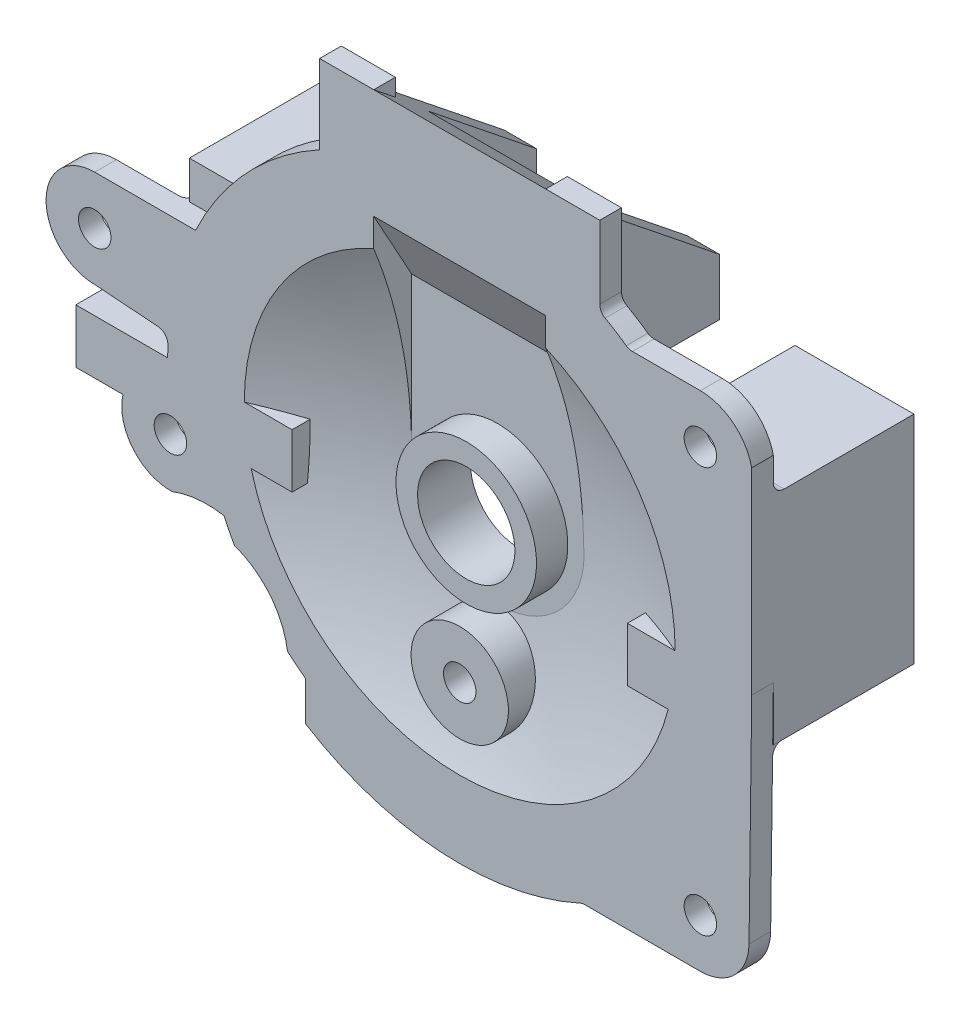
ISO-10303-21;
HEADER;
FILE_DESCRIPTION(('STEP AP214'),'2;1');
FILE_NAME('part.step','',(''),(''),'','','');
FILE_SCHEMA(('AUTOMOTIVE_DESIGN { 1 0 10303 214 1 1 1 1 }'));
ENDSEC;
DATA;
#1=APPLICATION_CONTEXT('core data for automotive mechanical design processes');
#2=APPLICATION_PROTOCOL_DEFINITION('international standard','automotive_design',2000,#1);
#3=PRODUCT_CONTEXT('',#1,'mechanical');
#4=PRODUCT('Part','Part','',(#3));
#5=PRODUCT_RELATED_PRODUCT_CATEGORY('part','',(#4));
#6=PRODUCT_DEFINITION_FORMATION('','',#4);
#7=PRODUCT_DEFINITION_CONTEXT('part definition',#1,'design');
#8=PRODUCT_DEFINITION('design','',#6,#7);
#9=PRODUCT_DEFINITION_SHAPE('','',#8);
#10=(LENGTH_UNIT() NAMED_UNIT(*) SI_UNIT(.MILLI.,.METRE.));
#11=(NAMED_UNIT(*) PLANE_ANGLE_UNIT() SI_UNIT($,.RADIAN.));
#12=(NAMED_UNIT(*) SI_UNIT($,.STERADIAN.) SOLID_ANGLE_UNIT());
#13=UNCERTAINTY_MEASURE_WITH_UNIT(LENGTH_MEASURE(1.E-05),#10,'distance_accuracy_value','');
#14=(GEOMETRIC_REPRESENTATION_CONTEXT(3) GLOBAL_UNCERTAINTY_ASSIGNED_CONTEXT((#13)) GLOBAL_UNIT_ASSIGNED_CONTEXT((#10,
#11,#12)) REPRESENTATION_CONTEXT('',''));
#15=CARTESIAN_POINT('',(0.,0.,0.));
#16=DIRECTION('',(0.,0.,1.));
#17=DIRECTION('',(1.,0.,0.));
#18=AXIS2_PLACEMENT_3D('',#15,#16,#17);
#19=CARTESIAN_POINT('',(0.,0.,-17.));
#20=DIRECTION('',(0.,0.,-1.));
#21=DIRECTION('',(-1.,0.,0.));
#22=AXIS2_PLACEMENT_3D('',#19,#20,#21);
#23=PLANE('',#22);
#24=CARTESIAN_POINT('',(85.25,8.,-17.));
#25=DIRECTION('',(0.,0.,-1.));
#26=DIRECTION('',(-1.,0.,0.));
#27=AXIS2_PLACEMENT_3D('',#24,#25,#26);
#28=CIRCLE('',#27,1.4);
#29=CARTESIAN_POINT('',(83.85,8.,-17.));
#30=VERTEX_POINT('',#29);
#31=EDGE_CURVE('E688',#30,#30,#28,.F.);
#32=ORIENTED_EDGE('',*,*,#31,.T.);
#33=EDGE_LOOP('',(#32));
#34=FACE_BOUND('',#33,.T.);
#35=DIRECTION('',(-1.,0.,0.));
#36=VECTOR('',#35,1.);
#37=CARTESIAN_POINT('',(68.25,-2.,-17.));
#38=LINE('',#37,#36);
#39=CARTESIAN_POINT('',(79.75,-2.,-17.));
#40=VERTEX_POINT('',#39);
#41=CARTESIAN_POINT('',(79.25,-2.,-17.));
#42=VERTEX_POINT('',#41);
#43=EDGE_CURVE('E671',#40,#42,#38,.T.);
#44=ORIENTED_EDGE('',*,*,#43,.F.);
#45=DIRECTION('',(0.,-1.,0.));
#46=VECTOR('',#45,1.);
#47=CARTESIAN_POINT('',(79.75,0.,-17.));
#48=LINE('',#47,#46);
#49=CARTESIAN_POINT('',(79.75,13.,-17.));
#50=VERTEX_POINT('',#49);
#51=EDGE_CURVE('E678',#50,#40,#48,.T.);
#52=ORIENTED_EDGE('',*,*,#51,.F.);
#53=DIRECTION('',(-1.,0.,0.));
#54=VECTOR('',#53,1.);
#55=CARTESIAN_POINT('',(0.,13.,-17.));
#56=LINE('',#55,#54);
#57=CARTESIAN_POINT('',(90.75,13.,-17.));
#58=VERTEX_POINT('',#57);
#59=EDGE_CURVE('E676',#58,#50,#56,.T.);
#60=ORIENTED_EDGE('',*,*,#59,.F.);
#61=DIRECTION('',(0.,-1.,0.));
#62=VECTOR('',#61,1.);
#63=CARTESIAN_POINT('',(90.75,-1.38396619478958E-13,-17.));
#64=LINE('',#63,#62);
#65=CARTESIAN_POINT('',(90.75,-7.,-17.));
#66=VERTEX_POINT('',#65);
#67=EDGE_CURVE('E589',#58,#66,#64,.T.);
#68=ORIENTED_EDGE('',*,*,#67,.T.);
#69=DIRECTION('',(1.,0.,0.));
#70=VECTOR('',#69,1.);
#71=CARTESIAN_POINT('',(74.13,-7.,-17.));
#72=LINE('',#71,#70);
#73=CARTESIAN_POINT('',(79.25,-7.,-17.));
#74=VERTEX_POINT('',#73);
#75=EDGE_CURVE('E581',#74,#66,#72,.T.);
#76=ORIENTED_EDGE('',*,*,#75,.F.);
#77=DIRECTION('',(0.,-1.,0.));
#78=VECTOR('',#77,1.);
#79=CARTESIAN_POINT('',(79.25,-7.,-17.));
#80=LINE('',#79,#78);
#81=EDGE_CURVE('E667',#42,#74,#80,.T.);
#82=ORIENTED_EDGE('',*,*,#81,.F.);
#83=EDGE_LOOP('',(#44,#52,#60,#68,#76,#82));
#84=FACE_BOUND('',#83,.T.);
#85=CARTESIAN_POINT('',(85.25,2.,-17.));
#86=DIRECTION('',(0.,0.,-1.));
#87=DIRECTION('',(-1.,0.,0.));
#88=AXIS2_PLACEMENT_3D('',#85,#86,#87);
#89=CIRCLE('',#88,1.4);
#90=CARTESIAN_POINT('',(83.85,2.,-17.));
#91=VERTEX_POINT('',#90);
#92=EDGE_CURVE('E691',#91,#91,#89,.F.);
#93=ORIENTED_EDGE('',*,*,#92,.T.);
#94=EDGE_LOOP('',(#93));
#95=FACE_BOUND('',#94,.T.);
#96=ADVANCED_FACE('F41',(#34,#84,#95),#23,.T.);
#97=CARTESIAN_POINT('',(37.,-8.,-17.));
#98=DIRECTION('',(0.,0.,-1.));
#99=DIRECTION('',(-1.,0.,0.));
#100=AXIS2_PLACEMENT_3D('',#97,#98,#99);
#101=CIRCLE('',#100,3.5);
#102=CARTESIAN_POINT('',(33.6458980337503,-7.,-17.));
#103=VERTEX_POINT('',#102);
#104=CARTESIAN_POINT('',(40.3541019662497,-7.,-17.));
#105=VERTEX_POINT('',#104);
#106=EDGE_CURVE('E663',#103,#105,#101,.T.);
#107=ORIENTED_EDGE('',*,*,#106,.F.);
#108=CARTESIAN_POINT('',(28.25,-7.,-17.));
#109=VERTEX_POINT('',#108);
#110=EDGE_CURVE('E582',#109,#103,#72,.T.);
#111=ORIENTED_EDGE('',*,*,#110,.F.);
#112=DIRECTION('',(0.,-1.,0.));
#113=VECTOR('',#112,1.);
#114=CARTESIAN_POINT('',(28.25,-7.,-17.));
#115=LINE('',#114,#113);
#116=CARTESIAN_POINT('',(28.25,-2.,-17.));
#117=VERTEX_POINT('',#116);
#118=EDGE_CURVE('E674',#117,#109,#115,.T.);
#119=ORIENTED_EDGE('',*,*,#118,.F.);
#120=CARTESIAN_POINT('',(36.75,-2.,-17.));
#121=VERTEX_POINT('',#120);
#122=EDGE_CURVE('E670',#121,#117,#38,.T.);
#123=ORIENTED_EDGE('',*,*,#122,.F.);
#124=DIRECTION('',(0.,1.,0.));
#125=VECTOR('',#124,1.);
#126=CARTESIAN_POINT('',(36.75,0.,-17.));
#127=LINE('',#126,#125);
#128=CARTESIAN_POINT('',(36.75,13.,-17.));
#129=VERTEX_POINT('',#128);
#130=EDGE_CURVE('E696',#121,#129,#127,.T.);
#131=ORIENTED_EDGE('',*,*,#130,.T.);
#132=DIRECTION('',(1.,0.,0.));
#133=VECTOR('',#132,1.);
#134=CARTESIAN_POINT('',(0.,13.,-17.));
#135=LINE('',#134,#133);
#136=CARTESIAN_POINT('',(47.75,13.,-17.));
#137=VERTEX_POINT('',#136);
#138=EDGE_CURVE('E694',#129,#137,#135,.T.);
#139=ORIENTED_EDGE('',*,*,#138,.T.);
#140=DIRECTION('',(0.,-1.,0.));
#141=VECTOR('',#140,1.);
#142=CARTESIAN_POINT('',(47.75,0.,-17.));
#143=LINE('',#142,#141);
#144=CARTESIAN_POINT('',(47.75,-2.,-17.));
#145=VERTEX_POINT('',#144);
#146=EDGE_CURVE('E592',#137,#145,#143,.T.);
#147=ORIENTED_EDGE('',*,*,#146,.T.);
#148=CARTESIAN_POINT('',(48.25,-2.,-17.));
#149=VERTEX_POINT('',#148);
#150=EDGE_CURVE('E588',#149,#145,#38,.T.);
#151=ORIENTED_EDGE('',*,*,#150,.F.);
#152=DIRECTION('',(0.,-1.,0.));
#153=VECTOR('',#152,1.);
#154=CARTESIAN_POINT('',(48.25,-7.,-17.));
#155=LINE('',#154,#153);
#156=CARTESIAN_POINT('',(48.25,-7.,-17.));
#157=VERTEX_POINT('',#156);
#158=EDGE_CURVE('E564',#149,#157,#155,.T.);
#159=ORIENTED_EDGE('',*,*,#158,.T.);
#160=EDGE_CURVE('E575',#105,#157,#72,.T.);
#161=ORIENTED_EDGE('',*,*,#160,.F.);
#162=EDGE_LOOP('',(#107,#111,#119,#123,#131,#139,#147,#151,#159,#161));
#163=FACE_BOUND('',#162,.T.);
#164=CARTESIAN_POINT('',(42.25,2.,-17.));
#165=DIRECTION('',(0.,0.,-1.));
#166=DIRECTION('',(-1.,0.,0.));
#167=AXIS2_PLACEMENT_3D('',#164,#165,#166);
#168=CIRCLE('',#167,1.4);
#169=CARTESIAN_POINT('',(40.85,2.,-17.));
#170=VERTEX_POINT('',#169);
#171=EDGE_CURVE('E681',#170,#170,#168,.T.);
#172=ORIENTED_EDGE('',*,*,#171,.F.);
#173=EDGE_LOOP('',(#172));
#174=FACE_BOUND('',#173,.T.);
#175=CARTESIAN_POINT('',(42.25,8.,-17.));
#176=DIRECTION('',(0.,0.,-1.));
#177=DIRECTION('',(-1.,0.,0.));
#178=AXIS2_PLACEMENT_3D('',#175,#176,#177);
#179=CIRCLE('',#178,1.4);
#180=CARTESIAN_POINT('',(40.85,8.,-17.));
#181=VERTEX_POINT('',#180);
#182=EDGE_CURVE('E684',#181,#181,#179,.T.);
#183=ORIENTED_EDGE('',*,*,#182,.F.);
#184=EDGE_LOOP('',(#183));
#185=FACE_BOUND('',#184,.T.);
#186=ADVANCED_FACE('F585',(#163,#174,#185),#23,.T.);
#187=CARTESIAN_POINT('',(63.75,-2.,43.7954545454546));
#188=DIRECTION('',(0.,0.,-1.));
#189=DIRECTION('',(1.,0.,0.));
#190=AXIS2_PLACEMENT_3D('',#187,#188,#189);
#191=SPHERICAL_SURFACE('',#190,49.9403828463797);
#192=CARTESIAN_POINT('',(62.8475690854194,-15.698172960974,-4.22107921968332));
#193=CARTESIAN_POINT('',(62.7792186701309,-15.6466879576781,-4.23448215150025));
#194=CARTESIAN_POINT('',(62.7154109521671,-15.589433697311,-4.24938136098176));
#195=CARTESIAN_POINT('',(62.598659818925,-15.4652471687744,-4.28168056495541));
#196=CARTESIAN_POINT('',(62.5457340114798,-15.3982995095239,-4.29908453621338));
#197=CARTESIAN_POINT('',(62.4522246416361,-15.2569313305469,-4.33581275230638));
#198=CARTESIAN_POINT('',(62.4116191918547,-15.1825243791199,-4.35513350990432));
#199=CARTESIAN_POINT('',(62.343583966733,-15.0282977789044,-4.3951544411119));
#200=CARTESIAN_POINT('',(62.3161506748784,-14.948479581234,-4.41585424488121));
#201=CARTESIAN_POINT('',(62.2745888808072,-14.7837820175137,-4.45853755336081));
#202=CARTESIAN_POINT('',(62.2607675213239,-14.698829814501,-4.48053931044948));
#203=CARTESIAN_POINT('',(62.2478099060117,-14.5278660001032,-4.52478633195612));
#204=CARTESIAN_POINT('',(62.2486760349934,-14.44185421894,-4.54703163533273));
#205=CARTESIAN_POINT('',(62.2652078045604,-14.269854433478,-4.59148562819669));
#206=CARTESIAN_POINT('',(62.2810956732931,-14.1838862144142,-4.6136887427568));
#207=CARTESIAN_POINT('',(62.3276338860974,-14.0157668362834,-4.65708036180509));
#208=CARTESIAN_POINT('',(62.3582842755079,-13.9336156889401,-4.67826886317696));
#209=CARTESIAN_POINT('',(62.4334010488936,-13.7760231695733,-4.71889044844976));
#210=CARTESIAN_POINT('',(62.4777870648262,-13.7005459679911,-4.73833291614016));
#211=CARTESIAN_POINT('',(62.5793208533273,-13.5581102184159,-4.77500376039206));
#212=CARTESIAN_POINT('',(62.636467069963,-13.4911506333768,-4.79223240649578));
#213=CARTESIAN_POINT('',(62.7604631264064,-13.3694331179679,-4.82353609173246));
#214=CARTESIAN_POINT('',(62.8270448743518,-13.3144192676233,-4.83767732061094));
#215=CARTESIAN_POINT('',(62.9690628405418,-13.2164207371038,-4.86285902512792));
#216=CARTESIAN_POINT('',(63.0444973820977,-13.1734337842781,-4.8739000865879));
#217=CARTESIAN_POINT('',(63.1995104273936,-13.1021413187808,-4.89220700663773));
#218=CARTESIAN_POINT('',(63.2788824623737,-13.0734145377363,-4.89958120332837));
#219=CARTESIAN_POINT('',(63.4415495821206,-13.0296433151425,-4.91081597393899));
#220=CARTESIAN_POINT('',(63.5248440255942,-13.0145966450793,-4.91467712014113));
#221=CARTESIAN_POINT('',(63.6907959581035,-12.9989098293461,-4.91870250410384));
#222=CARTESIAN_POINT('',(63.7734189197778,-12.9979252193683,-4.91895513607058));
#223=CARTESIAN_POINT('',(63.937641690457,-13.0095084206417,-4.91598282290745));
#224=CARTESIAN_POINT('',(64.0192415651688,-13.0220753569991,-4.91275810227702));
#225=CARTESIAN_POINT('',(64.1785446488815,-13.0602038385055,-4.90297218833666));
#226=CARTESIAN_POINT('',(64.2562704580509,-13.0856770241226,-4.89643368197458));
#227=CARTESIAN_POINT('',(64.4062872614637,-13.1487381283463,-4.88024217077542));
#228=CARTESIAN_POINT('',(64.47857801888,-13.1863265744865,-4.87058903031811));
#229=CARTESIAN_POINT('',(64.6167502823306,-13.2730182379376,-4.84831697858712));
#230=CARTESIAN_POINT('',(64.6825333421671,-13.3222684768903,-4.83566019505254));
#231=CARTESIAN_POINT('',(64.8049150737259,-13.4305001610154,-4.80783266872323));
#232=CARTESIAN_POINT('',(64.8615126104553,-13.4894828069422,-4.79266161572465));
#233=CARTESIAN_POINT('',(64.9655942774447,-13.6172188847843,-4.75978866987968));
#234=CARTESIAN_POINT('',(65.0127848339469,-13.686196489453,-4.74202863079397));
#235=CARTESIAN_POINT('',(65.0949504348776,-13.8306592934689,-4.70481042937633));
#236=CARTESIAN_POINT('',(65.1299235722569,-13.9061455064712,-4.68535200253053));
#237=CARTESIAN_POINT('',(65.1877503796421,-14.0639419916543,-4.64464986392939));
#238=CARTESIAN_POINT('',(65.2102028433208,-14.1463900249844,-4.62336984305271));
#239=CARTESIAN_POINT('',(65.2408192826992,-14.3137318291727,-4.58014891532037));
#240=CARTESIAN_POINT('',(65.2489813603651,-14.3986259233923,-4.55820792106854));
#241=CARTESIAN_POINT('',(65.2508585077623,-14.5703284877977,-4.51380056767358));
#242=CARTESIAN_POINT('',(65.2442697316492,-14.6571400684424,-4.49133276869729));
#243=CARTESIAN_POINT('',(65.2161669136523,-14.8284676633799,-4.4469608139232));
#244=CARTESIAN_POINT('',(65.1946521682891,-14.9129835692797,-4.42505668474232));
#245=CARTESIAN_POINT('',(65.1371422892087,-15.0774406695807,-4.38240632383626));
#246=CARTESIAN_POINT('',(65.1011208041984,-15.157373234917,-4.36166227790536));
#247=CARTESIAN_POINT('',(65.0154700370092,-15.3100913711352,-4.32200536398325));
#248=CARTESIAN_POINT('',(64.9658417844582,-15.3828774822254,-4.30309235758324));
#249=CARTESIAN_POINT('',(64.855310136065,-15.5177162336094,-4.26803716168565));
#250=CARTESIAN_POINT('',(64.7946356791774,-15.5799445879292,-4.25184965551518));
#251=CARTESIAN_POINT('',(64.6630446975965,-15.6932662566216,-4.22235882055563));
#252=CARTESIAN_POINT('',(64.5921300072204,-15.7443615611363,-4.20905497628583));
#253=CARTESIAN_POINT('',(64.4444440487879,-15.8322539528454,-4.18616295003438));
#254=CARTESIAN_POINT('',(64.3679248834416,-15.8694477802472,-4.17647169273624));
#255=CARTESIAN_POINT('',(64.2093885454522,-15.9304443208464,-4.16057525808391));
#256=CARTESIAN_POINT('',(64.1273726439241,-15.9542501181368,-4.15436927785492));
#257=CARTESIAN_POINT('',(63.9627531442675,-15.9871369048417,-4.14579527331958));
#258=CARTESIAN_POINT('',(63.8802368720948,-15.9966281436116,-4.14332032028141));
#259=CARTESIAN_POINT('',(63.7147191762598,-16.0018687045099,-4.14195383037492));
#260=CARTESIAN_POINT('',(63.6317176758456,-15.9976157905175,-4.1430628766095));
#261=CARTESIAN_POINT('',(63.4687536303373,-15.9756615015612,-4.14878712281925));
#262=CARTESIAN_POINT('',(63.3887656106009,-15.958135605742,-4.15335657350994));
#263=CARTESIAN_POINT('',(63.2330041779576,-15.9104375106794,-4.16578959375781));
#264=CARTESIAN_POINT('',(63.1572256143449,-15.8802811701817,-4.17364903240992));
#265=CARTESIAN_POINT('',(63.0428068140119,-15.8236530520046,-4.18840254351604));
#266=CARTESIAN_POINT('',(63.0020659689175,-15.8010588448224,-4.19428819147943));
#267=CARTESIAN_POINT('',(62.9229620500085,-15.7522651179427,-4.20699592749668));
#268=CARTESIAN_POINT('',(62.8845989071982,-15.7260657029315,-4.21381798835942));
#269=CARTESIAN_POINT('',(62.8475690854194,-15.698172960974,-4.22107921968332));
#270=B_SPLINE_CURVE_WITH_KNOTS('',3,(#192,#193,#194,#195,#196,#197,#198,#199,#200,#201,#202,
#203,#204,#205,#206,#207,#208,#209,#210,#211,#212,#213,#214,#215,#216,#217,#218,#219,#220,#221,
#222,#223,#224,#225,#226,#227,#228,#229,#230,#231,#232,#233,#234,#235,#236,#237,#238,#239,#240,
#241,#242,#243,#244,#245,#246,#247,#248,#249,#250,#251,#252,#253,#254,#255,#256,#257,#258,#259,
#260,#261,#262,#263,#264,#265,#266,#267,#268,#269),.UNSPECIFIED.,.T.,.F.,(4,2,2,2,2,2,2,2,2,2,2,
2,2,2,2,2,2,2,2,2,2,2,2,2,2,2,2,2,2,2,2,2,2,2,2,2,2,2,4),(0.,0.259666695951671,
0.519750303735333,0.77936912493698,1.03891859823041,1.30419889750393,1.56952227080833,
1.83883322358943,2.10814500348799,2.37590990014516,2.6436421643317,2.90489966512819,
3.16610776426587,3.41905601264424,3.67196304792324,3.91866393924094,4.16534890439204,
4.41036737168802,4.65539650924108,4.90369675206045,5.15202765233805,5.40719076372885,
5.66239368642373,5.92536290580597,6.18836704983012,6.45683842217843,6.7253224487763,
6.9942963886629,7.26324998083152,7.52715900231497,7.79102080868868,8.04664124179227,
8.30220276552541,8.55029072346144,8.79841904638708,9.04332297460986,9.28792031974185,
9.42860257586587,9.56928074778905),.UNSPECIFIED.);
#271=CARTESIAN_POINT('',(62.8475690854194,-15.698172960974,-4.22107921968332));
#272=VERTEX_POINT('',#271);
#273=EDGE_CURVE('E2680',#272,#272,#270,.T.);
#274=ORIENTED_EDGE('',*,*,#273,.F.);
#275=EDGE_LOOP('',(#274));
#276=FACE_BOUND('',#275,.T.);
#277=ADVANCED_FACE('F1164',(#276),#191,.F.);
#278=CARTESIAN_POINT('',(63.75,-14.5,-7.501));
#279=DIRECTION('',(0.,0.,1.));
#280=DIRECTION('',(1.,0.,0.));
#281=AXIS2_PLACEMENT_3D('',#278,#279,#280);
#282=CYLINDRICAL_SURFACE('',#281,1.5);
#283=CARTESIAN_POINT('',(63.75,-14.5,-2.));
#284=DIRECTION('',(0.,0.,-1.));
#285=DIRECTION('',(-1.,0.,0.));
#286=AXIS2_PLACEMENT_3D('',#283,#284,#285);
#287=CIRCLE('',#286,1.5);
#288=CARTESIAN_POINT('',(62.25,-14.5,-2.));
#289=VERTEX_POINT('',#288);
#290=EDGE_CURVE('E2700',#289,#289,#287,.F.);
#291=ORIENTED_EDGE('',*,*,#290,.T.);
#292=EDGE_LOOP('',(#291));
#293=FACE_BOUND('',#292,.T.);
#294=ORIENTED_EDGE('',*,*,#273,.T.);
#295=EDGE_LOOP('',(#294));
#296=FACE_BOUND('',#295,.T.);
#297=ADVANCED_FACE('F1166',(#293,#296),#282,.F.);
#298=CARTESIAN_POINT('',(73.7,29.,-2.));
#299=DIRECTION('',(0.,0.,-1.));
#300=DIRECTION('',(-1.,0.,0.));
#301=AXIS2_PLACEMENT_3D('',#298,#299,#300);
#302=PLANE('',#301);
#303=CARTESIAN_POINT('',(63.75,-14.5,-2.));
#304=DIRECTION('',(0.,0.,-1.));
#305=DIRECTION('',(-1.,0.,0.));
#306=AXIS2_PLACEMENT_3D('',#303,#304,#305);
#307=CIRCLE('',#306,4.49999999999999);
#308=CARTESIAN_POINT('',(59.25,-14.5,-2.));
#309=VERTEX_POINT('',#308);
#310=EDGE_CURVE('E1247',#309,#309,#307,.F.);
#311=ORIENTED_EDGE('',*,*,#310,.T.);
#312=EDGE_LOOP('',(#311));
#313=FACE_BOUND('',#312,.T.);
#314=ORIENTED_EDGE('',*,*,#290,.F.);
#315=EDGE_LOOP('',(#314));
#316=FACE_BOUND('',#315,.T.);
#317=ADVANCED_FACE('F1174',(#313,#316),#302,.F.);
#318=CARTESIAN_POINT('',(63.75,-2.,-7.5));
#319=DIRECTION('',(0.,0.,-1.));
#320=DIRECTION('',(-1.,0.,0.));
#321=AXIS2_PLACEMENT_3D('',#318,#319,#320);
#322=CYLINDRICAL_SURFACE('',#321,6.50000000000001);
#323=CARTESIAN_POINT('',(63.75,-2.,-5.5));
#324=DIRECTION('',(0.,0.,-1.));
#325=DIRECTION('',(-1.,0.,0.));
#326=AXIS2_PLACEMENT_3D('',#323,#324,#325);
#327=CIRCLE('',#326,6.50000000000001);
#328=CARTESIAN_POINT('',(57.25,-2.,-5.5));
#329=VERTEX_POINT('',#328);
#330=EDGE_CURVE('E1234',#329,#329,#327,.T.);
#331=ORIENTED_EDGE('',*,*,#330,.F.);
#332=EDGE_LOOP('',(#331));
#333=FACE_BOUND('',#332,.T.);
#334=CARTESIAN_POINT('',(63.75,-2.,-2.6));
#335=DIRECTION('',(0.,0.,-1.));
#336=DIRECTION('',(-1.,0.,0.));
#337=AXIS2_PLACEMENT_3D('',#334,#335,#336);
#338=CIRCLE('',#337,6.50000000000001);
#339=CARTESIAN_POINT('',(57.25,-2.,-2.6));
#340=VERTEX_POINT('',#339);
#341=EDGE_CURVE('E1237',#340,#340,#338,.T.);
#342=ORIENTED_EDGE('',*,*,#341,.T.);
#343=EDGE_LOOP('',(#342));
#344=FACE_BOUND('',#343,.T.);
#345=ADVANCED_FACE('F1462',(#333,#344),#322,.T.);
#346=CARTESIAN_POINT('',(0.,-2.,-2.6));
#347=DIRECTION('',(0.,0.,1.));
#348=DIRECTION('',(1.,0.,0.));
#349=AXIS2_PLACEMENT_3D('',#346,#347,#348);
#350=PLANE('',#349);
#351=ORIENTED_EDGE('',*,*,#341,.F.);
#352=EDGE_LOOP('',(#351));
#353=FACE_BOUND('',#352,.T.);
#354=CARTESIAN_POINT('',(63.75,-2.,-2.6));
#355=DIRECTION('',(0.,0.,-1.));
#356=DIRECTION('',(-1.,0.,0.));
#357=AXIS2_PLACEMENT_3D('',#354,#355,#356);
#358=CIRCLE('',#357,4.5);
#359=CARTESIAN_POINT('',(59.25,-2.,-2.6));
#360=VERTEX_POINT('',#359);
#361=EDGE_CURVE('E1072',#360,#360,#358,.T.);
#362=ORIENTED_EDGE('',*,*,#361,.T.);
#363=EDGE_LOOP('',(#362));
#364=FACE_BOUND('',#363,.T.);
#365=ADVANCED_FACE('F1454',(#353,#364),#350,.T.);
#366=CARTESIAN_POINT('',(95.3722749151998,15.5,0.));
#367=DIRECTION('',(0.,1.,0.));
#368=DIRECTION('',(0.,0.,1.));
#369=AXIS2_PLACEMENT_3D('',#366,#367,#368);
#370=PLANE('',#369);
#371=DIRECTION('',(0.,0.,-1.));
#372=VECTOR('',#371,1.);
#373=CARTESIAN_POINT('',(56.8,15.5,0.));
#374=LINE('',#373,#372);
#375=CARTESIAN_POINT('',(56.8,15.5,-6.));
#376=VERTEX_POINT('',#375);
#377=CARTESIAN_POINT('',(56.8,15.5,-16.0512454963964));
#378=VERTEX_POINT('',#377);
#379=EDGE_CURVE('E901',#376,#378,#374,.T.);
#380=ORIENTED_EDGE('',*,*,#379,.F.);
#381=DIRECTION('',(-1.,0.,0.));
#382=VECTOR('',#381,1.);
#383=CARTESIAN_POINT('',(0.,15.5,-6.));
#384=LINE('',#383,#382);
#385=CARTESIAN_POINT('',(70.7,15.5,-6.));
#386=VERTEX_POINT('',#385);
#387=EDGE_CURVE('E899',#386,#376,#384,.T.);
#388=ORIENTED_EDGE('',*,*,#387,.F.);
#389=DIRECTION('',(0.,0.,1.));
#390=VECTOR('',#389,1.);
#391=CARTESIAN_POINT('',(70.7,15.5,0.));
#392=LINE('',#391,#390);
#393=CARTESIAN_POINT('',(70.7,15.5,-16.0512454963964));
#394=VERTEX_POINT('',#393);
#395=EDGE_CURVE('E914',#394,#386,#392,.T.);
#396=ORIENTED_EDGE('',*,*,#395,.F.);
#397=DIRECTION('',(1.,0.,0.));
#398=VECTOR('',#397,1.);
#399=CARTESIAN_POINT('',(0.,15.5,-16.0512454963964));
#400=LINE('',#399,#398);
#401=EDGE_CURVE('E916',#378,#394,#400,.T.);
#402=ORIENTED_EDGE('',*,*,#401,.F.);
#403=EDGE_LOOP('',(#380,#388,#396,#402));
#404=FACE_BOUND('',#403,.T.);
#405=ADVANCED_FACE('F1451',(#404),#370,.T.);
#406=CARTESIAN_POINT('',(63.75,-14.5,13.75));
#407=DIRECTION('',(0.,0.,-1.));
#408=DIRECTION('',(-1.,0.,0.));
#409=AXIS2_PLACEMENT_3D('',#406,#407,#408);
#410=CYLINDRICAL_SURFACE('',#409,4.49999999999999);
#411=ORIENTED_EDGE('',*,*,#310,.F.);
#412=EDGE_LOOP('',(#411));
#413=FACE_BOUND('',#412,.T.);
#414=CARTESIAN_POINT('',(60.4917705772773,-17.603859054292,-3.53260650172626));
#415=CARTESIAN_POINT('',(60.4023755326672,-17.5100198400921,-3.55739074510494));
#416=CARTESIAN_POINT('',(60.3171731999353,-17.4124569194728,-3.58313897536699));
#417=CARTESIAN_POINT('',(60.1556571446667,-17.2106104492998,-3.63636268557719));
#418=CARTESIAN_POINT('',(60.0793465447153,-17.1063245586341,-3.66383876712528));
#419=CARTESIAN_POINT('',(59.9360441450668,-16.8917374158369,-3.72032390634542));
#420=CARTESIAN_POINT('',(59.8690639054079,-16.7814289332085,-3.74933480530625));
#421=CARTESIAN_POINT('',(59.7449157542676,-16.5556995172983,-3.80864434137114));
#422=CARTESIAN_POINT('',(59.6877515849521,-16.4402766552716,-3.83894346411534));
#423=CARTESIAN_POINT('',(59.5837083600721,-16.2054233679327,-3.90053270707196));
#424=CARTESIAN_POINT('',(59.5368090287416,-16.0860013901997,-3.9318207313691));
#425=CARTESIAN_POINT('',(59.4534086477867,-15.8437775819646,-3.99521826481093));
#426=CARTESIAN_POINT('',(59.4169114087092,-15.7209745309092,-4.02732807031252));
#427=CARTESIAN_POINT('',(59.3234285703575,-15.34893749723,-4.12450553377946));
#428=CARTESIAN_POINT('',(59.2823121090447,-15.0957587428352,-4.19050436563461));
#429=CARTESIAN_POINT('',(59.2432306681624,-14.5818407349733,-4.32419191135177));
#430=CARTESIAN_POINT('',(59.2460432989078,-14.3210470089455,-4.39188984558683));
#431=CARTESIAN_POINT('',(59.2966424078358,-13.8034413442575,-4.52597236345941));
#432=CARTESIAN_POINT('',(59.3444341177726,-13.5466298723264,-4.59235679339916));
#433=CARTESIAN_POINT('',(59.4842398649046,-13.0433688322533,-4.72219020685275));
#434=CARTESIAN_POINT('',(59.5764294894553,-12.7969646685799,-4.78562642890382));
#435=CARTESIAN_POINT('',(59.8029212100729,-12.3229509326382,-4.90743836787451));
#436=CARTESIAN_POINT('',(59.9372204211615,-12.0953400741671,-4.96581443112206));
#437=CARTESIAN_POINT('',(60.2419518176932,-11.6696336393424,-5.07482194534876));
#438=CARTESIAN_POINT('',(60.4117427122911,-11.4711084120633,-5.12556651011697));
#439=CARTESIAN_POINT('',(60.7842669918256,-11.1055197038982,-5.21889058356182));
#440=CARTESIAN_POINT('',(60.9869948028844,-10.9384509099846,-5.26147147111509));
#441=CARTESIAN_POINT('',(61.4132113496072,-10.6458790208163,-5.33596324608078));
#442=CARTESIAN_POINT('',(61.6359054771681,-10.5192895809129,-5.36815326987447));
#443=CARTESIAN_POINT('',(62.1005541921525,-10.3053961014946,-5.42250639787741));
#444=CARTESIAN_POINT('',(62.3425052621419,-10.2180849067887,-5.4446713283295));
#445=CARTESIAN_POINT('',(62.8311963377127,-10.0877566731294,-5.47774495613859));
#446=CARTESIAN_POINT('',(63.0775915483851,-10.0435234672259,-5.48896273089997));
#447=CARTESIAN_POINT('',(63.5745468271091,-9.99650272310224,-5.50088718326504));
#448=CARTESIAN_POINT('',(63.825106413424,-9.99371042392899,-5.50159506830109));
#449=CARTESIAN_POINT('',(64.3190488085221,-10.0293703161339,-5.49255210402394));
#450=CARTESIAN_POINT('',(64.5624823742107,-10.0671669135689,-5.48296749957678));
#451=CARTESIAN_POINT('',(65.0393763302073,-10.1817080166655,-5.4539043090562));
#452=CARTESIAN_POINT('',(65.2728368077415,-10.2584521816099,-5.43442580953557));
#453=CARTESIAN_POINT('',(65.7241631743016,-10.4487200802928,-5.38609097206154));
#454=CARTESIAN_POINT('',(65.9419715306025,-10.5623717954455,-5.35720200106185));
#455=CARTESIAN_POINT('',(66.3553448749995,-10.8227903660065,-5.29093026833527));
#456=CARTESIAN_POINT('',(66.5509079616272,-10.9695600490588,-5.25354678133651));
#457=CARTESIAN_POINT('',(66.9187315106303,-11.2952019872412,-5.17048816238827));
#458=CARTESIAN_POINT('',(67.0904168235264,-11.4746833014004,-5.12465548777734));
#459=CARTESIAN_POINT('',(67.4013419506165,-11.8582796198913,-5.02654103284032));
#460=CARTESIAN_POINT('',(67.5405771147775,-12.0623981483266,-4.9742583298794));
#461=CARTESIAN_POINT('',(67.7870822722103,-12.4960027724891,-4.86299745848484));
#462=CARTESIAN_POINT('',(67.8932663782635,-12.7260667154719,-4.80386533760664));
#463=CARTESIAN_POINT('',(68.0654514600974,-13.1998330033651,-4.68185699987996));
#464=CARTESIAN_POINT('',(68.1314463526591,-13.4435374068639,-4.61898021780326));
#465=CARTESIAN_POINT('',(68.2230698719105,-13.9447589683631,-4.48939993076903));
#466=CARTESIAN_POINT('',(68.2475504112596,-14.2024715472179,-4.42263884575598));
#467=CARTESIAN_POINT('',(68.2521000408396,-14.7182079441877,-4.28875411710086));
#468=CARTESIAN_POINT('',(68.2321645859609,-14.9762317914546,-4.22163043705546));
#469=CARTESIAN_POINT('',(68.1478045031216,-15.4887459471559,-4.08802600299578));
#470=CARTESIAN_POINT('',(68.0828097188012,-15.7431478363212,-4.02156468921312));
#471=CARTESIAN_POINT('',(67.9092541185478,-16.2375990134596,-3.89213350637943));
#472=CARTESIAN_POINT('',(67.8006936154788,-16.4776484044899,-3.82916361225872));
#473=CARTESIAN_POINT('',(67.5436989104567,-16.9343251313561,-3.70914824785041));
#474=CARTESIAN_POINT('',(67.3955947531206,-17.1511264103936,-3.6520589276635));
#475=CARTESIAN_POINT('',(67.0628891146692,-17.556719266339,-3.54508540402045));
#476=CARTESIAN_POINT('',(66.878292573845,-17.7455146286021,-3.49520022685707));
#477=CARTESIAN_POINT('',(66.4830032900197,-18.0842188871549,-3.40558704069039));
#478=CARTESIAN_POINT('',(66.2731383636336,-18.2350310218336,-3.36562351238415));
#479=CARTESIAN_POINT('',(65.8294613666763,-18.4990542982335,-3.29559251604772));
#480=CARTESIAN_POINT('',(65.5956541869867,-18.6122730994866,-3.26552303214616));
#481=CARTESIAN_POINT('',(65.119097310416,-18.7940010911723,-3.21722862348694));
#482=CARTESIAN_POINT('',(64.8769022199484,-18.8638698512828,-3.19864360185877));
#483=CARTESIAN_POINT('',(64.383695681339,-18.962244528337,-3.17246961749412));
#484=CARTESIAN_POINT('',(64.1326860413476,-18.9907588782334,-3.16487841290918));
#485=CARTESIAN_POINT('',(63.6353570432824,-19.0052506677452,-3.16102077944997));
#486=CARTESIAN_POINT('',(63.3890681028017,-18.9922235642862,-3.1644893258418));
#487=CARTESIAN_POINT('',(62.9022281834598,-18.9262424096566,-3.18204915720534));
#488=CARTESIAN_POINT('',(62.6616784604,-18.8732797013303,-3.19614274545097));
#489=CARTESIAN_POINT('',(62.1937700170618,-18.7294144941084,-3.23439595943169));
#490=CARTESIAN_POINT('',(61.9663797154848,-18.6386075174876,-3.25853024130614));
#491=CARTESIAN_POINT('',(61.5304129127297,-18.4220581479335,-3.31602180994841));
#492=CARTESIAN_POINT('',(61.3218146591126,-18.2963568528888,-3.34936824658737));
#493=CARTESIAN_POINT('',(61.0110410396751,-18.0732277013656,-3.40848192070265));
#494=CARTESIAN_POINT('',(60.900867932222,-17.9859896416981,-3.43157893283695));
#495=CARTESIAN_POINT('',(60.689428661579,-17.8018970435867,-3.48027924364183));
#496=CARTESIAN_POINT('',(60.5881622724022,-17.7050427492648,-3.50588247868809));
#497=CARTESIAN_POINT('',(60.4917705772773,-17.603859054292,-3.53260650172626));
#498=B_SPLINE_CURVE_WITH_KNOTS('',3,(#414,#415,#416,#417,#418,#419,#420,#421,#422,#423,#424,
#425,#426,#427,#428,#429,#430,#431,#432,#433,#434,#435,#436,#437,#438,#439,#440,#441,#442,#443,
#444,#445,#446,#447,#448,#449,#450,#451,#452,#453,#454,#455,#456,#457,#458,#459,#460,#461,#462,
#463,#464,#465,#466,#467,#468,#469,#470,#471,#472,#473,#474,#475,#476,#477,#478,#479,#480,#481,
#482,#483,#484,#485,#486,#487,#488,#489,#490,#491,#492,#493,#494,#495,#496,#497),.UNSPECIFIED.,
.T.,.F.,(4,2,2,2,2,2,2,2,2,2,2,2,2,2,2,2,2,2,2,2,2,2,2,2,2,2,2,2,2,2,2,2,2,2,2,2,2,2,2,2,2,4),
(0.,0.395718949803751,0.791576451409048,1.18792012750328,1.58441456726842,1.98011861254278,
2.37596742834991,3.1666095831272,3.97126290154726,4.77600982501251,5.5839658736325,
6.3918665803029,7.18626708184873,7.98053328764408,8.75122953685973,9.52178533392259,
10.26989549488,11.0179197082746,11.7540410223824,12.4901558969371,13.2288510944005,
13.9676093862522,14.7218710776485,15.4762407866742,16.2532719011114,17.0304206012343,
17.828730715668,18.6271225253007,19.4358056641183,20.2444829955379,21.0466111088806,
21.8486307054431,22.6292486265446,23.4097074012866,24.1642548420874,24.918648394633,
25.6551014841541,26.3917142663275,27.1264789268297,27.8603818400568,28.2870832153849,
28.7137737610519),.UNSPECIFIED.);
#499=CARTESIAN_POINT('',(63.7500000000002,-9.99999999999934,-5.50000000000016));
#500=VERTEX_POINT('',#499);
#501=EDGE_CURVE('E1196',#500,#500,#498,.T.);
#502=ORIENTED_EDGE('',*,*,#501,.F.);
#503=EDGE_LOOP('',(#502));
#504=FACE_BOUND('',#503,.T.);
#505=ADVANCED_FACE('F1453',(#413,#504),#410,.T.);
#506=CARTESIAN_POINT('',(0.,-2.,-5.5));
#507=DIRECTION('',(0.,0.,1.));
#508=DIRECTION('',(1.,0.,0.));
#509=AXIS2_PLACEMENT_3D('',#506,#507,#508);
#510=PLANE('',#509);
#511=ORIENTED_EDGE('',*,*,#330,.T.);
#512=EDGE_LOOP('',(#511));
#513=FACE_BOUND('',#512,.T.);
#514=DIRECTION('',(0.,-1.,0.));
#515=VECTOR('',#514,1.);
#516=CARTESIAN_POINT('',(55.8,0.,-5.5));
#517=LINE('',#516,#515);
#518=CARTESIAN_POINT('',(55.8,12.5,-5.5));
#519=VERTEX_POINT('',#518);
#520=CARTESIAN_POINT('',(55.8,-1.10697144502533,-5.5));
#521=VERTEX_POINT('',#520);
#522=EDGE_CURVE('E1059',#519,#521,#517,.T.);
#523=ORIENTED_EDGE('',*,*,#522,.T.);
#524=CARTESIAN_POINT('',(63.75,-2.,-5.5));
#525=DIRECTION('',(0.,0.,-1.));
#526=DIRECTION('',(-1.,0.,0.));
#527=AXIS2_PLACEMENT_3D('',#524,#525,#526);
#528=CIRCLE('',#527,8.00000000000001);
#529=EDGE_CURVE('E666',#500,#521,#528,.T.);
#530=ORIENTED_EDGE('',*,*,#529,.F.);
#531=CARTESIAN_POINT('',(71.7,-1.10697144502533,-5.5));
#532=VERTEX_POINT('',#531);
#533=EDGE_CURVE('E1198',#532,#500,#528,.T.);
#534=ORIENTED_EDGE('',*,*,#533,.F.);
#535=DIRECTION('',(0.,1.,0.));
#536=VECTOR('',#535,1.);
#537=CARTESIAN_POINT('',(71.7,0.,-5.5));
#538=LINE('',#537,#536);
#539=CARTESIAN_POINT('',(71.7,12.5,-5.5));
#540=VERTEX_POINT('',#539);
#541=EDGE_CURVE('E1062',#532,#540,#538,.T.);
#542=ORIENTED_EDGE('',*,*,#541,.T.);
#543=DIRECTION('',(-1.,0.,0.));
#544=VECTOR('',#543,1.);
#545=CARTESIAN_POINT('',(0.,12.5,-5.5));
#546=LINE('',#545,#544);
#547=EDGE_CURVE('E1065',#540,#519,#546,.T.);
#548=ORIENTED_EDGE('',*,*,#547,.T.);
#549=EDGE_LOOP('',(#523,#530,#534,#542,#548));
#550=FACE_BOUND('',#549,.T.);
#551=ADVANCED_FACE('F1204',(#513,#550),#510,.T.);
#552=CARTESIAN_POINT('',(70.7,-4.65335349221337,0.));
#553=DIRECTION('',(1.,0.,0.));
#554=DIRECTION('',(0.,0.,-1.));
#555=AXIS2_PLACEMENT_3D('',#552,#553,#554);
#556=PLANE('',#555);
#557=DIRECTION('',(0.,1.,0.));
#558=VECTOR('',#557,1.);
#559=CARTESIAN_POINT('',(70.7,-4.65335349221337,-16.0512454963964));
#560=LINE('',#559,#558);
#561=CARTESIAN_POINT('',(70.7,17.75,-16.0512454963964));
#562=VERTEX_POINT('',#561);
#563=EDGE_CURVE('E909',#394,#562,#560,.T.);
#564=ORIENTED_EDGE('',*,*,#563,.F.);
#565=ORIENTED_EDGE('',*,*,#395,.T.);
#566=DIRECTION('',(0.,1.,0.));
#567=VECTOR('',#566,1.);
#568=CARTESIAN_POINT('',(70.7,-4.65335349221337,-6.));
#569=LINE('',#568,#567);
#570=CARTESIAN_POINT('',(70.7,25.7974369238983,-6.));
#571=VERTEX_POINT('',#570);
#572=EDGE_CURVE('E906',#386,#571,#569,.T.);
#573=ORIENTED_EDGE('',*,*,#572,.T.);
#574=DIRECTION('',(0.,0.625,0.7806247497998));
#575=VECTOR('',#574,1.);
#576=CARTESIAN_POINT('',(70.7,18.6476559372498,-14.9300735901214));
#577=LINE('',#576,#575);
#578=EDGE_CURVE('E896',#562,#571,#577,.T.);
#579=ORIENTED_EDGE('',*,*,#578,.F.);
#580=EDGE_LOOP('',(#564,#565,#573,#579));
#581=FACE_BOUND('',#580,.T.);
#582=ADVANCED_FACE('F1443',(#581),#556,.F.);
#583=CARTESIAN_POINT('',(56.8,-4.65335349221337,0.));
#584=DIRECTION('',(-1.,0.,0.));
#585=DIRECTION('',(0.,0.,1.));
#586=AXIS2_PLACEMENT_3D('',#583,#584,#585);
#587=PLANE('',#586);
#588=DIRECTION('',(0.,1.,0.));
#589=VECTOR('',#588,1.);
#590=CARTESIAN_POINT('',(56.8,-4.65335349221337,-6.));
#591=LINE('',#590,#589);
#592=CARTESIAN_POINT('',(56.8,25.7974369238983,-6.));
#593=VERTEX_POINT('',#592);
#594=EDGE_CURVE('E902',#376,#593,#591,.T.);
#595=ORIENTED_EDGE('',*,*,#594,.F.);
#596=ORIENTED_EDGE('',*,*,#379,.T.);
#597=DIRECTION('',(0.,1.,0.));
#598=VECTOR('',#597,1.);
#599=CARTESIAN_POINT('',(56.8,-4.65335349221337,-16.0512454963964));
#600=LINE('',#599,#598);
#601=CARTESIAN_POINT('',(56.8,17.75,-16.0512454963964));
#602=VERTEX_POINT('',#601);
#603=EDGE_CURVE('E912',#378,#602,#600,.T.);
#604=ORIENTED_EDGE('',*,*,#603,.T.);
#605=DIRECTION('',(0.,-0.625,-0.7806247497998));
#606=VECTOR('',#605,1.);
#607=CARTESIAN_POINT('',(56.8,18.6476559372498,-14.9300735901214));
#608=LINE('',#607,#606);
#609=EDGE_CURVE('E868',#593,#602,#608,.T.);
#610=ORIENTED_EDGE('',*,*,#609,.F.);
#611=EDGE_LOOP('',(#595,#596,#604,#610));
#612=FACE_BOUND('',#611,.T.);
#613=ADVANCED_FACE('F1439',(#612),#587,.F.);
#614=CARTESIAN_POINT('',(0.,-4.65335349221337,-6.));
#615=DIRECTION('',(0.,0.,1.));
#616=DIRECTION('',(1.,0.,0.));
#617=AXIS2_PLACEMENT_3D('',#614,#615,#616);
#618=PLANE('',#617);
#619=ORIENTED_EDGE('',*,*,#572,.F.);
#620=ORIENTED_EDGE('',*,*,#387,.T.);
#621=ORIENTED_EDGE('',*,*,#594,.T.);
#622=DIRECTION('',(-1.,0.,0.));
#623=VECTOR('',#622,1.);
#624=CARTESIAN_POINT('',(95.3722749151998,25.7974369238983,-6.));
#625=LINE('',#624,#623);
#626=EDGE_CURVE('E956',#571,#593,#625,.T.);
#627=ORIENTED_EDGE('',*,*,#626,.F.);
#628=EDGE_LOOP('',(#619,#620,#621,#627));
#629=FACE_BOUND('',#628,.T.);
#630=ADVANCED_FACE('F1442',(#629),#618,.F.);
#631=CARTESIAN_POINT('',(63.75,-2.,-7.5));
#632=DIRECTION('',(0.,0.,-1.));
#633=DIRECTION('',(-1.,0.,0.));
#634=AXIS2_PLACEMENT_3D('',#631,#632,#633);
#635=CYLINDRICAL_SURFACE('',#634,4.5);
#636=ORIENTED_EDGE('',*,*,#361,.F.);
#637=EDGE_LOOP('',(#636));
#638=FACE_BOUND('',#637,.T.);
#639=CARTESIAN_POINT('',(63.75,-2.,-7.5));
#640=DIRECTION('',(0.,0.,-1.));
#641=DIRECTION('',(-1.,0.,0.));
#642=AXIS2_PLACEMENT_3D('',#639,#640,#641);
#643=CIRCLE('',#642,4.5);
#644=CARTESIAN_POINT('',(59.25,-2.,-7.5));
#645=VERTEX_POINT('',#644);
#646=EDGE_CURVE('E986',#645,#645,#643,.T.);
#647=ORIENTED_EDGE('',*,*,#646,.T.);
#648=EDGE_LOOP('',(#647));
#649=FACE_BOUND('',#648,.T.);
#650=ADVANCED_FACE('F1447',(#638,#649),#635,.F.);
#651=CARTESIAN_POINT('',(95.3722749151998,12.5,0.));
#652=DIRECTION('',(0.,1.,0.));
#653=DIRECTION('',(0.,0.,1.));
#654=AXIS2_PLACEMENT_3D('',#651,#652,#653);
#655=PLANE('',#654);
#656=DIRECTION('',(-1.,0.,0.));
#657=VECTOR('',#656,1.);
#658=CARTESIAN_POINT('',(95.3722749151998,12.5,-16.0512454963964));
#659=LINE('',#658,#657);
#660=CARTESIAN_POINT('',(73.7,12.5,-16.0512454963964));
#661=VERTEX_POINT('',#660);
#662=CARTESIAN_POINT('',(53.8,12.5,-16.0512454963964));
#663=VERTEX_POINT('',#662);
#664=EDGE_CURVE('E1008',#661,#663,#659,.T.);
#665=ORIENTED_EDGE('',*,*,#664,.F.);
#666=DIRECTION('',(0.,0.,1.));
#667=VECTOR('',#666,1.);
#668=CARTESIAN_POINT('',(73.7,12.5,0.));
#669=LINE('',#668,#667);
#670=CARTESIAN_POINT('',(73.7,12.5,-7.5));
#671=VERTEX_POINT('',#670);
#672=EDGE_CURVE('E991',#661,#671,#669,.T.);
#673=ORIENTED_EDGE('',*,*,#672,.T.);
#674=DIRECTION('',(-1.,0.,0.));
#675=VECTOR('',#674,1.);
#676=CARTESIAN_POINT('',(92.5,12.5,-7.5));
#677=LINE('',#676,#675);
#678=CARTESIAN_POINT('',(53.8,12.5,-7.5));
#679=VERTEX_POINT('',#678);
#680=EDGE_CURVE('E992',#671,#679,#677,.T.);
#681=ORIENTED_EDGE('',*,*,#680,.T.);
#682=DIRECTION('',(0.,0.,1.));
#683=VECTOR('',#682,1.);
#684=CARTESIAN_POINT('',(53.8,12.5,0.));
#685=LINE('',#684,#683);
#686=EDGE_CURVE('E1001',#663,#679,#685,.T.);
#687=ORIENTED_EDGE('',*,*,#686,.F.);
#688=EDGE_LOOP('',(#665,#673,#681,#687));
#689=FACE_BOUND('',#688,.T.);
#690=ADVANCED_FACE('F1675',(#689),#655,.F.);
#691=CARTESIAN_POINT('',(95.3722749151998,0.,-16.0512454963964));
#692=DIRECTION('',(0.,0.,1.));
#693=DIRECTION('',(1.,0.,0.));
#694=AXIS2_PLACEMENT_3D('',#691,#692,#693);
#695=PLANE('',#694);
#696=DIRECTION('',(-1.,0.,0.));
#697=VECTOR('',#696,1.);
#698=CARTESIAN_POINT('',(95.3722749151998,17.75,-16.0512454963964));
#699=LINE('',#698,#697);
#700=CARTESIAN_POINT('',(53.8,17.75,-16.0512454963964));
#701=VERTEX_POINT('',#700);
#702=EDGE_CURVE('E1015',#602,#701,#699,.T.);
#703=ORIENTED_EDGE('',*,*,#702,.F.);
#704=ORIENTED_EDGE('',*,*,#603,.F.);
#705=ORIENTED_EDGE('',*,*,#401,.T.);
#706=ORIENTED_EDGE('',*,*,#563,.T.);
#707=CARTESIAN_POINT('',(73.7,17.75,-16.0512454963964));
#708=VERTEX_POINT('',#707);
#709=EDGE_CURVE('E1004',#708,#562,#699,.T.);
#710=ORIENTED_EDGE('',*,*,#709,.F.);
#711=DIRECTION('',(0.,-1.,0.));
#712=VECTOR('',#711,1.);
#713=CARTESIAN_POINT('',(73.7,0.,-16.0512454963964));
#714=LINE('',#713,#712);
#715=EDGE_CURVE('E1007',#708,#661,#714,.T.);
#716=ORIENTED_EDGE('',*,*,#715,.T.);
#717=ORIENTED_EDGE('',*,*,#664,.T.);
#718=DIRECTION('',(0.,-1.,0.));
#719=VECTOR('',#718,1.);
#720=CARTESIAN_POINT('',(53.8,0.,-16.0512454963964));
#721=LINE('',#720,#719);
#722=EDGE_CURVE('E968',#701,#663,#721,.T.);
#723=ORIENTED_EDGE('',*,*,#722,.F.);
#724=EDGE_LOOP('',(#703,#704,#705,#706,#710,#716,#717,#723));
#725=FACE_BOUND('',#724,.T.);
#726=ADVANCED_FACE('F1475',(#725),#695,.F.);
#727=CARTESIAN_POINT('',(55.8,0.,-4.));
#728=DIRECTION('',(1.,0.,0.));
#729=DIRECTION('',(0.,0.,-1.));
#730=AXIS2_PLACEMENT_3D('',#727,#728,#729);
#731=PLANE('',#730);
#732=DIRECTION('',(0.,0.625,0.7806247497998));
#733=VECTOR('',#732,1.);
#734=CARTESIAN_POINT('',(55.8,18.6476559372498,-14.9300735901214));
#735=LINE('',#734,#733);
#736=CARTESIAN_POINT('',(55.8,27.3987184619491,-4.));
#737=VERTEX_POINT('',#736);
#738=CARTESIAN_POINT('',(55.8,29.,-2.));
#739=VERTEX_POINT('',#738);
#740=EDGE_CURVE('E965',#737,#739,#735,.T.);
#741=ORIENTED_EDGE('',*,*,#740,.F.);
#742=DIRECTION('',(0.,1.,0.));
#743=VECTOR('',#742,1.);
#744=CARTESIAN_POINT('',(55.8,0.,-4.));
#745=LINE('',#744,#743);
#746=CARTESIAN_POINT('',(55.8,29.,-4.));
#747=VERTEX_POINT('',#746);
#748=EDGE_CURVE('E662',#737,#747,#745,.T.);
#749=ORIENTED_EDGE('',*,*,#748,.T.);
#750=DIRECTION('',(0.,0.,1.));
#751=VECTOR('',#750,1.);
#752=CARTESIAN_POINT('',(55.8,29.,-4.));
#753=LINE('',#752,#751);
#754=EDGE_CURVE('E799',#747,#739,#753,.T.);
#755=ORIENTED_EDGE('',*,*,#754,.T.);
#756=EDGE_LOOP('',(#741,#749,#755));
#757=FACE_BOUND('',#756,.T.);
#758=ADVANCED_FACE('F1488',(#757),#731,.T.);
#759=CARTESIAN_POINT('',(0.,0.,-4.));
#760=DIRECTION('',(0.,0.,1.));
#761=DIRECTION('',(1.,0.,0.));
#762=AXIS2_PLACEMENT_3D('',#759,#760,#761);
#763=PLANE('',#762);
#764=DIRECTION('',(1.,0.,0.));
#765=VECTOR('',#764,1.);
#766=CARTESIAN_POINT('',(0.,9.5,-4.));
#767=LINE('',#766,#765);
#768=CARTESIAN_POINT('',(30.,9.5,-4.));
#769=VERTEX_POINT('',#768);
#770=CARTESIAN_POINT('',(35.75,9.5,-4.));
#771=VERTEX_POINT('',#770);
#772=EDGE_CURVE('E805',#769,#771,#767,.T.);
#773=ORIENTED_EDGE('',*,*,#772,.T.);
#774=DIRECTION('',(0.,-1.,0.));
#775=VECTOR('',#774,1.);
#776=CARTESIAN_POINT('',(35.75,-0.729002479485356,-4.));
#777=LINE('',#776,#775);
#778=CARTESIAN_POINT('',(35.75,0.0740740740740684,-4.));
#779=VERTEX_POINT('',#778);
#780=EDGE_CURVE('E942',#771,#779,#777,.T.);
#781=ORIENTED_EDGE('',*,*,#780,.T.);
#782=DIRECTION('',(0.997267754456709,-0.0738716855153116,0.));
#783=VECTOR('',#782,1.);
#784=CARTESIAN_POINT('',(0.200545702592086,2.70736698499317,-4.));
#785=LINE('',#784,#783);
#786=CARTESIAN_POINT('',(30.,0.499999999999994,-4.));
#787=VERTEX_POINT('',#786);
#788=EDGE_CURVE('E792',#787,#779,#785,.T.);
#789=ORIENTED_EDGE('',*,*,#788,.F.);
#790=CARTESIAN_POINT('',(30.,5.,-4.));
#791=DIRECTION('',(0.,0.,1.));
#792=DIRECTION('',(1.,0.,0.));
#793=AXIS2_PLACEMENT_3D('',#790,#791,#792);
#794=CIRCLE('',#793,4.5);
#795=EDGE_CURVE('E796',#769,#787,#794,.T.);
#796=ORIENTED_EDGE('',*,*,#795,.F.);
#797=EDGE_LOOP('',(#773,#781,#789,#796));
#798=FACE_BOUND('',#797,.T.);
#799=CARTESIAN_POINT('',(30.,5.,-4.));
#800=DIRECTION('',(0.,0.,1.));
#801=DIRECTION('',(1.,0.,0.));
#802=AXIS2_PLACEMENT_3D('',#799,#800,#801);
#803=CIRCLE('',#802,1.5);
#804=CARTESIAN_POINT('',(31.5,5.,-4.));
#805=VERTEX_POINT('',#804);
#806=EDGE_CURVE('E793',#805,#805,#803,.T.);
#807=ORIENTED_EDGE('',*,*,#806,.T.);
#808=EDGE_LOOP('',(#807));
#809=FACE_BOUND('',#808,.T.);
#810=ADVANCED_FACE('F1388',(#798,#809),#763,.F.);
#811=CARTESIAN_POINT('',(30.,5.,-4.));
#812=DIRECTION('',(0.,0.,1.));
#813=DIRECTION('',(1.,0.,0.));
#814=AXIS2_PLACEMENT_3D('',#811,#812,#813);
#815=CYLINDRICAL_SURFACE('',#814,1.5);
#816=ORIENTED_EDGE('',*,*,#806,.F.);
#817=EDGE_LOOP('',(#816));
#818=FACE_BOUND('',#817,.T.);
#819=CARTESIAN_POINT('',(30.,5.,-2.));
#820=DIRECTION('',(0.,0.,1.));
#821=DIRECTION('',(1.,0.,0.));
#822=AXIS2_PLACEMENT_3D('',#819,#820,#821);
#823=CIRCLE('',#822,1.5);
#824=CARTESIAN_POINT('',(31.5,5.,-2.));
#825=VERTEX_POINT('',#824);
#826=EDGE_CURVE('E661',#825,#825,#823,.T.);
#827=ORIENTED_EDGE('',*,*,#826,.T.);
#828=EDGE_LOOP('',(#827));
#829=FACE_BOUND('',#828,.T.);
#830=ADVANCED_FACE('F1384',(#818,#829),#815,.F.);
#831=CARTESIAN_POINT('',(86.,-22.,-4.));
#832=DIRECTION('',(0.,0.,1.));
#833=DIRECTION('',(1.,0.,0.));
#834=AXIS2_PLACEMENT_3D('',#831,#832,#833);
#835=CYLINDRICAL_SURFACE('',#834,1.5);
#836=CARTESIAN_POINT('',(86.,-22.,-4.));
#837=DIRECTION('',(0.,0.,1.));
#838=DIRECTION('',(1.,0.,0.));
#839=AXIS2_PLACEMENT_3D('',#836,#837,#838);
#840=CIRCLE('',#839,1.5);
#841=CARTESIAN_POINT('',(87.5,-22.,-4.));
#842=VERTEX_POINT('',#841);
#843=EDGE_CURVE('E2626',#842,#842,#840,.T.);
#844=ORIENTED_EDGE('',*,*,#843,.F.);
#845=EDGE_LOOP('',(#844));
#846=FACE_BOUND('',#845,.T.);
#847=CARTESIAN_POINT('',(86.,-22.,-2.));
#848=DIRECTION('',(0.,0.,1.));
#849=DIRECTION('',(1.,0.,0.));
#850=AXIS2_PLACEMENT_3D('',#847,#848,#849);
#851=CIRCLE('',#850,1.5);
#852=CARTESIAN_POINT('',(87.5,-22.,-2.));
#853=VERTEX_POINT('',#852);
#854=EDGE_CURVE('E2635',#853,#853,#851,.T.);
#855=ORIENTED_EDGE('',*,*,#854,.T.);
#856=EDGE_LOOP('',(#855));
#857=FACE_BOUND('',#856,.T.);
#858=ADVANCED_FACE('F1387',(#846,#857),#835,.F.);
#859=CARTESIAN_POINT('',(37.,-8.,-4.));
#860=DIRECTION('',(0.,0.,1.));
#861=DIRECTION('',(1.,0.,0.));
#862=AXIS2_PLACEMENT_3D('',#859,#860,#861);
#863=CYLINDRICAL_SURFACE('',#862,1.5);
#864=CARTESIAN_POINT('',(37.,-8.,-2.));
#865=DIRECTION('',(0.,0.,1.));
#866=DIRECTION('',(1.,0.,0.));
#867=AXIS2_PLACEMENT_3D('',#864,#865,#866);
#868=CIRCLE('',#867,1.5);
#869=CARTESIAN_POINT('',(38.5,-8.,-2.));
#870=VERTEX_POINT('',#869);
#871=EDGE_CURVE('E2611',#870,#870,#868,.T.);
#872=ORIENTED_EDGE('',*,*,#871,.T.);
#873=EDGE_LOOP('',(#872));
#874=FACE_BOUND('',#873,.T.);
#875=CARTESIAN_POINT('',(37.,-8.,-4.));
#876=DIRECTION('',(0.,0.,1.));
#877=DIRECTION('',(1.,0.,0.));
#878=AXIS2_PLACEMENT_3D('',#875,#876,#877);
#879=CIRCLE('',#878,1.5);
#880=CARTESIAN_POINT('',(38.5,-8.,-4.));
#881=VERTEX_POINT('',#880);
#882=EDGE_CURVE('E1289',#881,#881,#879,.T.);
#883=ORIENTED_EDGE('',*,*,#882,.F.);
#884=EDGE_LOOP('',(#883));
#885=FACE_BOUND('',#884,.T.);
#886=ADVANCED_FACE('F1628',(#874,#885),#863,.F.);
#887=CARTESIAN_POINT('',(79.25,-7.,0.));
#888=DIRECTION('',(-1.,0.,0.));
#889=DIRECTION('',(0.,0.,1.));
#890=AXIS2_PLACEMENT_3D('',#887,#888,#889);
#891=PLANE('',#890);
#892=CARTESIAN_POINT('',(79.2500000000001,-2.,43.7954545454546));
#893=DIRECTION('',(-1.,0.,0.));
#894=DIRECTION('',(0.,0.,1.));
#895=AXIS2_PLACEMENT_3D('',#892,#893,#894);
#896=CIRCLE('',#895,47.4741175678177);
#897=CARTESIAN_POINT('',(79.25,-7.,-3.41462741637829));
#898=VERTEX_POINT('',#897);
#899=CARTESIAN_POINT('',(79.25,-2.,-3.67866302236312));
#900=VERTEX_POINT('',#899);
#901=EDGE_CURVE('E754',#898,#900,#896,.F.);
#902=ORIENTED_EDGE('',*,*,#901,.F.);
#903=DIRECTION('',(0.,0.,1.));
#904=VECTOR('',#903,1.);
#905=CARTESIAN_POINT('',(79.25,-7.,0.));
#906=LINE('',#905,#904);
#907=CARTESIAN_POINT('',(79.25,-7.,-2.));
#908=VERTEX_POINT('',#907);
#909=EDGE_CURVE('E571',#898,#908,#906,.T.);
#910=ORIENTED_EDGE('',*,*,#909,.T.);
#911=DIRECTION('',(0.,1.,0.));
#912=VECTOR('',#911,1.);
#913=CARTESIAN_POINT('',(79.25,-7.,-2.));
#914=LINE('',#913,#912);
#915=CARTESIAN_POINT('',(79.25,-2.,-2.));
#916=VERTEX_POINT('',#915);
#917=EDGE_CURVE('E722',#908,#916,#914,.T.);
#918=ORIENTED_EDGE('',*,*,#917,.T.);
#919=DIRECTION('',(0.,0.,1.));
#920=VECTOR('',#919,1.);
#921=CARTESIAN_POINT('',(79.25,-2.,0.));
#922=LINE('',#921,#920);
#923=EDGE_CURVE('E605',#900,#916,#922,.T.);
#924=ORIENTED_EDGE('',*,*,#923,.F.);
#925=EDGE_LOOP('',(#902,#910,#918,#924));
#926=FACE_BOUND('',#925,.T.);
#927=ADVANCED_FACE('F1619',(#926),#891,.T.);
#928=CARTESIAN_POINT('',(0.,-2.,0.));
#929=DIRECTION('',(0.,1.,0.));
#930=DIRECTION('',(0.,0.,1.));
#931=AXIS2_PLACEMENT_3D('',#928,#929,#930);
#932=PLANE('',#931);
#933=CARTESIAN_POINT('',(63.75,-2.,43.7954545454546));
#934=DIRECTION('',(0.,1.,0.));
#935=DIRECTION('',(0.,0.,1.));
#936=AXIS2_PLACEMENT_3D('',#933,#934,#935);
#937=CIRCLE('',#936,49.9403828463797);
#938=CARTESIAN_POINT('',(83.6702957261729,-2.,-2.));
#939=VERTEX_POINT('',#938);
#940=EDGE_CURVE('E920',#900,#939,#937,.F.);
#941=ORIENTED_EDGE('',*,*,#940,.F.);
#942=ORIENTED_EDGE('',*,*,#923,.T.);
#943=DIRECTION('',(1.,0.,0.));
#944=VECTOR('',#943,1.);
#945=CARTESIAN_POINT('',(0.,-2.,-1.99999999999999));
#946=LINE('',#945,#944);
#947=EDGE_CURVE('E601',#916,#939,#946,.T.);
#948=ORIENTED_EDGE('',*,*,#947,.T.);
#949=EDGE_LOOP('',(#941,#942,#948));
#950=FACE_BOUND('',#949,.T.);
#951=ADVANCED_FACE('F1587',(#950),#932,.T.);
#952=CARTESIAN_POINT('',(71.7,0.,28.));
#953=DIRECTION('',(-1.,0.,0.));
#954=DIRECTION('',(0.,0.,1.));
#955=AXIS2_PLACEMENT_3D('',#952,#953,#954);
#956=PLANE('',#955);
#957=CARTESIAN_POINT('',(71.7,-2.,43.7954545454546));
#958=DIRECTION('',(-1.,0.,0.));
#959=DIRECTION('',(0.,0.,1.));
#960=AXIS2_PLACEMENT_3D('',#957,#958,#959);
#961=CIRCLE('',#960,49.3035428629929);
#962=CARTESIAN_POINT('',(71.7,16.2651493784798,-2.));
#963=VERTEX_POINT('',#962);
#964=EDGE_CURVE('E987',#532,#963,#961,.F.);
#965=ORIENTED_EDGE('',*,*,#964,.T.);
#966=DIRECTION('',(0.,-1.,0.));
#967=VECTOR('',#966,1.);
#968=CARTESIAN_POINT('',(71.7,0.,-2.));
#969=LINE('',#968,#967);
#970=CARTESIAN_POINT('',(71.7,18.8636363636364,-2.));
#971=VERTEX_POINT('',#970);
#972=EDGE_CURVE('E976',#971,#963,#969,.T.);
#973=ORIENTED_EDGE('',*,*,#972,.F.);
#974=DIRECTION('',(0.,-0.876215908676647,-0.481918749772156));
#975=VECTOR('',#974,1.);
#976=CARTESIAN_POINT('',(71.7,5.22552783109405,-9.50095969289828));
#977=LINE('',#976,#975);
#978=EDGE_CURVE('E988',#971,#540,#977,.T.);
#979=ORIENTED_EDGE('',*,*,#978,.T.);
#980=ORIENTED_EDGE('',*,*,#541,.F.);
#981=EDGE_LOOP('',(#965,#973,#979,#980));
#982=FACE_BOUND('',#981,.T.);
#983=ADVANCED_FACE('F1602',(#982),#956,.T.);
#984=CARTESIAN_POINT('',(44.3872877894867,5.22552783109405,-9.50095969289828));
#985=DIRECTION('',(0.,-0.481918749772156,0.876215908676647));
#986=DIRECTION('',(0.,-0.876215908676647,-0.481918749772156));
#987=AXIS2_PLACEMENT_3D('',#984,#985,#986);
#988=PLANE('',#987);
#989=DIRECTION('',(1.,0.,0.));
#990=VECTOR('',#989,1.);
#991=CARTESIAN_POINT('',(44.3872877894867,18.8636363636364,-2.));
#992=LINE('',#991,#990);
#993=CARTESIAN_POINT('',(55.8,18.8636363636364,-2.));
#994=VERTEX_POINT('',#993);
#995=EDGE_CURVE('E973',#994,#971,#992,.T.);
#996=ORIENTED_EDGE('',*,*,#995,.F.);
#997=DIRECTION('',(0.,0.876215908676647,0.481918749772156));
#998=VECTOR('',#997,1.);
#999=CARTESIAN_POINT('',(55.8,5.22552783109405,-9.50095969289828));
#1000=LINE('',#999,#998);
#1001=EDGE_CURVE('E990',#519,#994,#1000,.T.);
#1002=ORIENTED_EDGE('',*,*,#1001,.F.);
#1003=ORIENTED_EDGE('',*,*,#547,.F.);
#1004=ORIENTED_EDGE('',*,*,#978,.F.);
#1005=EDGE_LOOP('',(#996,#1002,#1003,#1004));
#1006=FACE_BOUND('',#1005,.T.);
#1007=ADVANCED_FACE('F1210',(#1006),#988,.T.);
#1008=CARTESIAN_POINT('',(55.8,0.,28.));
#1009=DIRECTION('',(1.,0.,0.));
#1010=DIRECTION('',(0.,0.,-1.));
#1011=AXIS2_PLACEMENT_3D('',#1008,#1009,#1010);
#1012=PLANE('',#1011);
#1013=ORIENTED_EDGE('',*,*,#1001,.T.);
#1014=DIRECTION('',(0.,1.,0.));
#1015=VECTOR('',#1014,1.);
#1016=CARTESIAN_POINT('',(55.8,0.,-2.));
#1017=LINE('',#1016,#1015);
#1018=CARTESIAN_POINT('',(55.8,16.2651493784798,-2.));
#1019=VERTEX_POINT('',#1018);
#1020=EDGE_CURVE('E979',#1019,#994,#1017,.T.);
#1021=ORIENTED_EDGE('',*,*,#1020,.F.);
#1022=CARTESIAN_POINT('',(55.8,-2.,43.7954545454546));
#1023=DIRECTION('',(1.,0.,0.));
#1024=DIRECTION('',(0.,0.,-1.));
#1025=AXIS2_PLACEMENT_3D('',#1022,#1023,#1024);
#1026=CIRCLE('',#1025,49.3035428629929);
#1027=EDGE_CURVE('E983',#1019,#521,#1026,.F.);
#1028=ORIENTED_EDGE('',*,*,#1027,.T.);
#1029=ORIENTED_EDGE('',*,*,#522,.F.);
#1030=EDGE_LOOP('',(#1013,#1021,#1028,#1029));
#1031=FACE_BOUND('',#1030,.T.);
#1032=ADVANCED_FACE('F1202',(#1031),#1012,.T.);
#1033=CARTESIAN_POINT('',(43.8297042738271,-2.,-2.00000000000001));
#1034=VERTEX_POINT('',#1033);
#1035=CARTESIAN_POINT('',(48.25,-2.,-3.67866302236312));
#1036=VERTEX_POINT('',#1035);
#1037=EDGE_CURVE('E905',#1034,#1036,#937,.F.);
#1038=ORIENTED_EDGE('',*,*,#1037,.F.);
#1039=DIRECTION('',(1.,0.,0.));
#1040=VECTOR('',#1039,1.);
#1041=CARTESIAN_POINT('',(0.,-2.,-2.));
#1042=LINE('',#1041,#1040);
#1043=CARTESIAN_POINT('',(48.25,-2.,-2.));
#1044=VERTEX_POINT('',#1043);
#1045=EDGE_CURVE('E612',#1034,#1044,#1042,.T.);
#1046=ORIENTED_EDGE('',*,*,#1045,.T.);
#1047=DIRECTION('',(0.,0.,1.));
#1048=VECTOR('',#1047,1.);
#1049=CARTESIAN_POINT('',(48.25,-2.,0.));
#1050=LINE('',#1049,#1048);
#1051=EDGE_CURVE('E608',#1036,#1044,#1050,.T.);
#1052=ORIENTED_EDGE('',*,*,#1051,.F.);
#1053=EDGE_LOOP('',(#1038,#1046,#1052));
#1054=FACE_BOUND('',#1053,.T.);
#1055=ADVANCED_FACE('F1218',(#1054),#932,.T.);
#1056=CARTESIAN_POINT('',(48.25,-7.,0.));
#1057=DIRECTION('',(-1.,0.,0.));
#1058=DIRECTION('',(0.,0.,1.));
#1059=AXIS2_PLACEMENT_3D('',#1056,#1057,#1058);
#1060=PLANE('',#1059);
#1061=DIRECTION('',(0.,0.,1.));
#1062=VECTOR('',#1061,1.);
#1063=CARTESIAN_POINT('',(48.25,-7.,0.));
#1064=LINE('',#1063,#1062);
#1065=CARTESIAN_POINT('',(48.25,-7.,-3.4146274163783));
#1066=VERTEX_POINT('',#1065);
#1067=CARTESIAN_POINT('',(48.25,-7.,-2.));
#1068=VERTEX_POINT('',#1067);
#1069=EDGE_CURVE('E570',#1066,#1068,#1064,.T.);
#1070=ORIENTED_EDGE('',*,*,#1069,.F.);
#1071=CARTESIAN_POINT('',(48.25,-2.,43.7954545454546));
#1072=DIRECTION('',(-1.,0.,0.));
#1073=DIRECTION('',(0.,0.,1.));
#1074=AXIS2_PLACEMENT_3D('',#1071,#1072,#1073);
#1075=CIRCLE('',#1074,47.4741175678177);
#1076=EDGE_CURVE('E762',#1066,#1036,#1075,.F.);
#1077=ORIENTED_EDGE('',*,*,#1076,.T.);
#1078=ORIENTED_EDGE('',*,*,#1051,.T.);
#1079=DIRECTION('',(0.,1.,0.));
#1080=VECTOR('',#1079,1.);
#1081=CARTESIAN_POINT('',(48.25,-7.,-2.));
#1082=LINE('',#1081,#1080);
#1083=EDGE_CURVE('E728',#1068,#1044,#1082,.T.);
#1084=ORIENTED_EDGE('',*,*,#1083,.F.);
#1085=EDGE_LOOP('',(#1070,#1077,#1078,#1084));
#1086=FACE_BOUND('',#1085,.T.);
#1087=ADVANCED_FACE('F1190',(#1086),#1060,.F.);
#1088=CARTESIAN_POINT('',(0.,-7.,0.));
#1089=DIRECTION('',(0.,1.,0.));
#1090=DIRECTION('',(0.,0.,1.));
#1091=AXIS2_PLACEMENT_3D('',#1088,#1089,#1090);
#1092=PLANE('',#1091);
#1093=DIRECTION('',(1.,0.,0.));
#1094=VECTOR('',#1093,1.);
#1095=CARTESIAN_POINT('',(0.,-7.,-2.));
#1096=LINE('',#1095,#1094);
#1097=CARTESIAN_POINT('',(44.4674124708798,-7.,-2.00000000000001));
#1098=VERTEX_POINT('',#1097);
#1099=EDGE_CURVE('E602',#1098,#1068,#1096,.T.);
#1100=ORIENTED_EDGE('',*,*,#1099,.F.);
#1101=CARTESIAN_POINT('',(63.75,-7.,43.7954545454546));
#1102=DIRECTION('',(0.,1.,0.));
#1103=DIRECTION('',(0.,0.,1.));
#1104=AXIS2_PLACEMENT_3D('',#1101,#1102,#1103);
#1105=CIRCLE('',#1104,49.6894540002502);
#1106=EDGE_CURVE('E718',#1098,#1066,#1105,.F.);
#1107=ORIENTED_EDGE('',*,*,#1106,.T.);
#1108=ORIENTED_EDGE('',*,*,#1069,.T.);
#1109=EDGE_LOOP('',(#1100,#1107,#1108));
#1110=FACE_BOUND('',#1109,.T.);
#1111=ADVANCED_FACE('F1183',(#1110),#1092,.F.);
#1112=ORIENTED_EDGE('',*,*,#529,.T.);
#1113=ORIENTED_EDGE('',*,*,#1027,.F.);
#1114=CARTESIAN_POINT('',(63.75,-2.,-2.));
#1115=DIRECTION('',(0.,0.,-1.));
#1116=DIRECTION('',(-1.,0.,0.));
#1117=AXIS2_PLACEMENT_3D('',#1114,#1115,#1116);
#1118=CIRCLE('',#1117,19.9202957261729);
#1119=EDGE_CURVE('E1075',#1019,#1034,#1118,.F.);
#1120=ORIENTED_EDGE('',*,*,#1119,.T.);
#1121=ORIENTED_EDGE('',*,*,#1037,.T.);
#1122=ORIENTED_EDGE('',*,*,#1076,.F.);
#1123=ORIENTED_EDGE('',*,*,#1106,.F.);
#1124=CARTESIAN_POINT('',(63.75,-2.,-2.));
#1125=DIRECTION('',(0.,0.,-1.));
#1126=DIRECTION('',(-1.,0.,0.));
#1127=AXIS2_PLACEMENT_3D('',#1124,#1125,#1126);
#1128=CIRCLE('',#1127,19.9202957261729);
#1129=CARTESIAN_POINT('',(83.0325875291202,-7.,-2.));
#1130=VERTEX_POINT('',#1129);
#1131=EDGE_CURVE('E1245',#1098,#1130,#1128,.F.);
#1132=ORIENTED_EDGE('',*,*,#1131,.T.);
#1133=EDGE_CURVE('E713',#898,#1130,#1105,.F.);
#1134=ORIENTED_EDGE('',*,*,#1133,.F.);
#1135=ORIENTED_EDGE('',*,*,#901,.T.);
#1136=ORIENTED_EDGE('',*,*,#940,.T.);
#1137=EDGE_CURVE('E982',#939,#963,#1118,.F.);
#1138=ORIENTED_EDGE('',*,*,#1137,.T.);
#1139=ORIENTED_EDGE('',*,*,#964,.F.);
#1140=ORIENTED_EDGE('',*,*,#533,.T.);
#1141=ORIENTED_EDGE('',*,*,#501,.T.);
#1142=EDGE_LOOP('',(#1112,#1113,#1120,#1121,#1122,#1123,#1132,#1134,#1135,#1136,#1138,#1139,
#1140,#1141));
#1143=FACE_BOUND('',#1142,.T.);
#1144=ADVANCED_FACE('F1169',(#1143),#191,.F.);
#1145=ORIENTED_EDGE('',*,*,#909,.F.);
#1146=ORIENTED_EDGE('',*,*,#1133,.T.);
#1147=DIRECTION('',(1.,0.,0.));
#1148=VECTOR('',#1147,1.);
#1149=CARTESIAN_POINT('',(0.,-7.,-1.99999999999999));
#1150=LINE('',#1149,#1148);
#1151=EDGE_CURVE('E597',#908,#1130,#1150,.T.);
#1152=ORIENTED_EDGE('',*,*,#1151,.F.);
#1153=EDGE_LOOP('',(#1145,#1146,#1152));
#1154=FACE_BOUND('',#1153,.T.);
#1155=ADVANCED_FACE('F1182',(#1154),#1092,.F.);
#1156=CARTESIAN_POINT('',(0.200545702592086,2.70736698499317,-4.));
#1157=DIRECTION('',(-0.0738716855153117,-0.997267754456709,0.));
#1158=DIRECTION('',(0.997267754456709,-0.0738716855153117,0.));
#1159=AXIS2_PLACEMENT_3D('',#1156,#1157,#1158);
#1160=PLANE('',#1159);
#1161=DIRECTION('',(0.997267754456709,-0.0738716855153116,0.));
#1162=VECTOR('',#1161,1.);
#1163=CARTESIAN_POINT('',(0.200545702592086,2.70736698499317,-2.));
#1164=LINE('',#1163,#1162);
#1165=CARTESIAN_POINT('',(30.,0.499999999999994,-2.));
#1166=VERTEX_POINT('',#1165);
#1167=CARTESIAN_POINT('',(35.8443169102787,0.067087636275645,-2.));
#1168=VERTEX_POINT('',#1167);
#1169=EDGE_CURVE('E1104',#1166,#1168,#1164,.T.);
#1170=ORIENTED_EDGE('',*,*,#1169,.F.);
#1171=DIRECTION('',(0.,0.,1.));
#1172=VECTOR('',#1171,1.);
#1173=CARTESIAN_POINT('',(30.,0.499999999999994,-4.));
#1174=LINE('',#1173,#1172);
#1175=EDGE_CURVE('E1094',#787,#1166,#1174,.T.);
#1176=ORIENTED_EDGE('',*,*,#1175,.F.);
#1177=ORIENTED_EDGE('',*,*,#788,.T.);
#1178=CARTESIAN_POINT('',(35.75,0.0740740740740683,-5.));
#1179=DIRECTION('',(-0.0738716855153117,-0.997267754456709,0.));
#1180=DIRECTION('',(-0.997267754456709,0.0738716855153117,0.));
#1181=AXIS2_PLACEMENT_3D('',#1178,#1179,#1180);
#1182=ELLIPSE('',#1181,1.00273973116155,1.);
#1183=CARTESIAN_POINT('',(35.8443169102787,0.067087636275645,-4.0044577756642));
#1184=VERTEX_POINT('',#1183);
#1185=EDGE_CURVE('E1374',#779,#1184,#1182,.F.);
#1186=ORIENTED_EDGE('',*,*,#1185,.T.);
#1187=DIRECTION('',(0.,0.,1.));
#1188=VECTOR('',#1187,1.);
#1189=CARTESIAN_POINT('',(35.8443169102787,0.067087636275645,-4.));
#1190=LINE('',#1189,#1188);
#1191=EDGE_CURVE('E1096',#1184,#1168,#1190,.T.);
#1192=ORIENTED_EDGE('',*,*,#1191,.T.);
#1193=EDGE_LOOP('',(#1170,#1176,#1177,#1186,#1192));
#1194=FACE_BOUND('',#1193,.T.);
#1195=ADVANCED_FACE('F1139',(#1194),#1160,.T.);
#1196=CARTESIAN_POINT('',(30.,5.,-4.));
#1197=DIRECTION('',(0.,0.,1.));
#1198=DIRECTION('',(1.,0.,0.));
#1199=AXIS2_PLACEMENT_3D('',#1196,#1197,#1198);
#1200=CYLINDRICAL_SURFACE('',#1199,4.5);
#1201=CARTESIAN_POINT('',(30.,5.,-2.));
#1202=DIRECTION('',(0.,0.,1.));
#1203=DIRECTION('',(1.,0.,0.));
#1204=AXIS2_PLACEMENT_3D('',#1201,#1202,#1203);
#1205=CIRCLE('',#1204,4.5);
#1206=CARTESIAN_POINT('',(30.,9.5,-2.));
#1207=VERTEX_POINT('',#1206);
#1208=EDGE_CURVE('E1107',#1207,#1166,#1205,.T.);
#1209=ORIENTED_EDGE('',*,*,#1208,.F.);
#1210=DIRECTION('',(0.,0.,1.));
#1211=VECTOR('',#1210,1.);
#1212=CARTESIAN_POINT('',(30.,9.5,-4.));
#1213=LINE('',#1212,#1211);
#1214=EDGE_CURVE('E1092',#769,#1207,#1213,.T.);
#1215=ORIENTED_EDGE('',*,*,#1214,.F.);
#1216=ORIENTED_EDGE('',*,*,#795,.T.);
#1217=ORIENTED_EDGE('',*,*,#1175,.T.);
#1218=EDGE_LOOP('',(#1209,#1215,#1216,#1217));
#1219=FACE_BOUND('',#1218,.T.);
#1220=ADVANCED_FACE('F1133',(#1219),#1200,.T.);
#1221=CARTESIAN_POINT('',(50.8,0.,-4.));
#1222=DIRECTION('',(-1.,0.,0.));
#1223=DIRECTION('',(0.,-1.,0.));
#1224=AXIS2_PLACEMENT_3D('',#1221,#1222,#1223);
#1225=PLANE('',#1224);
#1226=DIRECTION('',(0.,-1.,0.));
#1227=VECTOR('',#1226,1.);
#1228=CARTESIAN_POINT('',(50.8,0.,-2.));
#1229=LINE('',#1228,#1227);
#1230=CARTESIAN_POINT('',(50.8,29.,-2.));
#1231=VERTEX_POINT('',#1230);
#1232=CARTESIAN_POINT('',(50.8,21.6917179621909,-2.));
#1233=VERTEX_POINT('',#1232);
#1234=EDGE_CURVE('E1115',#1231,#1233,#1229,.T.);
#1235=ORIENTED_EDGE('',*,*,#1234,.F.);
#1236=DIRECTION('',(0.,0.,1.));
#1237=VECTOR('',#1236,1.);
#1238=CARTESIAN_POINT('',(50.8,29.,-4.));
#1239=LINE('',#1238,#1237);
#1240=CARTESIAN_POINT('',(50.8,29.,-4.));
#1241=VERTEX_POINT('',#1240);
#1242=EDGE_CURVE('E1086',#1241,#1231,#1239,.T.);
#1243=ORIENTED_EDGE('',*,*,#1242,.F.);
#1244=DIRECTION('',(0.,-1.,0.));
#1245=VECTOR('',#1244,1.);
#1246=CARTESIAN_POINT('',(50.8,0.,-4.));
#1247=LINE('',#1246,#1245);
#1248=CARTESIAN_POINT('',(50.8,21.6917179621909,-4.));
#1249=VERTEX_POINT('',#1248);
#1250=EDGE_CURVE('E811',#1241,#1249,#1247,.T.);
#1251=ORIENTED_EDGE('',*,*,#1250,.T.);
#1252=DIRECTION('',(0.,0.,1.));
#1253=VECTOR('',#1252,1.);
#1254=CARTESIAN_POINT('',(50.8,21.6917179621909,-4.));
#1255=LINE('',#1254,#1253);
#1256=EDGE_CURVE('E1089',#1249,#1233,#1255,.T.);
#1257=ORIENTED_EDGE('',*,*,#1256,.T.);
#1258=EDGE_LOOP('',(#1235,#1243,#1251,#1257));
#1259=FACE_BOUND('',#1258,.T.);
#1260=ADVANCED_FACE('F1125',(#1259),#1225,.T.);
#1261=CARTESIAN_POINT('',(0.,29.,-4.));
#1262=DIRECTION('',(0.,1.,0.));
#1263=DIRECTION('',(0.,0.,1.));
#1264=AXIS2_PLACEMENT_3D('',#1261,#1262,#1263);
#1265=PLANE('',#1264);
#1266=DIRECTION('',(-1.,0.,0.));
#1267=VECTOR('',#1266,1.);
#1268=CARTESIAN_POINT('',(0.,29.,-2.));
#1269=LINE('',#1268,#1267);
#1270=EDGE_CURVE('E822',#739,#1231,#1269,.T.);
#1271=ORIENTED_EDGE('',*,*,#1270,.F.);
#1272=ORIENTED_EDGE('',*,*,#754,.F.);
#1273=DIRECTION('',(-1.,0.,0.));
#1274=VECTOR('',#1273,1.);
#1275=CARTESIAN_POINT('',(0.,29.,-4.));
#1276=LINE('',#1275,#1274);
#1277=EDGE_CURVE('E814',#747,#1241,#1276,.T.);
#1278=ORIENTED_EDGE('',*,*,#1277,.T.);
#1279=ORIENTED_EDGE('',*,*,#1242,.T.);
#1280=EDGE_LOOP('',(#1271,#1272,#1278,#1279));
#1281=FACE_BOUND('',#1280,.T.);
#1282=ADVANCED_FACE('F1121',(#1281),#1265,.T.);
#1283=CARTESIAN_POINT('',(86.,-22.,-4.));
#1284=DIRECTION('',(0.,0.,1.));
#1285=DIRECTION('',(1.,0.,0.));
#1286=AXIS2_PLACEMENT_3D('',#1283,#1284,#1285);
#1287=CYLINDRICAL_SURFACE('',#1286,4.5);
#1288=CARTESIAN_POINT('',(86.,-22.,-2.));
#1289=DIRECTION('',(0.,0.,1.));
#1290=DIRECTION('',(1.,0.,0.));
#1291=AXIS2_PLACEMENT_3D('',#1288,#1289,#1290);
#1292=CIRCLE('',#1291,4.5);
#1293=CARTESIAN_POINT('',(86.,-26.5,-2.));
#1294=VERTEX_POINT('',#1293);
#1295=CARTESIAN_POINT('',(90.4996494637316,-22.0561667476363,-2.));
#1296=VERTEX_POINT('',#1295);
#1297=EDGE_CURVE('E2641',#1294,#1296,#1292,.T.);
#1298=ORIENTED_EDGE('',*,*,#1297,.F.);
#1299=DIRECTION('',(0.,0.,1.));
#1300=VECTOR('',#1299,1.);
#1301=CARTESIAN_POINT('',(86.,-26.5,-4.));
#1302=LINE('',#1301,#1300);
#1303=CARTESIAN_POINT('',(86.,-26.5,-4.));
#1304=VERTEX_POINT('',#1303);
#1305=EDGE_CURVE('E2632',#1304,#1294,#1302,.T.);
#1306=ORIENTED_EDGE('',*,*,#1305,.F.);
#1307=CARTESIAN_POINT('',(86.,-22.,-4.));
#1308=DIRECTION('',(0.,0.,1.));
#1309=DIRECTION('',(1.,0.,0.));
#1310=AXIS2_PLACEMENT_3D('',#1307,#1308,#1309);
#1311=CIRCLE('',#1310,4.5);
#1312=CARTESIAN_POINT('',(90.4996494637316,-22.0561667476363,-4.));
#1313=VERTEX_POINT('',#1312);
#1314=EDGE_CURVE('E2659',#1304,#1313,#1311,.T.);
#1315=ORIENTED_EDGE('',*,*,#1314,.T.);
#1316=DIRECTION('',(0.,0.,1.));
#1317=VECTOR('',#1316,1.);
#1318=CARTESIAN_POINT('',(90.4996494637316,-22.0561667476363,-4.));
#1319=LINE('',#1318,#1317);
#1320=EDGE_CURVE('E2613',#1313,#1296,#1319,.T.);
#1321=ORIENTED_EDGE('',*,*,#1320,.T.);
#1322=EDGE_LOOP('',(#1298,#1306,#1315,#1321));
#1323=FACE_BOUND('',#1322,.T.);
#1324=ADVANCED_FACE('F2473',(#1323),#1287,.T.);
#1325=CARTESIAN_POINT('',(0.,-26.5,-4.));
#1326=DIRECTION('',(0.,1.,0.));
#1327=DIRECTION('',(0.,0.,1.));
#1328=AXIS2_PLACEMENT_3D('',#1325,#1326,#1327);
#1329=PLANE('',#1328);
#1330=DIRECTION('',(-1.,0.,0.));
#1331=VECTOR('',#1330,1.);
#1332=CARTESIAN_POINT('',(0.,-26.5,-2.));
#1333=LINE('',#1332,#1331);
#1334=CARTESIAN_POINT('',(75.3150335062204,-26.5,-2.));
#1335=VERTEX_POINT('',#1334);
#1336=EDGE_CURVE('E2644',#1294,#1335,#1333,.T.);
#1337=ORIENTED_EDGE('',*,*,#1336,.T.);
#1338=DIRECTION('',(0.,0.,1.));
#1339=VECTOR('',#1338,1.);
#1340=CARTESIAN_POINT('',(75.3150335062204,-26.5,-4.));
#1341=LINE('',#1340,#1339);
#1342=CARTESIAN_POINT('',(75.3150335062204,-26.5,-4.));
#1343=VERTEX_POINT('',#1342);
#1344=EDGE_CURVE('E2629',#1343,#1335,#1341,.T.);
#1345=ORIENTED_EDGE('',*,*,#1344,.F.);
#1346=DIRECTION('',(-1.,0.,0.));
#1347=VECTOR('',#1346,1.);
#1348=CARTESIAN_POINT('',(0.,-26.5,-4.));
#1349=LINE('',#1348,#1347);
#1350=EDGE_CURVE('E2662',#1304,#1343,#1349,.T.);
#1351=ORIENTED_EDGE('',*,*,#1350,.F.);
#1352=ORIENTED_EDGE('',*,*,#1305,.T.);
#1353=EDGE_LOOP('',(#1337,#1345,#1351,#1352));
#1354=FACE_BOUND('',#1353,.T.);
#1355=ADVANCED_FACE('F2464',(#1354),#1329,.F.);
#1356=CARTESIAN_POINT('',(75.3150335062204,-27.5,-4.));
#1357=DIRECTION('',(0.,0.,1.));
#1358=DIRECTION('',(1.,0.,0.));
#1359=AXIS2_PLACEMENT_3D('',#1356,#1357,#1358);
#1360=CYLINDRICAL_SURFACE('',#1359,1.);
#1361=CARTESIAN_POINT('',(75.3150335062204,-27.5,-2.));
#1362=DIRECTION('',(0.,0.,1.));
#1363=DIRECTION('',(1.,0.,0.));
#1364=AXIS2_PLACEMENT_3D('',#1361,#1362,#1363);
#1365=CIRCLE('',#1364,1.);
#1366=CARTESIAN_POINT('',(74.901996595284,-26.5892857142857,-2.));
#1367=VERTEX_POINT('',#1366);
#1368=EDGE_CURVE('E2646',#1335,#1367,#1365,.T.);
#1369=ORIENTED_EDGE('',*,*,#1368,.T.);
#1370=DIRECTION('',(0.,0.,1.));
#1371=VECTOR('',#1370,1.);
#1372=CARTESIAN_POINT('',(74.901996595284,-26.5892857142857,-4.));
#1373=LINE('',#1372,#1371);
#1374=CARTESIAN_POINT('',(74.901996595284,-26.5892857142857,-4.));
#1375=VERTEX_POINT('',#1374);
#1376=EDGE_CURVE('E2627',#1375,#1367,#1373,.T.);
#1377=ORIENTED_EDGE('',*,*,#1376,.F.);
#1378=CARTESIAN_POINT('',(75.3150335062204,-27.5,-4.));
#1379=DIRECTION('',(0.,0.,1.));
#1380=DIRECTION('',(1.,0.,0.));
#1381=AXIS2_PLACEMENT_3D('',#1378,#1379,#1380);
#1382=CIRCLE('',#1381,1.);
#1383=EDGE_CURVE('E2664',#1343,#1375,#1382,.T.);
#1384=ORIENTED_EDGE('',*,*,#1383,.F.);
#1385=ORIENTED_EDGE('',*,*,#1344,.T.);
#1386=EDGE_LOOP('',(#1369,#1377,#1384,#1385));
#1387=FACE_BOUND('',#1386,.T.);
#1388=ADVANCED_FACE('F2455',(#1387),#1360,.F.);
#1389=CARTESIAN_POINT('',(63.75,-2.,-4.));
#1390=DIRECTION('',(0.,0.,1.));
#1391=DIRECTION('',(1.,0.,0.));
#1392=AXIS2_PLACEMENT_3D('',#1389,#1390,#1391);
#1393=CYLINDRICAL_SURFACE('',#1392,27.);
#1394=CARTESIAN_POINT('',(63.75,-2.,-2.));
#1395=DIRECTION('',(0.,0.,1.));
#1396=DIRECTION('',(1.,0.,0.));
#1397=AXIS2_PLACEMENT_3D('',#1394,#1395,#1396);
#1398=CIRCLE('',#1397,27.);
#1399=CARTESIAN_POINT('',(49.5,-24.933327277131,-2.));
#1400=VERTEX_POINT('',#1399);
#1401=EDGE_CURVE('E2649',#1400,#1367,#1398,.T.);
#1402=ORIENTED_EDGE('',*,*,#1401,.F.);
#1403=DIRECTION('',(0.,0.,1.));
#1404=VECTOR('',#1403,1.);
#1405=CARTESIAN_POINT('',(49.5,-24.933327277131,-4.));
#1406=LINE('',#1405,#1404);
#1407=CARTESIAN_POINT('',(49.5,-24.933327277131,-4.));
#1408=VERTEX_POINT('',#1407);
#1409=EDGE_CURVE('E2624',#1408,#1400,#1406,.T.);
#1410=ORIENTED_EDGE('',*,*,#1409,.F.);
#1411=CARTESIAN_POINT('',(63.75,-2.,-4.));
#1412=DIRECTION('',(0.,0.,1.));
#1413=DIRECTION('',(1.,0.,0.));
#1414=AXIS2_PLACEMENT_3D('',#1411,#1412,#1413);
#1415=CIRCLE('',#1414,27.);
#1416=EDGE_CURVE('E2666',#1408,#1375,#1415,.T.);
#1417=ORIENTED_EDGE('',*,*,#1416,.T.);
#1418=ORIENTED_EDGE('',*,*,#1376,.T.);
#1419=EDGE_LOOP('',(#1402,#1410,#1417,#1418));
#1420=FACE_BOUND('',#1419,.T.);
#1421=ADVANCED_FACE('F2446',(#1420),#1393,.T.);
#1422=CARTESIAN_POINT('',(40.4,-21.,-4.));
#1423=DIRECTION('',(0.,0.,1.));
#1424=DIRECTION('',(1.,0.,0.));
#1425=AXIS2_PLACEMENT_3D('',#1422,#1423,#1424);
#1426=CYLINDRICAL_SURFACE('',#1425,9.1);
#1427=CARTESIAN_POINT('',(40.4,-21.,-2.));
#1428=DIRECTION('',(0.,0.,1.));
#1429=DIRECTION('',(1.,0.,0.));
#1430=AXIS2_PLACEMENT_3D('',#1427,#1428,#1429);
#1431=CIRCLE('',#1430,9.1);
#1432=CARTESIAN_POINT('',(41.9475242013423,-12.032549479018,-2.));
#1433=VERTEX_POINT('',#1432);
#1434=CARTESIAN_POINT('',(37.1576162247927,-12.4972388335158,-2.));
#1435=VERTEX_POINT('',#1434);
#1436=EDGE_CURVE('E2610',#1433,#1435,#1431,.T.);
#1437=ORIENTED_EDGE('',*,*,#1436,.T.);
#1438=DIRECTION('',(0.,0.,1.));
#1439=VECTOR('',#1438,1.);
#1440=CARTESIAN_POINT('',(37.1576162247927,-12.4972388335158,-4.));
#1441=LINE('',#1440,#1439);
#1442=CARTESIAN_POINT('',(37.1576162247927,-12.4972388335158,-4.));
#1443=VERTEX_POINT('',#1442);
#1444=EDGE_CURVE('E2607',#1443,#1435,#1441,.T.);
#1445=ORIENTED_EDGE('',*,*,#1444,.F.);
#1446=CARTESIAN_POINT('',(40.4,-21.,-4.));
#1447=DIRECTION('',(0.,0.,1.));
#1448=DIRECTION('',(1.,0.,0.));
#1449=AXIS2_PLACEMENT_3D('',#1446,#1447,#1448);
#1450=CIRCLE('',#1449,9.1);
#1451=CARTESIAN_POINT('',(41.9475242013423,-12.032549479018,-4.));
#1452=VERTEX_POINT('',#1451);
#1453=EDGE_CURVE('E2616',#1452,#1443,#1450,.T.);
#1454=ORIENTED_EDGE('',*,*,#1453,.F.);
#1455=DIRECTION('',(0.,0.,1.));
#1456=VECTOR('',#1455,1.);
#1457=CARTESIAN_POINT('',(41.9475242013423,-12.032549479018,-4.));
#1458=LINE('',#1457,#1456);
#1459=EDGE_CURVE('E2707',#1452,#1433,#1458,.T.);
#1460=ORIENTED_EDGE('',*,*,#1459,.T.);
#1461=EDGE_LOOP('',(#1437,#1445,#1454,#1460));
#1462=FACE_BOUND('',#1461,.T.);
#1463=ADVANCED_FACE('F1432',(#1462),#1426,.F.);
#1464=CARTESIAN_POINT('',(86.,15.5,-4.));
#1465=DIRECTION('',(0.,0.,1.));
#1466=DIRECTION('',(1.,0.,0.));
#1467=AXIS2_PLACEMENT_3D('',#1464,#1465,#1466);
#1468=CYLINDRICAL_SURFACE('',#1467,1.5);
#1469=CARTESIAN_POINT('',(86.,15.5,-4.));
#1470=DIRECTION('',(0.,0.,1.));
#1471=DIRECTION('',(1.,0.,0.));
#1472=AXIS2_PLACEMENT_3D('',#1469,#1470,#1471);
#1473=CIRCLE('',#1472,1.5);
#1474=CARTESIAN_POINT('',(86.,14.,-4.));
#1475=VERTEX_POINT('',#1474);
#1476=EDGE_CURVE('E828',#1475,#1475,#1473,.T.);
#1477=ORIENTED_EDGE('',*,*,#1476,.F.);
#1478=EDGE_LOOP('',(#1477));
#1479=FACE_BOUND('',#1478,.T.);
#1480=CARTESIAN_POINT('',(86.,15.5,-2.));
#1481=DIRECTION('',(0.,0.,1.));
#1482=DIRECTION('',(1.,0.,0.));
#1483=AXIS2_PLACEMENT_3D('',#1480,#1481,#1482);
#1484=CIRCLE('',#1483,1.5);
#1485=CARTESIAN_POINT('',(87.5,15.5,-2.));
#1486=VERTEX_POINT('',#1485);
#1487=EDGE_CURVE('E844',#1486,#1486,#1484,.T.);
#1488=ORIENTED_EDGE('',*,*,#1487,.T.);
#1489=EDGE_LOOP('',(#1488));
#1490=FACE_BOUND('',#1489,.T.);
#1491=ADVANCED_FACE('F1410',(#1479,#1490),#1468,.F.);
#1492=CARTESIAN_POINT('',(0.,20.0000000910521,-4.));
#1493=DIRECTION('',(0.,1.,0.));
#1494=DIRECTION('',(-1.,0.,0.));
#1495=AXIS2_PLACEMENT_3D('',#1492,#1493,#1494);
#1496=PLANE('',#1495);
#1497=DIRECTION('',(-1.,0.,0.));
#1498=VECTOR('',#1497,1.);
#1499=CARTESIAN_POINT('',(0.,20.0000000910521,-2.));
#1500=LINE('',#1499,#1498);
#1501=CARTESIAN_POINT('',(86.,20.000000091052,-2.));
#1502=VERTEX_POINT('',#1501);
#1503=CARTESIAN_POINT('',(79.7187192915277,20.000000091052,-2.));
#1504=VERTEX_POINT('',#1503);
#1505=EDGE_CURVE('E860',#1502,#1504,#1500,.T.);
#1506=ORIENTED_EDGE('',*,*,#1505,.F.);
#1507=DIRECTION('',(0.,0.,1.));
#1508=VECTOR('',#1507,1.);
#1509=CARTESIAN_POINT('',(86.,20.000000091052,-4.));
#1510=LINE('',#1509,#1508);
#1511=CARTESIAN_POINT('',(86.,20.000000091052,-4.));
#1512=VERTEX_POINT('',#1511);
#1513=EDGE_CURVE('E829',#1512,#1502,#1510,.T.);
#1514=ORIENTED_EDGE('',*,*,#1513,.F.);
#1515=DIRECTION('',(-1.,0.,0.));
#1516=VECTOR('',#1515,1.);
#1517=CARTESIAN_POINT('',(0.,20.0000000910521,-4.));
#1518=LINE('',#1517,#1516);
#1519=CARTESIAN_POINT('',(79.7187192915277,20.000000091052,-4.));
#1520=VERTEX_POINT('',#1519);
#1521=EDGE_CURVE('E884',#1512,#1520,#1518,.T.);
#1522=ORIENTED_EDGE('',*,*,#1521,.T.);
#1523=DIRECTION('',(0.,0.,1.));
#1524=VECTOR('',#1523,1.);
#1525=CARTESIAN_POINT('',(79.7187192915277,20.000000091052,-4.));
#1526=LINE('',#1525,#1524);
#1527=EDGE_CURVE('E831',#1520,#1504,#1526,.T.);
#1528=ORIENTED_EDGE('',*,*,#1527,.T.);
#1529=EDGE_LOOP('',(#1506,#1514,#1522,#1528));
#1530=FACE_BOUND('',#1529,.T.);
#1531=ADVANCED_FACE('F1406',(#1530),#1496,.T.);
#1532=CARTESIAN_POINT('',(79.7187192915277,21.000000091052,-4.));
#1533=DIRECTION('',(0.,0.,1.));
#1534=DIRECTION('',(1.,0.,0.));
#1535=AXIS2_PLACEMENT_3D('',#1532,#1533,#1534);
#1536=CYLINDRICAL_SURFACE('',#1535,1.);
#1537=CARTESIAN_POINT('',(79.7187192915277,21.000000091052,-2.));
#1538=DIRECTION('',(0.,0.,1.));
#1539=DIRECTION('',(1.,0.,0.));
#1540=AXIS2_PLACEMENT_3D('',#1537,#1538,#1539);
#1541=CIRCLE('',#1540,1.);
#1542=CARTESIAN_POINT('',(79.1484078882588,20.1785715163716,-2.));
#1543=VERTEX_POINT('',#1542);
#1544=EDGE_CURVE('E857',#1543,#1504,#1541,.T.);
#1545=ORIENTED_EDGE('',*,*,#1544,.T.);
#1546=ORIENTED_EDGE('',*,*,#1527,.F.);
#1547=CARTESIAN_POINT('',(79.7187192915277,21.000000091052,-4.));
#1548=DIRECTION('',(0.,0.,1.));
#1549=DIRECTION('',(1.,0.,0.));
#1550=AXIS2_PLACEMENT_3D('',#1547,#1548,#1549);
#1551=CIRCLE('',#1550,1.);
#1552=CARTESIAN_POINT('',(79.1484078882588,20.1785715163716,-4.));
#1553=VERTEX_POINT('',#1552);
#1554=EDGE_CURVE('E882',#1553,#1520,#1551,.T.);
#1555=ORIENTED_EDGE('',*,*,#1554,.F.);
#1556=DIRECTION('',(0.,0.,1.));
#1557=VECTOR('',#1556,1.);
#1558=CARTESIAN_POINT('',(79.1484078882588,20.1785715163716,-4.));
#1559=LINE('',#1558,#1557);
#1560=EDGE_CURVE('E833',#1553,#1543,#1559,.T.);
#1561=ORIENTED_EDGE('',*,*,#1560,.T.);
#1562=EDGE_LOOP('',(#1545,#1546,#1555,#1561));
#1563=FACE_BOUND('',#1562,.T.);
#1564=ADVANCED_FACE('F1409',(#1563),#1536,.F.);
#1565=CARTESIAN_POINT('',(63.75,-2.,-4.));
#1566=DIRECTION('',(0.,0.,1.));
#1567=DIRECTION('',(1.,0.,0.));
#1568=AXIS2_PLACEMENT_3D('',#1565,#1566,#1567);
#1569=CYLINDRICAL_SURFACE('',#1568,27.);
#1570=CARTESIAN_POINT('',(63.75,-2.,-2.));
#1571=DIRECTION('',(0.,0.,1.));
#1572=DIRECTION('',(1.,0.,0.));
#1573=AXIS2_PLACEMENT_3D('',#1570,#1571,#1572);
#1574=CIRCLE('',#1573,27.);
#1575=CARTESIAN_POINT('',(77.2017857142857,21.4104562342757,-2.));
#1576=VERTEX_POINT('',#1575);
#1577=EDGE_CURVE('E854',#1543,#1576,#1574,.T.);
#1578=ORIENTED_EDGE('',*,*,#1577,.F.);
#1579=ORIENTED_EDGE('',*,*,#1560,.F.);
#1580=CARTESIAN_POINT('',(63.75,-2.,-4.));
#1581=DIRECTION('',(0.,0.,1.));
#1582=DIRECTION('',(1.,0.,0.));
#1583=AXIS2_PLACEMENT_3D('',#1580,#1581,#1582);
#1584=CIRCLE('',#1583,27.);
#1585=CARTESIAN_POINT('',(77.2017857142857,21.4104562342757,-4.));
#1586=VERTEX_POINT('',#1585);
#1587=EDGE_CURVE('E879',#1553,#1586,#1584,.T.);
#1588=ORIENTED_EDGE('',*,*,#1587,.T.);
#1589=DIRECTION('',(0.,0.,1.));
#1590=VECTOR('',#1589,1.);
#1591=CARTESIAN_POINT('',(77.2017857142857,21.4104562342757,-4.));
#1592=LINE('',#1591,#1590);
#1593=EDGE_CURVE('E835',#1586,#1576,#1592,.T.);
#1594=ORIENTED_EDGE('',*,*,#1593,.T.);
#1595=EDGE_LOOP('',(#1578,#1579,#1588,#1594));
#1596=FACE_BOUND('',#1595,.T.);
#1597=ADVANCED_FACE('F1414',(#1596),#1569,.T.);
#1598=CARTESIAN_POINT('',(77.7,22.2775101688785,-4.));
#1599=DIRECTION('',(0.,0.,1.));
#1600=DIRECTION('',(1.,0.,0.));
#1601=AXIS2_PLACEMENT_3D('',#1598,#1599,#1600);
#1602=CYLINDRICAL_SURFACE('',#1601,1.);
#1603=CARTESIAN_POINT('',(77.7,22.2775101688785,-2.));
#1604=DIRECTION('',(0.,0.,1.));
#1605=DIRECTION('',(1.,0.,0.));
#1606=AXIS2_PLACEMENT_3D('',#1603,#1604,#1605);
#1607=CIRCLE('',#1606,1.);
#1608=CARTESIAN_POINT('',(76.7,22.2775101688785,-2.));
#1609=VERTEX_POINT('',#1608);
#1610=EDGE_CURVE('E851',#1576,#1609,#1607,.F.);
#1611=ORIENTED_EDGE('',*,*,#1610,.F.);
#1612=ORIENTED_EDGE('',*,*,#1593,.F.);
#1613=CARTESIAN_POINT('',(77.7,22.2775101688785,-4.));
#1614=DIRECTION('',(0.,0.,1.));
#1615=DIRECTION('',(1.,0.,0.));
#1616=AXIS2_PLACEMENT_3D('',#1613,#1614,#1615);
#1617=CIRCLE('',#1616,1.);
#1618=CARTESIAN_POINT('',(76.7,22.2775101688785,-4.));
#1619=VERTEX_POINT('',#1618);
#1620=EDGE_CURVE('E876',#1586,#1619,#1617,.F.);
#1621=ORIENTED_EDGE('',*,*,#1620,.T.);
#1622=DIRECTION('',(0.,0.,1.));
#1623=VECTOR('',#1622,1.);
#1624=CARTESIAN_POINT('',(76.7,22.2775101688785,-4.));
#1625=LINE('',#1624,#1623);
#1626=EDGE_CURVE('E837',#1619,#1609,#1625,.T.);
#1627=ORIENTED_EDGE('',*,*,#1626,.T.);
#1628=EDGE_LOOP('',(#1611,#1612,#1621,#1627));
#1629=FACE_BOUND('',#1628,.T.);
#1630=ADVANCED_FACE('F1418',(#1629),#1602,.F.);
#1631=CARTESIAN_POINT('',(76.7,1.58338108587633E-13,-4.));
#1632=DIRECTION('',(-1.,0.,0.));
#1633=DIRECTION('',(0.,-1.,0.));
#1634=AXIS2_PLACEMENT_3D('',#1631,#1632,#1633);
#1635=PLANE('',#1634);
#1636=DIRECTION('',(0.,-1.,0.));
#1637=VECTOR('',#1636,1.);
#1638=CARTESIAN_POINT('',(76.7,1.58338108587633E-13,-2.));
#1639=LINE('',#1638,#1637);
#1640=CARTESIAN_POINT('',(76.7,29.,-2.));
#1641=VERTEX_POINT('',#1640);
#1642=EDGE_CURVE('E847',#1641,#1609,#1639,.T.);
#1643=ORIENTED_EDGE('',*,*,#1642,.T.);
#1644=ORIENTED_EDGE('',*,*,#1626,.F.);
#1645=DIRECTION('',(0.,-1.,0.));
#1646=VECTOR('',#1645,1.);
#1647=CARTESIAN_POINT('',(76.7,1.58338108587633E-13,-4.));
#1648=LINE('',#1647,#1646);
#1649=CARTESIAN_POINT('',(76.7,29.,-4.));
#1650=VERTEX_POINT('',#1649);
#1651=EDGE_CURVE('E874',#1650,#1619,#1648,.T.);
#1652=ORIENTED_EDGE('',*,*,#1651,.F.);
#1653=DIRECTION('',(0.,0.,1.));
#1654=VECTOR('',#1653,1.);
#1655=CARTESIAN_POINT('',(76.7,29.,-4.));
#1656=LINE('',#1655,#1654);
#1657=EDGE_CURVE('E839',#1650,#1641,#1656,.T.);
#1658=ORIENTED_EDGE('',*,*,#1657,.T.);
#1659=EDGE_LOOP('',(#1643,#1644,#1652,#1658));
#1660=FACE_BOUND('',#1659,.T.);
#1661=ADVANCED_FACE('F1422',(#1660),#1635,.F.);
#1662=CARTESIAN_POINT('',(0.,29.,-4.));
#1663=DIRECTION('',(0.,1.,0.));
#1664=DIRECTION('',(0.,0.,1.));
#1665=AXIS2_PLACEMENT_3D('',#1662,#1663,#1664);
#1666=PLANE('',#1665);
#1667=DIRECTION('',(-1.,0.,0.));
#1668=VECTOR('',#1667,1.);
#1669=CARTESIAN_POINT('',(95.3722749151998,29.,-2.));
#1670=LINE('',#1669,#1668);
#1671=CARTESIAN_POINT('',(71.7,29.,-2.));
#1672=VERTEX_POINT('',#1671);
#1673=EDGE_CURVE('E969',#1641,#1672,#1670,.T.);
#1674=ORIENTED_EDGE('',*,*,#1673,.F.);
#1675=ORIENTED_EDGE('',*,*,#1657,.F.);
#1676=DIRECTION('',(-1.,0.,0.));
#1677=VECTOR('',#1676,1.);
#1678=CARTESIAN_POINT('',(0.,29.,-4.));
#1679=LINE('',#1678,#1677);
#1680=CARTESIAN_POINT('',(71.7,29.,-4.));
#1681=VERTEX_POINT('',#1680);
#1682=EDGE_CURVE('E871',#1650,#1681,#1679,.T.);
#1683=ORIENTED_EDGE('',*,*,#1682,.T.);
#1684=DIRECTION('',(0.,0.,1.));
#1685=VECTOR('',#1684,1.);
#1686=CARTESIAN_POINT('',(71.7,29.,-4.));
#1687=LINE('',#1686,#1685);
#1688=EDGE_CURVE('E825',#1681,#1672,#1687,.T.);
#1689=ORIENTED_EDGE('',*,*,#1688,.T.);
#1690=EDGE_LOOP('',(#1674,#1675,#1683,#1689));
#1691=FACE_BOUND('',#1690,.T.);
#1692=ADVANCED_FACE('F1399',(#1691),#1666,.T.);
#1693=CARTESIAN_POINT('',(71.7,0.,-4.));
#1694=DIRECTION('',(1.,0.,0.));
#1695=DIRECTION('',(0.,0.,-1.));
#1696=AXIS2_PLACEMENT_3D('',#1693,#1694,#1695);
#1697=PLANE('',#1696);
#1698=DIRECTION('',(0.,1.,0.));
#1699=VECTOR('',#1698,1.);
#1700=CARTESIAN_POINT('',(71.7,0.,-4.));
#1701=LINE('',#1700,#1699);
#1702=CARTESIAN_POINT('',(71.7,27.3987184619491,-4.));
#1703=VERTEX_POINT('',#1702);
#1704=EDGE_CURVE('E848',#1703,#1681,#1701,.T.);
#1705=ORIENTED_EDGE('',*,*,#1704,.F.);
#1706=DIRECTION('',(0.,0.625,0.7806247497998));
#1707=VECTOR('',#1706,1.);
#1708=CARTESIAN_POINT('',(71.7,18.6476559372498,-14.9300735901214));
#1709=LINE('',#1708,#1707);
#1710=EDGE_CURVE('E959',#1703,#1672,#1709,.T.);
#1711=ORIENTED_EDGE('',*,*,#1710,.T.);
#1712=ORIENTED_EDGE('',*,*,#1688,.F.);
#1713=EDGE_LOOP('',(#1705,#1711,#1712));
#1714=FACE_BOUND('',#1713,.T.);
#1715=ADVANCED_FACE('F1396',(#1714),#1697,.F.);
#1716=CARTESIAN_POINT('',(95.3722749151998,18.6476559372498,-14.9300735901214));
#1717=DIRECTION('',(0.,-0.7806247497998,0.625));
#1718=DIRECTION('',(0.,-0.625,-0.7806247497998));
#1719=AXIS2_PLACEMENT_3D('',#1716,#1717,#1718);
#1720=PLANE('',#1719);
#1721=ORIENTED_EDGE('',*,*,#626,.T.);
#1722=ORIENTED_EDGE('',*,*,#609,.T.);
#1723=ORIENTED_EDGE('',*,*,#702,.T.);
#1724=DIRECTION('',(0.,-0.625,-0.7806247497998));
#1725=VECTOR('',#1724,1.);
#1726=CARTESIAN_POINT('',(53.8,18.6476559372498,-14.9300735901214));
#1727=LINE('',#1726,#1725);
#1728=CARTESIAN_POINT('',(53.8,27.3987184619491,-4.));
#1729=VERTEX_POINT('',#1728);
#1730=EDGE_CURVE('E998',#1729,#701,#1727,.T.);
#1731=ORIENTED_EDGE('',*,*,#1730,.F.);
#1732=DIRECTION('',(-1.,0.,0.));
#1733=VECTOR('',#1732,1.);
#1734=CARTESIAN_POINT('',(95.3722749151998,27.3987184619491,-4.));
#1735=LINE('',#1734,#1733);
#1736=EDGE_CURVE('E1081',#737,#1729,#1735,.T.);
#1737=ORIENTED_EDGE('',*,*,#1736,.F.);
#1738=ORIENTED_EDGE('',*,*,#740,.T.);
#1739=EDGE_CURVE('E972',#1672,#739,#1670,.T.);
#1740=ORIENTED_EDGE('',*,*,#1739,.F.);
#1741=ORIENTED_EDGE('',*,*,#1710,.F.);
#1742=DIRECTION('',(-1.,0.,0.));
#1743=VECTOR('',#1742,1.);
#1744=CARTESIAN_POINT('',(95.3722749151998,27.3987184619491,-4.));
#1745=LINE('',#1744,#1743);
#1746=CARTESIAN_POINT('',(73.7,27.3987184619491,-4.));
#1747=VERTEX_POINT('',#1746);
#1748=EDGE_CURVE('E821',#1747,#1703,#1745,.T.);
#1749=ORIENTED_EDGE('',*,*,#1748,.F.);
#1750=DIRECTION('',(0.,-0.625,-0.7806247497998));
#1751=VECTOR('',#1750,1.);
#1752=CARTESIAN_POINT('',(73.7,18.6476559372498,-14.9300735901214));
#1753=LINE('',#1752,#1751);
#1754=EDGE_CURVE('E1005',#1747,#708,#1753,.T.);
#1755=ORIENTED_EDGE('',*,*,#1754,.T.);
#1756=ORIENTED_EDGE('',*,*,#709,.T.);
#1757=ORIENTED_EDGE('',*,*,#578,.T.);
#1758=EDGE_LOOP('',(#1721,#1722,#1723,#1731,#1737,#1738,#1740,#1741,#1749,#1755,#1756,#1757));
#1759=FACE_BOUND('',#1758,.T.);
#1760=ADVANCED_FACE('F1365',(#1759),#1720,.F.);
#1761=CARTESIAN_POINT('',(0.,-12.032549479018,-4.));
#1762=DIRECTION('',(0.,-1.,0.));
#1763=DIRECTION('',(0.,0.,-1.));
#1764=AXIS2_PLACEMENT_3D('',#1761,#1762,#1763);
#1765=PLANE('',#1764);
#1766=DIRECTION('',(1.,0.,0.));
#1767=VECTOR('',#1766,1.);
#1768=CARTESIAN_POINT('',(0.,-12.032549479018,-4.));
#1769=LINE('',#1768,#1767);
#1770=CARTESIAN_POINT('',(46.5405220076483,-12.032549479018,-4.));
#1771=VERTEX_POINT('',#1770);
#1772=EDGE_CURVE('E1252',#1452,#1771,#1769,.T.);
#1773=ORIENTED_EDGE('',*,*,#1772,.T.);
#1774=CARTESIAN_POINT('',(63.75,-12.032549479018,41.7954545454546));
#1775=DIRECTION('',(0.,-1.,0.));
#1776=DIRECTION('',(0.,0.,-1.));
#1777=AXIS2_PLACEMENT_3D('',#1774,#1775,#1776);
#1778=CIRCLE('',#1777,48.9222831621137);
#1779=EDGE_CURVE('E1243',#1771,#1433,#1778,.F.);
#1780=ORIENTED_EDGE('',*,*,#1779,.T.);
#1781=ORIENTED_EDGE('',*,*,#1459,.F.);
#1782=EDGE_LOOP('',(#1773,#1780,#1781));
#1783=FACE_BOUND('',#1782,.T.);
#1784=ADVANCED_FACE('F2380',(#1783),#1765,.T.);
#1785=CARTESIAN_POINT('',(40.4,-21.,-2.));
#1786=DIRECTION('',(0.,0.,1.));
#1787=DIRECTION('',(1.,0.,0.));
#1788=AXIS2_PLACEMENT_3D('',#1785,#1786,#1787);
#1789=CYLINDRICAL_SURFACE('',#1788,7.5);
#1790=CARTESIAN_POINT('',(47.8272371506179,-19.9578156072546,-1.99979999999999));
#1791=CARTESIAN_POINT('',(47.8029983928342,-19.7849370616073,-2.06187746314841));
#1792=CARTESIAN_POINT('',(47.7725164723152,-19.6117037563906,-2.12064900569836));
#1793=CARTESIAN_POINT('',(47.6988378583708,-19.2655791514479,-2.23108428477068));
#1794=CARTESIAN_POINT('',(47.6556345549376,-19.0926880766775,-2.2827443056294));
#1795=CARTESIAN_POINT('',(47.5561767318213,-18.7480216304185,-2.37852273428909));
#1796=CARTESIAN_POINT('',(47.49988762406,-18.5762504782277,-2.42262060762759));
#1797=CARTESIAN_POINT('',(47.3743113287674,-18.2355972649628,-2.5026106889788));
#1798=CARTESIAN_POINT('',(47.3050264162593,-18.0667147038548,-2.53850433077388));
#1799=CARTESIAN_POINT('',(47.1533428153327,-17.7325635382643,-2.60177554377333));
#1800=CARTESIAN_POINT('',(47.0708997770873,-17.567309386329,-2.62912335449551));
#1801=CARTESIAN_POINT('',(46.8934351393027,-17.2423995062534,-2.67478383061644));
#1802=CARTESIAN_POINT('',(46.7984139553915,-17.0827435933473,-2.6930967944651));
#1803=CARTESIAN_POINT('',(46.5965608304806,-16.7706859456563,-2.72041734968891));
#1804=CARTESIAN_POINT('',(46.4897522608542,-16.6182706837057,-2.72944300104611));
#1805=CARTESIAN_POINT('',(46.2649528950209,-16.3216506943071,-2.73812752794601));
#1806=CARTESIAN_POINT('',(46.1469628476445,-16.1774454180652,-2.73778703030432));
#1807=CARTESIAN_POINT('',(45.9070241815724,-15.9055053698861,-2.72800202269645));
#1808=CARTESIAN_POINT('',(45.7855824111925,-15.7773058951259,-2.71902159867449));
#1809=CARTESIAN_POINT('',(45.5344287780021,-15.5302030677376,-2.69274185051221));
#1810=CARTESIAN_POINT('',(45.4047169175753,-15.41129971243,-2.6754425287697));
#1811=CARTESIAN_POINT('',(45.1378539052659,-15.1833369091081,-2.63269835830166));
#1812=CARTESIAN_POINT('',(45.0006924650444,-15.0742916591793,-2.60724199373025));
#1813=CARTESIAN_POINT('',(44.7202386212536,-14.8668116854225,-2.54850217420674));
#1814=CARTESIAN_POINT('',(44.5769468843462,-14.7683758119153,-2.51521956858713));
#1815=CARTESIAN_POINT('',(44.1911164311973,-14.5224825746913,-2.41725702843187));
#1816=CARTESIAN_POINT('',(43.9441457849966,-14.3843302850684,-2.34616809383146));
#1817=CARTESIAN_POINT('',(43.5676003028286,-14.2003065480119,-2.22597447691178));
#1818=CARTESIAN_POINT('',(43.4412619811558,-14.142900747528,-2.18372252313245));
#1819=CARTESIAN_POINT('',(43.1869140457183,-14.0356534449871,-2.09492442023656));
#1820=CARTESIAN_POINT('',(43.0589046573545,-13.9858109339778,-2.04837884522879));
#1821=CARTESIAN_POINT('',(42.9302775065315,-13.9397099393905,-1.9998));
#1822=B_SPLINE_CURVE_WITH_KNOTS('',3,(#1790,#1791,#1792,#1793,#1794,#1795,#1796,#1797,#1798,
#1799,#1800,#1801,#1802,#1803,#1804,#1805,#1806,#1807,#1808,#1809,#1810,#1811,#1812,#1813,#1814,
#1815,#1816,#1817,#1818,#1819,#1820,#1821),.UNSPECIFIED.,.F.,.F.,(4,2,2,2,2,2,2,2,2,2,2,2,2,2,2,
4),(0.,0.555761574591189,1.1118124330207,1.66935008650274,2.2267902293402,2.78615053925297,
3.34549237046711,3.90374444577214,4.46195916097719,4.99177238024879,5.52158544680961,
6.05214980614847,6.58265661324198,7.45515071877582,7.89011018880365,8.32501158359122),.UNSPECIFIED.);
#1823=CARTESIAN_POINT('',(47.8271589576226,-19.9572585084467,-1.99999999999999));
#1824=VERTEX_POINT('',#1823);
#1825=CARTESIAN_POINT('',(42.9308070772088,-13.9398997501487,-2.));
#1826=VERTEX_POINT('',#1825);
#1827=EDGE_CURVE('E1330',#1824,#1826,#1822,.T.);
#1828=ORIENTED_EDGE('',*,*,#1827,.F.);
#1829=CARTESIAN_POINT('',(40.4,-21.,-2.));
#1830=DIRECTION('',(0.,0.,-1.));
#1831=DIRECTION('',(-1.,0.,0.));
#1832=AXIS2_PLACEMENT_3D('',#1829,#1830,#1831);
#1833=CIRCLE('',#1832,7.5);
#1834=EDGE_CURVE('E1248',#1824,#1826,#1833,.F.);
#1835=ORIENTED_EDGE('',*,*,#1834,.T.);
#1836=EDGE_LOOP('',(#1828,#1835));
#1837=FACE_BOUND('',#1836,.T.);
#1838=ADVANCED_FACE('F2370',(#1837),#1789,.F.);
#1839=CARTESIAN_POINT('',(49.5,0.,-4.));
#1840=DIRECTION('',(1.,0.,0.));
#1841=DIRECTION('',(0.,0.,-1.));
#1842=AXIS2_PLACEMENT_3D('',#1839,#1840,#1841);
#1843=PLANE('',#1842);
#1844=CARTESIAN_POINT('',(49.5,-2.,41.7954545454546));
#1845=DIRECTION('',(1.,0.,0.));
#1846=DIRECTION('',(0.,0.,-1.));
#1847=AXIS2_PLACEMENT_3D('',#1844,#1845,#1846);
#1848=CIRCLE('',#1847,47.8641759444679);
#1849=CARTESIAN_POINT('',(49.5,-15.9196150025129,-4.));
#1850=VERTEX_POINT('',#1849);
#1851=CARTESIAN_POINT('',(49.5,-21.3115897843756,-2.));
#1852=VERTEX_POINT('',#1851);
#1853=EDGE_CURVE('E1244',#1850,#1852,#1848,.F.);
#1854=ORIENTED_EDGE('',*,*,#1853,.F.);
#1855=DIRECTION('',(0.,1.,0.));
#1856=VECTOR('',#1855,1.);
#1857=CARTESIAN_POINT('',(49.5,0.,-4.));
#1858=LINE('',#1857,#1856);
#1859=EDGE_CURVE('E2639',#1408,#1850,#1858,.T.);
#1860=ORIENTED_EDGE('',*,*,#1859,.F.);
#1861=ORIENTED_EDGE('',*,*,#1409,.T.);
#1862=DIRECTION('',(0.,1.,0.));
#1863=VECTOR('',#1862,1.);
#1864=CARTESIAN_POINT('',(49.5,0.,-2.));
#1865=LINE('',#1864,#1863);
#1866=EDGE_CURVE('E2603',#1400,#1852,#1865,.T.);
#1867=ORIENTED_EDGE('',*,*,#1866,.T.);
#1868=EDGE_LOOP('',(#1854,#1860,#1861,#1867));
#1869=FACE_BOUND('',#1868,.T.);
#1870=ADVANCED_FACE('F2361',(#1869),#1843,.F.);
#1871=CARTESIAN_POINT('',(0.,0.,-4.));
#1872=DIRECTION('',(0.,0.,1.));
#1873=DIRECTION('',(1.,0.,0.));
#1874=AXIS2_PLACEMENT_3D('',#1871,#1872,#1873);
#1875=PLANE('',#1874);
#1876=ORIENTED_EDGE('',*,*,#843,.T.);
#1877=EDGE_LOOP('',(#1876));
#1878=FACE_BOUND('',#1877,.T.);
#1879=CARTESIAN_POINT('',(63.75,-2.,-4.));
#1880=DIRECTION('',(0.,0.,1.));
#1881=DIRECTION('',(1.,0.,0.));
#1882=AXIS2_PLACEMENT_3D('',#1879,#1880,#1881);
#1883=CIRCLE('',#1882,19.9202957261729);
#1884=CARTESIAN_POINT('',(82.7452147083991,-8.,-4.));
#1885=VERTEX_POINT('',#1884);
#1886=EDGE_CURVE('E1241',#1885,#1850,#1883,.F.);
#1887=ORIENTED_EDGE('',*,*,#1886,.F.);
#1888=DIRECTION('',(-1.,0.,0.));
#1889=VECTOR('',#1888,1.);
#1890=CARTESIAN_POINT('',(90.687587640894,-8.,-4.));
#1891=LINE('',#1890,#1889);
#1892=CARTESIAN_POINT('',(90.6751051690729,-8.,-4.));
#1893=VERTEX_POINT('',#1892);
#1894=EDGE_CURVE('E2583',#1885,#1893,#1891,.F.);
#1895=ORIENTED_EDGE('',*,*,#1894,.T.);
#1896=DIRECTION('',(0.0124814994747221,0.999922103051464,0.));
#1897=VECTOR('',#1896,1.);
#1898=CARTESIAN_POINT('',(90.7608233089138,-1.13291941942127,-4.));
#1899=LINE('',#1898,#1897);
#1900=EDGE_CURVE('E2656',#1313,#1893,#1899,.T.);
#1901=ORIENTED_EDGE('',*,*,#1900,.F.);
#1902=ORIENTED_EDGE('',*,*,#1314,.F.);
#1903=ORIENTED_EDGE('',*,*,#1350,.T.);
#1904=ORIENTED_EDGE('',*,*,#1383,.T.);
#1905=ORIENTED_EDGE('',*,*,#1416,.F.);
#1906=ORIENTED_EDGE('',*,*,#1859,.T.);
#1907=EDGE_LOOP('',(#1887,#1895,#1901,#1902,#1903,#1904,#1905,#1906));
#1908=FACE_BOUND('',#1907,.T.);
#1909=ADVANCED_FACE('F2350',(#1878,#1908),#1875,.F.);
#1910=CARTESIAN_POINT('',(73.7,0.,28.002));
#1911=DIRECTION('',(-1.,0.,0.));
#1912=DIRECTION('',(0.,0.,1.));
#1913=AXIS2_PLACEMENT_3D('',#1910,#1911,#1912);
#1914=PLANE('',#1913);
#1915=DIRECTION('',(0.,1.,0.));
#1916=VECTOR('',#1915,1.);
#1917=CARTESIAN_POINT('',(73.7,0.,-4.));
#1918=LINE('',#1917,#1916);
#1919=CARTESIAN_POINT('',(73.7,15.2573370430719,-4.));
#1920=VERTEX_POINT('',#1919);
#1921=EDGE_CURVE('E818',#1920,#1747,#1918,.T.);
#1922=ORIENTED_EDGE('',*,*,#1921,.F.);
#1923=CARTESIAN_POINT('',(73.7,-2.,41.7954545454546));
#1924=DIRECTION('',(-1.,0.,0.));
#1925=DIRECTION('',(0.,0.,1.));
#1926=AXIS2_PLACEMENT_3D('',#1923,#1924,#1925);
#1927=CIRCLE('',#1926,48.9391391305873);
#1928=CARTESIAN_POINT('',(73.7,-1.00125078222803,-7.13349229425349));
#1929=VERTEX_POINT('',#1928);
#1930=EDGE_CURVE('E1036',#1920,#1929,#1927,.T.);
#1931=ORIENTED_EDGE('',*,*,#1930,.T.);
#1932=DIRECTION('',(0.,0.,-1.));
#1933=VECTOR('',#1932,1.);
#1934=CARTESIAN_POINT('',(73.7,-1.00125078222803,28.002));
#1935=LINE('',#1934,#1933);
#1936=CARTESIAN_POINT('',(73.7,-1.00125078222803,-7.5));
#1937=VERTEX_POINT('',#1936);
#1938=EDGE_CURVE('E1034',#1929,#1937,#1935,.T.);
#1939=ORIENTED_EDGE('',*,*,#1938,.T.);
#1940=DIRECTION('',(0.,1.,0.));
#1941=VECTOR('',#1940,1.);
#1942=CARTESIAN_POINT('',(73.7,0.,-7.5));
#1943=LINE('',#1942,#1941);
#1944=EDGE_CURVE('E1019',#1937,#671,#1943,.T.);
#1945=ORIENTED_EDGE('',*,*,#1944,.T.);
#1946=ORIENTED_EDGE('',*,*,#672,.F.);
#1947=ORIENTED_EDGE('',*,*,#715,.F.);
#1948=ORIENTED_EDGE('',*,*,#1754,.F.);
#1949=EDGE_LOOP('',(#1922,#1931,#1939,#1945,#1946,#1947,#1948));
#1950=FACE_BOUND('',#1949,.T.);
#1951=ADVANCED_FACE('F2341',(#1950),#1914,.F.);
#1952=CARTESIAN_POINT('',(0.,-1.00125078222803,28.002));
#1953=DIRECTION('',(0.,-1.,0.));
#1954=DIRECTION('',(0.,0.,-1.));
#1955=AXIS2_PLACEMENT_3D('',#1952,#1953,#1954);
#1956=PLANE('',#1955);
#1957=CARTESIAN_POINT('',(63.75,-1.00125078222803,41.7954545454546));
#1958=DIRECTION('',(0.,-1.,0.));
#1959=DIRECTION('',(0.,0.,-1.));
#1960=AXIS2_PLACEMENT_3D('',#1957,#1958,#1959);
#1961=CIRCLE('',#1960,49.9303949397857);
#1962=CARTESIAN_POINT('',(71.7,-1.00125078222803,-7.49797137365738));
#1963=VERTEX_POINT('',#1962);
#1964=EDGE_CURVE('E1041',#1963,#1929,#1961,.T.);
#1965=ORIENTED_EDGE('',*,*,#1964,.F.);
#1966=DIRECTION('',(0.,0.,-1.));
#1967=VECTOR('',#1966,1.);
#1968=CARTESIAN_POINT('',(71.7,-1.00125078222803,28.002));
#1969=LINE('',#1968,#1967);
#1970=CARTESIAN_POINT('',(71.7,-1.00125078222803,-7.5));
#1971=VERTEX_POINT('',#1970);
#1972=EDGE_CURVE('E1031',#1963,#1971,#1969,.T.);
#1973=ORIENTED_EDGE('',*,*,#1972,.T.);
#1974=DIRECTION('',(-1.,0.,0.));
#1975=VECTOR('',#1974,1.);
#1976=CARTESIAN_POINT('',(0.,-1.00125078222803,-7.5));
#1977=LINE('',#1976,#1975);
#1978=EDGE_CURVE('E1022',#1937,#1971,#1977,.T.);
#1979=ORIENTED_EDGE('',*,*,#1978,.F.);
#1980=ORIENTED_EDGE('',*,*,#1938,.F.);
#1981=EDGE_LOOP('',(#1965,#1973,#1979,#1980));
#1982=FACE_BOUND('',#1981,.T.);
#1983=ADVANCED_FACE('F2308',(#1982),#1956,.T.);
#1984=CARTESIAN_POINT('',(71.7,0.,-35.0102253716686));
#1985=DIRECTION('',(1.,0.,0.));
#1986=DIRECTION('',(0.,0.,-1.));
#1987=AXIS2_PLACEMENT_3D('',#1984,#1985,#1986);
#1988=PLANE('',#1987);
#1989=ORIENTED_EDGE('',*,*,#1972,.F.);
#1990=CARTESIAN_POINT('',(71.7,-2.,41.7954545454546));
#1991=DIRECTION('',(1.,0.,0.));
#1992=DIRECTION('',(0.,0.,-1.));
#1993=AXIS2_PLACEMENT_3D('',#1990,#1991,#1992);
#1994=CIRCLE('',#1993,49.3035428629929);
#1995=CARTESIAN_POINT('',(71.7,-1.10697144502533,-7.5));
#1996=VERTEX_POINT('',#1995);
#1997=EDGE_CURVE('E1053',#1963,#1996,#1994,.F.);
#1998=ORIENTED_EDGE('',*,*,#1997,.T.);
#1999=DIRECTION('',(0.,-1.,0.));
#2000=VECTOR('',#1999,1.);
#2001=CARTESIAN_POINT('',(71.7,0.,-7.5));
#2002=LINE('',#2001,#2000);
#2003=EDGE_CURVE('E1050',#1971,#1996,#2002,.T.);
#2004=ORIENTED_EDGE('',*,*,#2003,.F.);
#2005=EDGE_LOOP('',(#1989,#1998,#2004));
#2006=FACE_BOUND('',#2005,.T.);
#2007=ADVANCED_FACE('F2324',(#2006),#1988,.T.);
#2008=CARTESIAN_POINT('',(0.,-2.,-7.5));
#2009=DIRECTION('',(0.,0.,1.));
#2010=DIRECTION('',(1.,0.,0.));
#2011=AXIS2_PLACEMENT_3D('',#2008,#2009,#2010);
#2012=PLANE('',#2011);
#2013=CARTESIAN_POINT('',(63.75,-2.,-7.5));
#2014=DIRECTION('',(0.,0.,-1.));
#2015=DIRECTION('',(-1.,0.,0.));
#2016=AXIS2_PLACEMENT_3D('',#2013,#2014,#2015);
#2017=CIRCLE('',#2016,8.00000000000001);
#2018=CARTESIAN_POINT('',(55.8,-1.10697144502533,-7.5));
#2019=VERTEX_POINT('',#2018);
#2020=EDGE_CURVE('E1240',#1996,#2019,#2017,.T.);
#2021=ORIENTED_EDGE('',*,*,#2020,.T.);
#2022=DIRECTION('',(0.,1.,0.));
#2023=VECTOR('',#2022,1.);
#2024=CARTESIAN_POINT('',(55.8,0.,-7.5));
#2025=LINE('',#2024,#2023);
#2026=CARTESIAN_POINT('',(55.8,-1.00125078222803,-7.5));
#2027=VERTEX_POINT('',#2026);
#2028=EDGE_CURVE('E1040',#2019,#2027,#2025,.T.);
#2029=ORIENTED_EDGE('',*,*,#2028,.T.);
#2030=CARTESIAN_POINT('',(53.8,-1.00125078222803,-7.5));
#2031=VERTEX_POINT('',#2030);
#2032=EDGE_CURVE('E1024',#2027,#2031,#1977,.T.);
#2033=ORIENTED_EDGE('',*,*,#2032,.T.);
#2034=DIRECTION('',(0.,-1.,0.));
#2035=VECTOR('',#2034,1.);
#2036=CARTESIAN_POINT('',(53.8,0.,-7.5));
#2037=LINE('',#2036,#2035);
#2038=EDGE_CURVE('E995',#679,#2031,#2037,.T.);
#2039=ORIENTED_EDGE('',*,*,#2038,.F.);
#2040=ORIENTED_EDGE('',*,*,#680,.F.);
#2041=ORIENTED_EDGE('',*,*,#1944,.F.);
#2042=ORIENTED_EDGE('',*,*,#1978,.T.);
#2043=ORIENTED_EDGE('',*,*,#2003,.T.);
#2044=EDGE_LOOP('',(#2021,#2029,#2033,#2039,#2040,#2041,#2042,#2043));
#2045=FACE_BOUND('',#2044,.T.);
#2046=ORIENTED_EDGE('',*,*,#646,.F.);
#2047=EDGE_LOOP('',(#2046));
#2048=FACE_BOUND('',#2047,.T.);
#2049=ADVANCED_FACE('F1325',(#2045,#2048),#2012,.F.);
#2050=CARTESIAN_POINT('',(55.8,0.,-35.0102253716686));
#2051=DIRECTION('',(-1.,0.,0.));
#2052=DIRECTION('',(0.,0.,1.));
#2053=AXIS2_PLACEMENT_3D('',#2050,#2051,#2052);
#2054=PLANE('',#2053);
#2055=DIRECTION('',(0.,0.,-1.));
#2056=VECTOR('',#2055,1.);
#2057=CARTESIAN_POINT('',(55.8,-1.00125078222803,28.002));
#2058=LINE('',#2057,#2056);
#2059=CARTESIAN_POINT('',(55.8,-1.00125078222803,-7.49797137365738));
#2060=VERTEX_POINT('',#2059);
#2061=EDGE_CURVE('E1028',#2060,#2027,#2058,.T.);
#2062=ORIENTED_EDGE('',*,*,#2061,.T.);
#2063=ORIENTED_EDGE('',*,*,#2028,.F.);
#2064=CARTESIAN_POINT('',(55.8,-2.,41.7954545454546));
#2065=DIRECTION('',(-1.,0.,0.));
#2066=DIRECTION('',(0.,0.,1.));
#2067=AXIS2_PLACEMENT_3D('',#2064,#2065,#2066);
#2068=CIRCLE('',#2067,49.3035428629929);
#2069=EDGE_CURVE('E1056',#2019,#2060,#2068,.F.);
#2070=ORIENTED_EDGE('',*,*,#2069,.T.);
#2071=EDGE_LOOP('',(#2062,#2063,#2070));
#2072=FACE_BOUND('',#2071,.T.);
#2073=ADVANCED_FACE('F2305',(#2072),#2054,.T.);
#2074=CARTESIAN_POINT('',(63.75,-1.00125078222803,41.7954545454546));
#2075=DIRECTION('',(0.,-1.,0.));
#2076=DIRECTION('',(0.,0.,-1.));
#2077=AXIS2_PLACEMENT_3D('',#2074,#2075,#2076);
#2078=CIRCLE('',#2077,49.9303949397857);
#2079=CARTESIAN_POINT('',(53.8,-1.00125078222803,-7.13349229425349));
#2080=VERTEX_POINT('',#2079);
#2081=EDGE_CURVE('E1037',#2080,#2060,#2078,.T.);
#2082=ORIENTED_EDGE('',*,*,#2081,.F.);
#2083=DIRECTION('',(0.,0.,-1.));
#2084=VECTOR('',#2083,1.);
#2085=CARTESIAN_POINT('',(53.8,-1.00125078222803,28.002));
#2086=LINE('',#2085,#2084);
#2087=EDGE_CURVE('E1025',#2080,#2031,#2086,.T.);
#2088=ORIENTED_EDGE('',*,*,#2087,.T.);
#2089=ORIENTED_EDGE('',*,*,#2032,.F.);
#2090=ORIENTED_EDGE('',*,*,#2061,.F.);
#2091=EDGE_LOOP('',(#2082,#2088,#2089,#2090));
#2092=FACE_BOUND('',#2091,.T.);
#2093=ADVANCED_FACE('F2296',(#2092),#1956,.T.);
#2094=CARTESIAN_POINT('',(53.8,0.,28.002));
#2095=DIRECTION('',(1.,0.,0.));
#2096=DIRECTION('',(0.,0.,-1.));
#2097=AXIS2_PLACEMENT_3D('',#2094,#2095,#2096);
#2098=PLANE('',#2097);
#2099=DIRECTION('',(0.,-1.,0.));
#2100=VECTOR('',#2099,1.);
#2101=CARTESIAN_POINT('',(53.8,0.,-4.));
#2102=LINE('',#2101,#2100);
#2103=CARTESIAN_POINT('',(53.8,15.2573370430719,-4.));
#2104=VERTEX_POINT('',#2103);
#2105=EDGE_CURVE('E1078',#1729,#2104,#2102,.T.);
#2106=ORIENTED_EDGE('',*,*,#2105,.F.);
#2107=ORIENTED_EDGE('',*,*,#1730,.T.);
#2108=ORIENTED_EDGE('',*,*,#722,.T.);
#2109=ORIENTED_EDGE('',*,*,#686,.T.);
#2110=ORIENTED_EDGE('',*,*,#2038,.T.);
#2111=ORIENTED_EDGE('',*,*,#2087,.F.);
#2112=CARTESIAN_POINT('',(53.8,-2.,41.7954545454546));
#2113=DIRECTION('',(1.,0.,0.));
#2114=DIRECTION('',(0.,0.,-1.));
#2115=AXIS2_PLACEMENT_3D('',#2112,#2113,#2114);
#2116=CIRCLE('',#2115,48.9391391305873);
#2117=EDGE_CURVE('E1042',#2080,#2104,#2116,.T.);
#2118=ORIENTED_EDGE('',*,*,#2117,.T.);
#2119=EDGE_LOOP('',(#2106,#2107,#2108,#2109,#2110,#2111,#2118));
#2120=FACE_BOUND('',#2119,.T.);
#2121=ADVANCED_FACE('F1394',(#2120),#2098,.F.);
#2122=CARTESIAN_POINT('',(63.75,-2.,-4.));
#2123=DIRECTION('',(0.,0.,1.));
#2124=DIRECTION('',(1.,0.,0.));
#2125=AXIS2_PLACEMENT_3D('',#2122,#2123,#2124);
#2126=CIRCLE('',#2125,19.9202957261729);
#2127=CARTESIAN_POINT('',(48.75,11.1079434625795,-4.));
#2128=VERTEX_POINT('',#2127);
#2129=EDGE_CURVE('E659',#2128,#2104,#2126,.F.);
#2130=ORIENTED_EDGE('',*,*,#2129,.F.);
#2131=DIRECTION('',(0.,1.,0.));
#2132=VECTOR('',#2131,1.);
#2133=CARTESIAN_POINT('',(48.75,13.,-4.));
#2134=LINE('',#2133,#2132);
#2135=CARTESIAN_POINT('',(48.75,14.,-4.));
#2136=VERTEX_POINT('',#2135);
#2137=EDGE_CURVE('E2760',#2128,#2136,#2134,.T.);
#2138=ORIENTED_EDGE('',*,*,#2137,.T.);
#2139=DIRECTION('',(-1.,0.,0.));
#2140=VECTOR('',#2139,1.);
#2141=CARTESIAN_POINT('',(41.3000556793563,14.,-4.));
#2142=LINE('',#2141,#2140);
#2143=CARTESIAN_POINT('',(42.0014368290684,14.,-4.));
#2144=VERTEX_POINT('',#2143);
#2145=EDGE_CURVE('E1147',#2136,#2144,#2142,.T.);
#2146=ORIENTED_EDGE('',*,*,#2145,.T.);
#2147=CARTESIAN_POINT('',(63.75,-2.,-4.));
#2148=DIRECTION('',(0.,0.,1.));
#2149=DIRECTION('',(1.,0.,0.));
#2150=AXIS2_PLACEMENT_3D('',#2147,#2148,#2149);
#2151=CIRCLE('',#2150,27.);
#2152=EDGE_CURVE('E808',#1249,#2144,#2151,.T.);
#2153=ORIENTED_EDGE('',*,*,#2152,.F.);
#2154=ORIENTED_EDGE('',*,*,#1250,.F.);
#2155=ORIENTED_EDGE('',*,*,#1277,.F.);
#2156=ORIENTED_EDGE('',*,*,#748,.F.);
#2157=ORIENTED_EDGE('',*,*,#1736,.T.);
#2158=ORIENTED_EDGE('',*,*,#2105,.T.);
#2159=EDGE_LOOP('',(#2130,#2138,#2146,#2153,#2154,#2155,#2156,#2157,#2158));
#2160=FACE_BOUND('',#2159,.T.);
#2161=ADVANCED_FACE('F1390',(#2160),#763,.F.);
#2162=CARTESIAN_POINT('',(37.,-8.,-4.));
#2163=DIRECTION('',(0.,0.,1.));
#2164=DIRECTION('',(1.,0.,0.));
#2165=AXIS2_PLACEMENT_3D('',#2162,#2163,#2164);
#2166=CYLINDRICAL_SURFACE('',#2165,4.50000000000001);
#2167=CARTESIAN_POINT('',(37.,-8.,-2.));
#2168=DIRECTION('',(0.,0.,1.));
#2169=DIRECTION('',(1.,0.,0.));
#2170=AXIS2_PLACEMENT_3D('',#2167,#2168,#2169);
#2171=CIRCLE('',#2170,4.50000000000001);
#2172=CARTESIAN_POINT('',(32.6125178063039,-7.,-2.));
#2173=VERTEX_POINT('',#2172);
#2174=EDGE_CURVE('E2605',#2173,#1435,#2171,.T.);
#2175=ORIENTED_EDGE('',*,*,#2174,.F.);
#2176=DIRECTION('',(0.,0.,1.));
#2177=VECTOR('',#2176,1.);
#2178=CARTESIAN_POINT('',(32.6125178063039,-7.,-4.));
#2179=LINE('',#2178,#2177);
#2180=CARTESIAN_POINT('',(32.6125178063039,-7.,-5.));
#2181=VERTEX_POINT('',#2180);
#2182=EDGE_CURVE('E2600',#2173,#2181,#2179,.F.);
#2183=ORIENTED_EDGE('',*,*,#2182,.T.);
#2184=CARTESIAN_POINT('',(32.6125178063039,-7.,-5.));
#2185=CARTESIAN_POINT('',(32.6125194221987,-6.9999997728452,-4.97223656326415));
#2186=CARTESIAN_POINT('',(32.6122539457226,-7.0011569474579,-4.94448678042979));
#2187=CARTESIAN_POINT('',(32.6112055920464,-7.00577067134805,-4.8891927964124));
#2188=CARTESIAN_POINT('',(32.6104227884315,-7.00922689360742,-4.86164856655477));
#2189=CARTESIAN_POINT('',(32.6073289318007,-7.02299704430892,-4.77972511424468));
#2190=CARTESIAN_POINT('',(32.6042722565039,-7.03671265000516,-4.72590569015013));
#2191=CARTESIAN_POINT('',(32.5965231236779,-7.0727852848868,-4.62140606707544));
#2192=CARTESIAN_POINT('',(32.5918305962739,-7.09514268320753,-4.57072600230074));
#2193=CARTESIAN_POINT('',(32.5813408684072,-7.14784337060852,-4.47381494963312));
#2194=CARTESIAN_POINT('',(32.5755434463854,-7.17818826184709,-4.42758485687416));
#2195=CARTESIAN_POINT('',(32.5633858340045,-7.24655750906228,-4.34011044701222));
#2196=CARTESIAN_POINT('',(32.5570183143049,-7.28469359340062,-4.29895450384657));
#2197=CARTESIAN_POINT('',(32.5445011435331,-7.36732864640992,-4.22356251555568));
#2198=CARTESIAN_POINT('',(32.5383515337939,-7.41182881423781,-4.18932777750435));
#2199=CARTESIAN_POINT('',(32.5268818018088,-7.50653128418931,-4.12839533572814));
#2200=CARTESIAN_POINT('',(32.5215716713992,-7.55679152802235,-4.10178574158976));
#2201=CARTESIAN_POINT('',(32.5124673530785,-7.66119580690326,-4.05743828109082));
#2202=CARTESIAN_POINT('',(32.5086720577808,-7.71533697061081,-4.03969393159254));
#2203=CARTESIAN_POINT('',(32.5039342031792,-7.80814755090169,-4.01781735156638));
#2204=CARTESIAN_POINT('',(32.502467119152,-7.84621075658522,-4.01114473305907));
#2205=CARTESIAN_POINT('',(32.5004964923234,-7.92284293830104,-4.0022340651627));
#2206=CARTESIAN_POINT('',(32.4999921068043,-7.96141144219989,-3.99999213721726));
#2207=CARTESIAN_POINT('',(32.5,-8.,-4.));
#2208=B_SPLINE_CURVE_WITH_KNOTS('',3,(#2184,#2185,#2186,#2187,#2188,#2189,#2190,#2191,#2192,
#2193,#2194,#2195,#2196,#2197,#2198,#2199,#2200,#2201,#2202,#2203,#2204,#2205,#2206,#2207),
.UNSPECIFIED.,.F.,.F.,(4,2,2,2,2,2,2,2,2,2,2,4),(0.,0.0832380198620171,0.166464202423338,
0.332474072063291,0.498491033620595,0.664541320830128,0.833165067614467,1.00182062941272,
1.17235295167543,1.34276038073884,1.45852112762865,1.57418049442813),.UNSPECIFIED.);
#2209=CARTESIAN_POINT('',(32.5,-8.,-4.));
#2210=VERTEX_POINT('',#2209);
#2211=EDGE_CURVE('E2577',#2181,#2210,#2208,.T.);
#2212=ORIENTED_EDGE('',*,*,#2211,.T.);
#2213=CARTESIAN_POINT('',(37.,-8.,-4.));
#2214=DIRECTION('',(0.,0.,1.));
#2215=DIRECTION('',(1.,0.,0.));
#2216=AXIS2_PLACEMENT_3D('',#2213,#2214,#2215);
#2217=CIRCLE('',#2216,4.50000000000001);
#2218=EDGE_CURVE('E1253',#2210,#1443,#2217,.T.);
#2219=ORIENTED_EDGE('',*,*,#2218,.T.);
#2220=ORIENTED_EDGE('',*,*,#1444,.T.);
#2221=EDGE_LOOP('',(#2175,#2183,#2212,#2219,#2220));
#2222=FACE_BOUND('',#2221,.T.);
#2223=ADVANCED_FACE('F1393',(#2222),#2166,.T.);
#2224=CARTESIAN_POINT('',(0.,-8.,-5.));
#2225=DIRECTION('',(1.,0.,0.));
#2226=DIRECTION('',(0.,0.,-1.));
#2227=AXIS2_PLACEMENT_3D('',#2224,#2225,#2226);
#2228=CYLINDRICAL_SURFACE('',#2227,1.);
#2229=CARTESIAN_POINT('',(90.6751051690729,-8.,-5.));
#2230=DIRECTION('',(0.999922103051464,-0.0124814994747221,0.));
#2231=DIRECTION('',(0.0124814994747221,0.999922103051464,0.));
#2232=AXIS2_PLACEMENT_3D('',#2229,#2230,#2231);
#2233=ELLIPSE('',#2232,1.00007790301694,1.);
#2234=CARTESIAN_POINT('',(90.6875876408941,-7.,-5.));
#2235=VERTEX_POINT('',#2234);
#2236=EDGE_CURVE('E1288',#1893,#2235,#2233,.F.);
#2237=ORIENTED_EDGE('',*,*,#2236,.F.);
#2238=ORIENTED_EDGE('',*,*,#1894,.F.);
#2239=CARTESIAN_POINT('',(80.4600949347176,-7.,-5.));
#2240=CARTESIAN_POINT('',(80.5208246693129,-7.0000027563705,-4.97831385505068));
#2241=CARTESIAN_POINT('',(80.5814879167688,-7.00070510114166,-4.95644338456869));
#2242=CARTESIAN_POINT('',(80.7026548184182,-7.00360443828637,-4.91233319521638));
#2243=CARTESIAN_POINT('',(80.7631584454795,-7.00580167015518,-4.89009341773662));
#2244=CARTESIAN_POINT('',(80.9448369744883,-7.01480222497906,-4.82265297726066));
#2245=CARTESIAN_POINT('',(81.0657000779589,-7.02401593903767,-4.77690224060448));
#2246=CARTESIAN_POINT('',(81.3061805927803,-7.05002042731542,-4.68396503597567));
#2247=CARTESIAN_POINT('',(81.425797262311,-7.06681547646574,-4.63677777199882));
#2248=CARTESIAN_POINT('',(81.6034393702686,-7.09915223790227,-4.56508228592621));
#2249=CARTESIAN_POINT('',(81.6623126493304,-7.11111018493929,-4.54104977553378));
#2250=CARTESIAN_POINT('',(81.7793063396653,-7.13778699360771,-4.4927003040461));
#2251=CARTESIAN_POINT('',(81.8374269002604,-7.15250529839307,-4.4683834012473));
#2252=CARTESIAN_POINT('',(81.9509001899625,-7.18470265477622,-4.42025556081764));
#2253=CARTESIAN_POINT('',(82.0062832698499,-7.20208380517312,-4.39645181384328));
#2254=CARTESIAN_POINT('',(82.11583741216,-7.2406055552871,-4.34864437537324));
#2255=CARTESIAN_POINT('',(82.1700048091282,-7.26175615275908,-4.32464031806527));
#2256=CARTESIAN_POINT('',(82.2856858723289,-7.31282714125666,-4.27242479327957));
#2257=CARTESIAN_POINT('',(82.3468282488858,-7.34363427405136,-4.24421143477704));
#2258=CARTESIAN_POINT('',(82.4347070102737,-7.39638507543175,-4.2024144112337));
#2259=CARTESIAN_POINT('',(82.4633128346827,-7.41501939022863,-4.188593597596));
#2260=CARTESIAN_POINT('',(82.5187706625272,-7.4549178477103,-4.16126757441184));
#2261=CARTESIAN_POINT('',(82.545624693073,-7.47617886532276,-4.14776201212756));
#2262=CARTESIAN_POINT('',(82.5913383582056,-7.51698233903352,-4.12414420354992));
#2263=CARTESIAN_POINT('',(82.6106788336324,-7.53591857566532,-4.11392439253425));
#2264=CARTESIAN_POINT('',(82.6472429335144,-7.57607734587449,-4.09402405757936));
#2265=CARTESIAN_POINT('',(82.6644639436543,-7.59730264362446,-4.08434420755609));
#2266=CARTESIAN_POINT('',(82.6960929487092,-7.64253420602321,-4.06574982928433));
#2267=CARTESIAN_POINT('',(82.7104648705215,-7.66657067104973,-4.05684582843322));
#2268=CARTESIAN_POINT('',(82.734869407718,-7.71717925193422,-4.04046242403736));
#2269=CARTESIAN_POINT('',(82.7449167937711,-7.74374235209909,-4.03297822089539));
#2270=CARTESIAN_POINT('',(82.7574951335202,-7.79158901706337,-4.02173577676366));
#2271=CARTESIAN_POINT('',(82.7613074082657,-7.81242582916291,-4.01751523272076));
#2272=CARTESIAN_POINT('',(82.765525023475,-7.85468325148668,-4.01038344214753));
#2273=CARTESIAN_POINT('',(82.7659298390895,-7.87610395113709,-4.00747239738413));
#2274=CARTESIAN_POINT('',(82.7635343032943,-7.91481906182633,-4.00348182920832));
#2275=CARTESIAN_POINT('',(82.7613241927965,-7.93212956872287,-4.00216039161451));
#2276=CARTESIAN_POINT('',(82.7548024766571,-7.96640018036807,-4.00041531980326));
#2277=CARTESIAN_POINT('',(82.7504907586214,-7.9833602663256,-3.99999173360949));
#2278=CARTESIAN_POINT('',(82.7452147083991,-8.,-4.));
#2279=B_SPLINE_CURVE_WITH_KNOTS('',3,(#2239,#2240,#2241,#2242,#2243,#2244,#2245,#2246,#2247,
#2248,#2249,#2250,#2251,#2252,#2253,#2254,#2255,#2256,#2257,#2258,#2259,#2260,#2261,#2262,#2263,
#2264,#2265,#2266,#2267,#2268,#2269,#2270,#2271,#2272,#2273,#2274,#2275,#2276,#2277,#2278),
.UNSPECIFIED.,.F.,.F.,(4,2,2,2,2,2,2,2,2,2,2,2,2,2,2,2,2,2,2,4),(0.,0.193450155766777,
0.386931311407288,0.775419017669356,1.16412605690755,1.35818790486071,1.55221064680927,
1.74031533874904,1.92892657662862,2.15051243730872,2.26090948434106,2.37117643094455,
2.45784144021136,2.54461229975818,2.63242002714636,2.71992541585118,2.78443776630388,
2.84896005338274,2.90131035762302,2.95366346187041),.UNSPECIFIED.);
#2280=CARTESIAN_POINT('',(80.4600949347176,-7.,-5.));
#2281=VERTEX_POINT('',#2280);
#2282=EDGE_CURVE('E1312',#2281,#1885,#2279,.T.);
#2283=ORIENTED_EDGE('',*,*,#2282,.F.);
#2284=DIRECTION('',(-1.,0.,0.));
#2285=VECTOR('',#2284,1.);
#2286=CARTESIAN_POINT('',(83.0325875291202,-7.,-5.));
#2287=LINE('',#2286,#2285);
#2288=EDGE_CURVE('E1228',#2235,#2281,#2287,.T.);
#2289=ORIENTED_EDGE('',*,*,#2288,.F.);
#2290=EDGE_LOOP('',(#2237,#2238,#2283,#2289));
#2291=FACE_BOUND('',#2290,.T.);
#2292=ADVANCED_FACE('F1299',(#2291),#2228,.F.);
#2293=CARTESIAN_POINT('',(0.,14.,-5.));
#2294=DIRECTION('',(1.,0.,0.));
#2295=DIRECTION('',(0.,0.,-1.));
#2296=AXIS2_PLACEMENT_3D('',#2293,#2294,#2295);
#2297=CYLINDRICAL_SURFACE('',#2296,1.);
#2298=CARTESIAN_POINT('',(42.0014368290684,14.,-4.));
#2299=CARTESIAN_POINT('',(41.9512852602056,13.9318617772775,-4.00000569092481));
#2300=CARTESIAN_POINT('',(41.9013620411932,13.8632997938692,-4.00697437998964));
#2301=CARTESIAN_POINT('',(41.8032876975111,13.7273205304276,-4.03537178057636));
#2302=CARTESIAN_POINT('',(41.7551488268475,13.6599124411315,-4.05688593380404));
#2303=CARTESIAN_POINT('',(41.6716795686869,13.5419426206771,-4.10922106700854));
#2304=CARTESIAN_POINT('',(41.6356903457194,13.490672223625,-4.1373846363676));
#2305=CARTESIAN_POINT('',(41.5672137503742,13.3924509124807,-4.20352340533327));
#2306=CARTESIAN_POINT('',(41.5347167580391,13.3454881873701,-4.24147061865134));
#2307=CARTESIAN_POINT('',(41.4794127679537,13.2650884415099,-4.31991669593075));
#2308=CARTESIAN_POINT('',(41.4558934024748,13.2307015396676,-4.35893703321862));
#2309=CARTESIAN_POINT('',(41.4129005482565,13.1675787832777,-4.44335929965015));
#2310=CARTESIAN_POINT('',(41.3934280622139,13.1388443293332,-4.48876280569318));
#2311=CARTESIAN_POINT('',(41.3593006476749,13.0883241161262,-4.58545727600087));
#2312=CARTESIAN_POINT('',(41.3446833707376,13.0665927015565,-4.63679027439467));
#2313=CARTESIAN_POINT('',(41.3213430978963,13.0318261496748,-4.74354110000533));
#2314=CARTESIAN_POINT('',(41.3126069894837,13.0187716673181,-4.79894953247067));
#2315=CARTESIAN_POINT('',(41.3047529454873,13.0070283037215,-4.87918775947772));
#2316=CARTESIAN_POINT('',(41.3029933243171,13.0043959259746,-4.90325133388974));
#2317=CARTESIAN_POINT('',(41.3006453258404,13.0008825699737,-4.95153804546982));
#2318=CARTESIAN_POINT('',(41.3000557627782,12.9999998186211,-4.97576099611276));
#2319=CARTESIAN_POINT('',(41.3000556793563,13.,-5.));
#2320=B_SPLINE_CURVE_WITH_KNOTS('',3,(#2298,#2299,#2300,#2301,#2302,#2303,#2304,#2305,#2306,
#2307,#2308,#2309,#2310,#2311,#2312,#2313,#2314,#2315,#2316,#2317,#2318,#2319),.UNSPECIFIED.,
.F.,.F.,(4,2,2,2,2,2,2,2,2,2,4),(0.,0.253876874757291,0.50925815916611,0.7144870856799,
0.919135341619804,1.08968683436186,1.26028053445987,1.43216785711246,1.60367066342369,
1.67640679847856,1.74906918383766),.UNSPECIFIED.);
#2321=CARTESIAN_POINT('',(41.3000556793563,13.,-5.));
#2322=VERTEX_POINT('',#2321);
#2323=EDGE_CURVE('E1491',#2144,#2322,#2320,.T.);
#2324=ORIENTED_EDGE('',*,*,#2323,.F.);
#2325=ORIENTED_EDGE('',*,*,#2145,.F.);
#2326=CARTESIAN_POINT('',(48.75,14.,-5.));
#2327=DIRECTION('',(0.707106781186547,-0.707106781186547,0.));
#2328=DIRECTION('',(0.707106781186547,0.707106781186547,0.));
#2329=AXIS2_PLACEMENT_3D('',#2326,#2327,#2328);
#2330=ELLIPSE('',#2329,1.41421356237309,1.);
#2331=CARTESIAN_POINT('',(47.75,13.,-5.));
#2332=VERTEX_POINT('',#2331);
#2333=EDGE_CURVE('E50',#2332,#2136,#2330,.F.);
#2334=ORIENTED_EDGE('',*,*,#2333,.F.);
#2335=DIRECTION('',(-1.,0.,0.));
#2336=VECTOR('',#2335,1.);
#2337=CARTESIAN_POINT('',(47.75,13.,-5.));
#2338=LINE('',#2337,#2336);
#2339=EDGE_CURVE('E1354',#2322,#2332,#2338,.F.);
#2340=ORIENTED_EDGE('',*,*,#2339,.F.);
#2341=EDGE_LOOP('',(#2324,#2325,#2334,#2340));
#2342=FACE_BOUND('',#2341,.T.);
#2343=ADVANCED_FACE('F1359',(#2342),#2297,.F.);
#2344=CARTESIAN_POINT('',(63.75,-2.,-4.));
#2345=DIRECTION('',(0.,0.,1.));
#2346=DIRECTION('',(1.,0.,0.));
#2347=AXIS2_PLACEMENT_3D('',#2344,#2345,#2346);
#2348=CYLINDRICAL_SURFACE('',#2347,27.);
#2349=CARTESIAN_POINT('',(63.75,-2.,-2.));
#2350=DIRECTION('',(0.,0.,1.));
#2351=DIRECTION('',(1.,0.,0.));
#2352=AXIS2_PLACEMENT_3D('',#2349,#2350,#2351);
#2353=CIRCLE('',#2352,27.);
#2354=CARTESIAN_POINT('',(39.3215329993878,9.5,-2.));
#2355=VERTEX_POINT('',#2354);
#2356=EDGE_CURVE('E1112',#1233,#2355,#2353,.T.);
#2357=ORIENTED_EDGE('',*,*,#2356,.F.);
#2358=ORIENTED_EDGE('',*,*,#1256,.F.);
#2359=ORIENTED_EDGE('',*,*,#2152,.T.);
#2360=ORIENTED_EDGE('',*,*,#2323,.T.);
#2361=DIRECTION('',(0.,0.,1.));
#2362=VECTOR('',#2361,1.);
#2363=CARTESIAN_POINT('',(41.3000556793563,13.,-4.));
#2364=LINE('',#2363,#2362);
#2365=CARTESIAN_POINT('',(41.3000556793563,13.,-4.));
#2366=VERTEX_POINT('',#2365);
#2367=EDGE_CURVE('E2770',#2366,#2322,#2364,.F.);
#2368=ORIENTED_EDGE('',*,*,#2367,.F.);
#2369=CARTESIAN_POINT('',(63.75,-2.,-4.));
#2370=DIRECTION('',(0.,0.,1.));
#2371=DIRECTION('',(1.,0.,0.));
#2372=AXIS2_PLACEMENT_3D('',#2369,#2370,#2371);
#2373=CIRCLE('',#2372,27.);
#2374=CARTESIAN_POINT('',(39.3215329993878,9.5,-4.));
#2375=VERTEX_POINT('',#2374);
#2376=EDGE_CURVE('E640',#2375,#2366,#2373,.F.);
#2377=ORIENTED_EDGE('',*,*,#2376,.F.);
#2378=DIRECTION('',(0.,0.,1.));
#2379=VECTOR('',#2378,1.);
#2380=CARTESIAN_POINT('',(39.3215329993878,9.5,-4.));
#2381=LINE('',#2380,#2379);
#2382=EDGE_CURVE('E932',#2375,#2355,#2381,.T.);
#2383=ORIENTED_EDGE('',*,*,#2382,.T.);
#2384=EDGE_LOOP('',(#2357,#2358,#2359,#2360,#2368,#2377,#2383));
#2385=FACE_BOUND('',#2384,.T.);
#2386=ADVANCED_FACE('F1129',(#2385),#2348,.T.);
#2387=CARTESIAN_POINT('',(0.,0.,-4.));
#2388=DIRECTION('',(0.,0.,1.));
#2389=DIRECTION('',(1.,0.,0.));
#2390=AXIS2_PLACEMENT_3D('',#2387,#2388,#2389);
#2391=PLANE('',#2390);
#2392=DIRECTION('',(-1.,0.,0.));
#2393=VECTOR('',#2392,1.);
#2394=CARTESIAN_POINT('',(0.,9.5,-4.));
#2395=LINE('',#2394,#2393);
#2396=CARTESIAN_POINT('',(36.75,9.5,-4.));
#2397=VERTEX_POINT('',#2396);
#2398=EDGE_CURVE('E645',#2375,#2397,#2395,.T.);
#2399=ORIENTED_EDGE('',*,*,#2398,.F.);
#2400=ORIENTED_EDGE('',*,*,#2376,.T.);
#2401=DIRECTION('',(-1.,0.,0.));
#2402=VECTOR('',#2401,1.);
#2403=CARTESIAN_POINT('',(0.,13.,-4.));
#2404=LINE('',#2403,#2402);
#2405=CARTESIAN_POINT('',(36.75,13.,-4.));
#2406=VERTEX_POINT('',#2405);
#2407=EDGE_CURVE('E66',#2366,#2406,#2404,.T.);
#2408=ORIENTED_EDGE('',*,*,#2407,.T.);
#2409=DIRECTION('',(0.,-1.,0.));
#2410=VECTOR('',#2409,1.);
#2411=CARTESIAN_POINT('',(36.75,0.,-4.));
#2412=LINE('',#2411,#2410);
#2413=EDGE_CURVE('E654',#2406,#2397,#2412,.T.);
#2414=ORIENTED_EDGE('',*,*,#2413,.T.);
#2415=EDGE_LOOP('',(#2399,#2400,#2408,#2414));
#2416=FACE_BOUND('',#2415,.T.);
#2417=ADVANCED_FACE('F934',(#2416),#2391,.T.);
#2418=CARTESIAN_POINT('',(0.,9.5,-4.));
#2419=DIRECTION('',(0.,-1.,0.));
#2420=DIRECTION('',(0.,0.,-1.));
#2421=AXIS2_PLACEMENT_3D('',#2418,#2419,#2420);
#2422=PLANE('',#2421);
#2423=DIRECTION('',(1.,0.,0.));
#2424=VECTOR('',#2423,1.);
#2425=CARTESIAN_POINT('',(0.,9.5,-2.));
#2426=LINE('',#2425,#2424);
#2427=EDGE_CURVE('E1110',#1207,#2355,#2426,.T.);
#2428=ORIENTED_EDGE('',*,*,#2427,.T.);
#2429=ORIENTED_EDGE('',*,*,#2382,.F.);
#2430=ORIENTED_EDGE('',*,*,#2398,.T.);
#2431=DIRECTION('',(0.,0.,1.));
#2432=VECTOR('',#2431,1.);
#2433=CARTESIAN_POINT('',(36.75,9.5,-4.));
#2434=LINE('',#2433,#2432);
#2435=CARTESIAN_POINT('',(36.75,9.5,-5.));
#2436=VERTEX_POINT('',#2435);
#2437=EDGE_CURVE('E930',#2436,#2397,#2434,.T.);
#2438=ORIENTED_EDGE('',*,*,#2437,.F.);
#2439=CARTESIAN_POINT('',(35.75,9.5,-5.));
#2440=DIRECTION('',(0.,-1.,0.));
#2441=DIRECTION('',(0.,0.,-1.));
#2442=AXIS2_PLACEMENT_3D('',#2439,#2440,#2441);
#2443=CIRCLE('',#2442,1.);
#2444=EDGE_CURVE('E1375',#2436,#771,#2443,.T.);
#2445=ORIENTED_EDGE('',*,*,#2444,.T.);
#2446=ORIENTED_EDGE('',*,*,#772,.F.);
#2447=ORIENTED_EDGE('',*,*,#1214,.T.);
#2448=EDGE_LOOP('',(#2428,#2429,#2430,#2438,#2445,#2446,#2447));
#2449=FACE_BOUND('',#2448,.T.);
#2450=ADVANCED_FACE('F929',(#2449),#2422,.F.);
#2451=CARTESIAN_POINT('',(35.75,0.,-5.));
#2452=DIRECTION('',(0.,1.,0.));
#2453=DIRECTION('',(0.,0.,1.));
#2454=AXIS2_PLACEMENT_3D('',#2451,#2452,#2453);
#2455=CYLINDRICAL_SURFACE('',#2454,1.);
#2456=ORIENTED_EDGE('',*,*,#2444,.F.);
#2457=DIRECTION('',(0.,-1.,0.));
#2458=VECTOR('',#2457,1.);
#2459=CARTESIAN_POINT('',(36.75,9.5,-5.));
#2460=LINE('',#2459,#2458);
#2461=CARTESIAN_POINT('',(36.75,-0.729002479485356,-5.));
#2462=VERTEX_POINT('',#2461);
#2463=EDGE_CURVE('E940',#2462,#2436,#2460,.F.);
#2464=ORIENTED_EDGE('',*,*,#2463,.F.);
#2465=CARTESIAN_POINT('',(35.8443169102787,0.0670876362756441,-4.0044577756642));
#2466=CARTESIAN_POINT('',(35.8678405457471,0.0653485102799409,-4.00668300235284));
#2467=CARTESIAN_POINT('',(35.8912047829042,0.0627770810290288,-4.00974164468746));
#2468=CARTESIAN_POINT('',(35.9374134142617,0.0560576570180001,-4.01744055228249));
#2469=CARTESIAN_POINT('',(35.9602583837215,0.0519115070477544,-4.02207896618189));
#2470=CARTESIAN_POINT('',(36.02733957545,0.0373326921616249,-4.03813802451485));
#2471=CARTESIAN_POINT('',(36.0706049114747,0.0247207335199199,-4.0517511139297));
#2472=CARTESIAN_POINT('',(36.1531985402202,-0.00528582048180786,-4.08381638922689));
#2473=CARTESIAN_POINT('',(36.1925429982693,-0.0226595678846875,-4.10224746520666));
#2474=CARTESIAN_POINT('',(36.2671686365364,-0.0612526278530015,-4.14305780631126));
#2475=CARTESIAN_POINT('',(36.3024398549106,-0.0824810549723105,-4.16544642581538));
#2476=CARTESIAN_POINT('',(36.3849778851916,-0.139018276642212,-4.22506819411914));
#2477=CARTESIAN_POINT('',(36.4296409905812,-0.176125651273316,-4.26419558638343));
#2478=CARTESIAN_POINT('',(36.5098840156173,-0.254611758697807,-4.34736361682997));
#2479=CARTESIAN_POINT('',(36.5454329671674,-0.296004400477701,-4.39142029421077));
#2480=CARTESIAN_POINT('',(36.596640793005,-0.365784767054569,-4.46665354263));
#2481=CARTESIAN_POINT('',(36.6148553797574,-0.393496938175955,-4.49676524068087));
#2482=CARTESIAN_POINT('',(36.6479131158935,-0.449446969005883,-4.55843465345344));
#2483=CARTESIAN_POINT('',(36.6627509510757,-0.477685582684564,-4.5899945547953));
#2484=CARTESIAN_POINT('',(36.6890879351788,-0.533872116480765,-4.65456335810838));
#2485=CARTESIAN_POINT('',(36.7005942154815,-0.561820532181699,-4.68756898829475));
#2486=CARTESIAN_POINT('',(36.7203343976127,-0.61629585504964,-4.75562479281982));
#2487=CARTESIAN_POINT('',(36.7285789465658,-0.64282713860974,-4.79066787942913));
#2488=CARTESIAN_POINT('',(36.7377031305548,-0.67617809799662,-4.84292710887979));
#2489=CARTESIAN_POINT('',(36.7400473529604,-0.685339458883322,-4.85835626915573));
#2490=CARTESIAN_POINT('',(36.7440682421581,-0.701865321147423,-4.89007803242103));
#2491=CARTESIAN_POINT('',(36.7457515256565,-0.709247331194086,-4.90636012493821));
#2492=CARTESIAN_POINT('',(36.7479859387,-0.719383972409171,-4.93541600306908));
#2493=CARTESIAN_POINT('',(36.7487215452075,-0.722854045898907,-4.94791153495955));
#2494=CARTESIAN_POINT('',(36.7497364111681,-0.727714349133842,-4.97356454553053));
#2495=CARTESIAN_POINT('',(36.7500061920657,-0.729061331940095,-4.98673028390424));
#2496=CARTESIAN_POINT('',(36.75,-0.729002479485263,-5.00000000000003));
#2497=B_SPLINE_CURVE_WITH_KNOTS('',3,(#2465,#2466,#2467,#2468,#2469,#2470,#2471,#2472,#2473,
#2474,#2475,#2476,#2477,#2478,#2479,#2480,#2481,#2482,#2483,#2484,#2485,#2486,#2487,#2488,#2489,
#2490,#2491,#2492,#2493,#2494,#2495,#2496),.UNSPECIFIED.,.F.,.F.,(4,2,2,2,2,2,2,2,2,2,2,2,2,2,2,
4),(0.,0.071014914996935,0.141946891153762,0.282374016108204,0.422195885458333,
0.562352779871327,0.771266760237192,0.980881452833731,1.11512433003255,1.24957703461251,
1.38373977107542,1.51746087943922,1.57168583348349,1.62535318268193,1.66414741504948,
1.70372211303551),.UNSPECIFIED.);
#2498=EDGE_CURVE('E1146',#1184,#2462,#2497,.T.);
#2499=ORIENTED_EDGE('',*,*,#2498,.F.);
#2500=ORIENTED_EDGE('',*,*,#1185,.F.);
#2501=ORIENTED_EDGE('',*,*,#780,.F.);
#2502=EDGE_LOOP('',(#2456,#2464,#2499,#2500,#2501));
#2503=FACE_BOUND('',#2502,.T.);
#2504=ADVANCED_FACE('F1159',(#2503),#2455,.F.);
#2505=CARTESIAN_POINT('',(35.7704452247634,-0.930180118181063,-4.));
#2506=DIRECTION('',(0.,0.,1.));
#2507=DIRECTION('',(1.,0.,0.));
#2508=AXIS2_PLACEMENT_3D('',#2505,#2506,#2507);
#2509=CYLINDRICAL_SURFACE('',#2508,1.);
#2510=CARTESIAN_POINT('',(35.7704452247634,-0.930180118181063,-2.));
#2511=DIRECTION('',(0.,0.,1.));
#2512=DIRECTION('',(1.,0.,0.));
#2513=AXIS2_PLACEMENT_3D('',#2510,#2511,#2512);
#2514=CIRCLE('',#2513,1.);
#2515=CARTESIAN_POINT('',(36.7697150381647,-0.968387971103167,-2.));
#2516=VERTEX_POINT('',#2515);
#2517=EDGE_CURVE('E1102',#1168,#2516,#2514,.F.);
#2518=ORIENTED_EDGE('',*,*,#2517,.F.);
#2519=ORIENTED_EDGE('',*,*,#1191,.F.);
#2520=ORIENTED_EDGE('',*,*,#2498,.T.);
#2521=DIRECTION('',(0.,0.,1.));
#2522=VECTOR('',#2521,1.);
#2523=CARTESIAN_POINT('',(36.75,-0.729002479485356,-4.));
#2524=LINE('',#2523,#2522);
#2525=CARTESIAN_POINT('',(36.75,-0.729002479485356,-4.));
#2526=VERTEX_POINT('',#2525);
#2527=EDGE_CURVE('E947',#2526,#2462,#2524,.F.);
#2528=ORIENTED_EDGE('',*,*,#2527,.F.);
#2529=CARTESIAN_POINT('',(35.7704452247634,-0.930180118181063,-4.));
#2530=DIRECTION('',(0.,0.,1.));
#2531=DIRECTION('',(1.,0.,0.));
#2532=AXIS2_PLACEMENT_3D('',#2529,#2530,#2531);
#2533=CIRCLE('',#2532,1.);
#2534=CARTESIAN_POINT('',(36.7697150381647,-0.968387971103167,-4.));
#2535=VERTEX_POINT('',#2534);
#2536=EDGE_CURVE('E634',#2535,#2526,#2533,.T.);
#2537=ORIENTED_EDGE('',*,*,#2536,.F.);
#2538=DIRECTION('',(0.,0.,1.));
#2539=VECTOR('',#2538,1.);
#2540=CARTESIAN_POINT('',(36.7697150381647,-0.968387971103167,-4.));
#2541=LINE('',#2540,#2539);
#2542=EDGE_CURVE('E791',#2535,#2516,#2541,.T.);
#2543=ORIENTED_EDGE('',*,*,#2542,.T.);
#2544=EDGE_LOOP('',(#2518,#2519,#2520,#2528,#2537,#2543));
#2545=FACE_BOUND('',#2544,.T.);
#2546=ADVANCED_FACE('F1143',(#2545),#2509,.F.);
#2547=CARTESIAN_POINT('',(63.75,-2.,-4.));
#2548=DIRECTION('',(0.,0.,1.));
#2549=DIRECTION('',(1.,0.,0.));
#2550=AXIS2_PLACEMENT_3D('',#2547,#2548,#2549);
#2551=CIRCLE('',#2550,27.);
#2552=CARTESIAN_POINT('',(36.75,-2.,-4.));
#2553=VERTEX_POINT('',#2552);
#2554=EDGE_CURVE('E790',#2535,#2553,#2551,.T.);
#2555=ORIENTED_EDGE('',*,*,#2554,.F.);
#2556=ORIENTED_EDGE('',*,*,#2536,.T.);
#2557=EDGE_CURVE('E656',#2526,#2553,#2412,.T.);
#2558=ORIENTED_EDGE('',*,*,#2557,.T.);
#2559=EDGE_LOOP('',(#2555,#2556,#2558));
#2560=FACE_BOUND('',#2559,.T.);
#2561=ADVANCED_FACE('F1148',(#2560),#2391,.T.);
#2562=CARTESIAN_POINT('',(48.75,0.,-5.));
#2563=DIRECTION('',(0.,-1.,0.));
#2564=DIRECTION('',(0.,0.,-1.));
#2565=AXIS2_PLACEMENT_3D('',#2562,#2563,#2564);
#2566=CYLINDRICAL_SURFACE('',#2565,1.);
#2567=CARTESIAN_POINT('',(47.75,4.94458585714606,-5.));
#2568=CARTESIAN_POINT('',(47.75000429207,5.10967490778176,-4.97550183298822));
#2569=CARTESIAN_POINT('',(47.7509008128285,5.27468151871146,-4.95042794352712));
#2570=CARTESIAN_POINT('',(47.7547581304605,5.60451737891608,-4.89922661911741));
#2571=CARTESIAN_POINT('',(47.7577190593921,5.76934661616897,-4.87309911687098));
#2572=CARTESIAN_POINT('',(47.7659779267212,6.09850889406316,-4.81993769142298));
#2573=CARTESIAN_POINT('',(47.7712718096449,6.26284229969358,-4.79290541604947));
#2574=CARTESIAN_POINT('',(47.7845167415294,6.59126128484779,-4.73800840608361));
#2575=CARTESIAN_POINT('',(47.7924677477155,6.75534686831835,-4.71014368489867));
#2576=CARTESIAN_POINT('',(47.8126140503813,7.10429778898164,-4.6500908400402));
#2577=CARTESIAN_POINT('',(47.8252235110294,7.28912330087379,-4.61780734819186));
#2578=CARTESIAN_POINT('',(47.8549493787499,7.65829672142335,-4.55259679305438));
#2579=CARTESIAN_POINT('',(47.8720656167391,7.84264464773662,-4.51966975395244));
#2580=CARTESIAN_POINT('',(47.9117159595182,8.21126871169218,-4.45339580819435));
#2581=CARTESIAN_POINT('',(47.9342662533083,8.39554295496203,-4.42004793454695));
#2582=CARTESIAN_POINT('',(47.9859282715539,8.76320414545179,-4.35348777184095));
#2583=CARTESIAN_POINT('',(48.0150394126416,8.94659117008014,-4.32027547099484));
#2584=CARTESIAN_POINT('',(48.0675299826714,9.23464496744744,-4.2685938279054));
#2585=CARTESIAN_POINT('',(48.0881180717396,9.33976872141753,-4.24983582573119));
#2586=CARTESIAN_POINT('',(48.1325919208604,9.54939809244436,-4.21282326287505));
#2587=CARTESIAN_POINT('',(48.1564771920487,9.65390379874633,-4.1945686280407));
#2588=CARTESIAN_POINT('',(48.2080849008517,9.86135436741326,-4.15898647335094));
#2589=CARTESIAN_POINT('',(48.235780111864,9.96430501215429,-4.14165348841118));
#2590=CARTESIAN_POINT('',(48.2961912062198,10.1690337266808,-4.10822637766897));
#2591=CARTESIAN_POINT('',(48.3289099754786,10.2708110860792,-4.09213297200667));
#2592=CARTESIAN_POINT('',(48.3882365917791,10.4363194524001,-4.06739376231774));
#2593=CARTESIAN_POINT('',(48.412859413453,10.5006683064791,-4.05813946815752));
#2594=CARTESIAN_POINT('',(48.4656337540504,10.6279564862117,-4.04087940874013));
#2595=CARTESIAN_POINT('',(48.4937779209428,10.6908984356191,-4.03287111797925));
#2596=CARTESIAN_POINT('',(48.5397803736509,10.7840971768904,-4.02221836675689));
#2597=CARTESIAN_POINT('',(48.5558580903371,10.8151511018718,-4.0188775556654));
#2598=CARTESIAN_POINT('',(48.5894850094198,10.8764875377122,-4.01281899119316));
#2599=CARTESIAN_POINT('',(48.6070330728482,10.9067706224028,-4.01010076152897));
#2600=CARTESIAN_POINT('',(48.6440456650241,10.9665091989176,-4.0054501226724));
#2601=CARTESIAN_POINT('',(48.6635219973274,10.9959579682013,-4.00352297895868));
#2602=CARTESIAN_POINT('',(48.7048538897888,11.0532967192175,-4.00081297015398));
#2603=CARTESIAN_POINT('',(48.7267156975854,11.0811823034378,-4.0000331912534));
#2604=CARTESIAN_POINT('',(48.75,11.1079434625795,-4.));
#2605=B_SPLINE_CURVE_WITH_KNOTS('',3,(#2567,#2568,#2569,#2570,#2571,#2572,#2573,#2574,#2575,
#2576,#2577,#2578,#2579,#2580,#2581,#2582,#2583,#2584,#2585,#2586,#2587,#2588,#2589,#2590,#2591,
#2592,#2593,#2594,#2595,#2596,#2597,#2598,#2599,#2600,#2601,#2602,#2603,#2604),.UNSPECIFIED.,
.F.,.F.,(4,2,2,2,2,2,2,2,2,2,2,2,2,2,2,2,2,2,4),(0.,0.500691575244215,1.00141518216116,
1.50127177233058,2.0011203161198,2.56521345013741,3.12928542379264,3.69505910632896,
4.26078250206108,4.58699465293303,4.91315848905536,5.23710210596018,5.56123252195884,
5.76971134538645,5.97776194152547,6.08311153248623,6.18838025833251,6.29433871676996,
6.40058166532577),.UNSPECIFIED.);
#2606=CARTESIAN_POINT('',(47.75,4.94458585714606,-5.));
#2607=VERTEX_POINT('',#2606);
#2608=EDGE_CURVE('E1348',#2607,#2128,#2605,.T.);
#2609=ORIENTED_EDGE('',*,*,#2608,.F.);
#2610=DIRECTION('',(0.,1.,0.));
#2611=VECTOR('',#2610,1.);
#2612=CARTESIAN_POINT('',(47.75,9.86668369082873,-5.));
#2613=LINE('',#2612,#2611);
#2614=EDGE_CURVE('E2759',#2332,#2607,#2613,.F.);
#2615=ORIENTED_EDGE('',*,*,#2614,.F.);
#2616=ORIENTED_EDGE('',*,*,#2333,.T.);
#2617=ORIENTED_EDGE('',*,*,#2137,.F.);
#2618=EDGE_LOOP('',(#2609,#2615,#2616,#2617));
#2619=FACE_BOUND('',#2618,.T.);
#2620=ADVANCED_FACE('F1150',(#2619),#2566,.F.);
#2621=CARTESIAN_POINT('',(0.,13.,18.8254244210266));
#2622=DIRECTION('',(0.,-1.,0.));
#2623=DIRECTION('',(0.,0.,-1.));
#2624=AXIS2_PLACEMENT_3D('',#2621,#2622,#2623);
#2625=PLANE('',#2624);
#2626=ORIENTED_EDGE('',*,*,#138,.F.);
#2627=DIRECTION('',(0.,0.,-1.));
#2628=VECTOR('',#2627,1.);
#2629=CARTESIAN_POINT('',(36.75,13.,18.8254244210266));
#2630=LINE('',#2629,#2628);
#2631=EDGE_CURVE('E45',#2406,#129,#2630,.T.);
#2632=ORIENTED_EDGE('',*,*,#2631,.F.);
#2633=ORIENTED_EDGE('',*,*,#2407,.F.);
#2634=ORIENTED_EDGE('',*,*,#2367,.T.);
#2635=ORIENTED_EDGE('',*,*,#2339,.T.);
#2636=DIRECTION('',(0.,0.,-1.));
#2637=VECTOR('',#2636,1.);
#2638=CARTESIAN_POINT('',(47.75,13.,18.8254244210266));
#2639=LINE('',#2638,#2637);
#2640=EDGE_CURVE('E633',#2332,#137,#2639,.T.);
#2641=ORIENTED_EDGE('',*,*,#2640,.T.);
#2642=EDGE_LOOP('',(#2626,#2632,#2633,#2634,#2635,#2641));
#2643=FACE_BOUND('',#2642,.T.);
#2644=ADVANCED_FACE('F1156',(#2643),#2625,.F.);
#2645=CARTESIAN_POINT('',(78.75,0.,-5.));
#2646=DIRECTION('',(0.,1.,0.));
#2647=DIRECTION('',(0.,0.,1.));
#2648=AXIS2_PLACEMENT_3D('',#2645,#2646,#2647);
#2649=CYLINDRICAL_SURFACE('',#2648,1.);
#2650=CARTESIAN_POINT('',(78.75,11.1079434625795,-4.));
#2651=CARTESIAN_POINT('',(78.764122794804,11.091765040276,-4.00000489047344));
#2652=CARTESIAN_POINT('',(78.7777069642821,11.0751403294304,-4.00029884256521));
#2653=CARTESIAN_POINT('',(78.8039221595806,11.0411962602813,-4.00136768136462));
#2654=CARTESIAN_POINT('',(78.8165541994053,11.0238776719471,-4.00214204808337));
#2655=CARTESIAN_POINT('',(78.8531573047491,10.9712588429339,-4.00503395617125));
#2656=CARTESIAN_POINT('',(78.8759419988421,10.9351681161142,-4.00772184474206));
#2657=CARTESIAN_POINT('',(78.9188469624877,10.8620510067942,-4.0141225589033));
#2658=CARTESIAN_POINT('',(78.9389918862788,10.8250378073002,-4.01782472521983));
#2659=CARTESIAN_POINT('',(78.9773928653,10.7500779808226,-4.0259994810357));
#2660=CARTESIAN_POINT('',(78.9956465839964,10.7121302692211,-4.03047300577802));
#2661=CARTESIAN_POINT('',(79.0437789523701,10.6067110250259,-4.04359561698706));
#2662=CARTESIAN_POINT('',(79.0720320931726,10.5385753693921,-4.05284767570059));
#2663=CARTESIAN_POINT('',(79.1249460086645,10.4010768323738,-4.07252662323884));
#2664=CARTESIAN_POINT('',(79.1496047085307,10.3317132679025,-4.08295418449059));
#2665=CARTESIAN_POINT('',(79.1960835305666,10.1920922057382,-4.10464094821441));
#2666=CARTESIAN_POINT('',(79.2179005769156,10.1218338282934,-4.11590103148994));
#2667=CARTESIAN_POINT('',(79.2591735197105,9.98071940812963,-4.1390126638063));
#2668=CARTESIAN_POINT('',(79.2786290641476,9.90986327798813,-4.15086430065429));
#2669=CARTESIAN_POINT('',(79.3349156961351,9.6931793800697,-4.18764056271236));
#2670=CARTESIAN_POINT('',(79.3685758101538,9.54664200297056,-4.21324272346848));
#2671=CARTESIAN_POINT('',(79.4295840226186,9.25260124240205,-4.26531681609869));
#2672=CARTESIAN_POINT('',(79.4569380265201,9.10509889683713,-4.29178790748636));
#2673=CARTESIAN_POINT('',(79.5106409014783,8.78534205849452,-4.34944509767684));
#2674=CARTESIAN_POINT('',(79.5361073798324,8.61295270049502,-4.38069966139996));
#2675=CARTESIAN_POINT('',(79.58155350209,8.26744373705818,-4.44321646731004));
#2676=CARTESIAN_POINT('',(79.6015323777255,8.0943240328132,-4.47447870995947));
#2677=CARTESIAN_POINT('',(79.636920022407,7.74736946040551,-4.53669205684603));
#2678=CARTESIAN_POINT('',(79.6523237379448,7.5735340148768,-4.56764278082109));
#2679=CARTESIAN_POINT('',(79.6792116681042,7.22545334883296,-4.62894072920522));
#2680=CARTESIAN_POINT('',(79.6906957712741,7.05120811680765,-4.65928793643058));
#2681=CARTESIAN_POINT('',(79.7095101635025,6.71605151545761,-4.71683419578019));
#2682=CARTESIAN_POINT('',(79.7170953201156,6.55516457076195,-4.74409367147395));
#2683=CARTESIAN_POINT('',(79.7297336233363,6.2331540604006,-4.79780474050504));
#2684=CARTESIAN_POINT('',(79.7347867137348,6.07203048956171,-4.82425631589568));
#2685=CARTESIAN_POINT('',(79.7426518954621,5.74995013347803,-4.87618309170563));
#2686=CARTESIAN_POINT('',(79.7454690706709,5.5889938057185,-4.90166038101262));
#2687=CARTESIAN_POINT('',(79.7491411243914,5.26691317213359,-4.95160799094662));
#2688=CARTESIAN_POINT('',(79.7499961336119,5.10578887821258,-4.97607837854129));
#2689=CARTESIAN_POINT('',(79.7500000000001,4.94458585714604,-4.99999999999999));
#2690=B_SPLINE_CURVE_WITH_KNOTS('',3,(#2650,#2651,#2652,#2653,#2654,#2655,#2656,#2657,#2658,
#2659,#2660,#2661,#2662,#2663,#2664,#2665,#2666,#2667,#2668,#2669,#2670,#2671,#2672,#2673,#2674,
#2675,#2676,#2677,#2678,#2679,#2680,#2681,#2682,#2683,#2684,#2685,#2686,#2687,#2688,#2689),
.UNSPECIFIED.,.F.,.F.,(4,2,2,2,2,2,2,2,2,2,2,2,2,2,2,2,2,2,2,4),(0.,0.0643861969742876,
0.12870282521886,0.256840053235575,0.383679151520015,0.510673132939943,0.733525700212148,
0.956506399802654,1.1797264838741,1.4029798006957,1.86032121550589,2.31723259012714,
2.84824148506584,3.37932468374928,3.91099232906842,4.44267509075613,4.93271993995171,
5.42277566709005,5.91171391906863,6.40061959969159),.UNSPECIFIED.);
#2691=CARTESIAN_POINT('',(78.75,11.1079434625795,-4.));
#2692=VERTEX_POINT('',#2691);
#2693=CARTESIAN_POINT('',(79.75,4.94458585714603,-5.));
#2694=VERTEX_POINT('',#2693);
#2695=EDGE_CURVE('E1340',#2692,#2694,#2690,.T.);
#2696=ORIENTED_EDGE('',*,*,#2695,.F.);
#2697=DIRECTION('',(0.,1.,0.));
#2698=VECTOR('',#2697,1.);
#2699=CARTESIAN_POINT('',(78.75,0.,-4.));
#2700=LINE('',#2699,#2698);
#2701=CARTESIAN_POINT('',(78.75,14.,-4.));
#2702=VERTEX_POINT('',#2701);
#2703=EDGE_CURVE('E2777',#2702,#2692,#2700,.F.);
#2704=ORIENTED_EDGE('',*,*,#2703,.F.);
#2705=CARTESIAN_POINT('',(78.75,14.,-5.));
#2706=DIRECTION('',(0.707106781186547,0.707106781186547,0.));
#2707=DIRECTION('',(0.707106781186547,-0.707106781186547,0.));
#2708=AXIS2_PLACEMENT_3D('',#2705,#2706,#2707);
#2709=ELLIPSE('',#2708,1.41421356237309,1.);
#2710=CARTESIAN_POINT('',(79.75,13.,-5.));
#2711=VERTEX_POINT('',#2710);
#2712=EDGE_CURVE('E11',#2702,#2711,#2709,.T.);
#2713=ORIENTED_EDGE('',*,*,#2712,.T.);
#2714=DIRECTION('',(0.,1.,0.));
#2715=VECTOR('',#2714,1.);
#2716=CARTESIAN_POINT('',(79.75,0.,-5.));
#2717=LINE('',#2716,#2715);
#2718=EDGE_CURVE('E2766',#2694,#2711,#2717,.T.);
#2719=ORIENTED_EDGE('',*,*,#2718,.F.);
#2720=EDGE_LOOP('',(#2696,#2704,#2713,#2719));
#2721=FACE_BOUND('',#2720,.T.);
#2722=ADVANCED_FACE('F2212',(#2721),#2649,.F.);
#2723=CARTESIAN_POINT('',(0.,-8.,-5.));
#2724=DIRECTION('',(1.,0.,0.));
#2725=DIRECTION('',(0.,0.,-1.));
#2726=AXIS2_PLACEMENT_3D('',#2723,#2724,#2725);
#2727=CYLINDRICAL_SURFACE('',#2726,1.);
#2728=CARTESIAN_POINT('',(33.5,-8.,-4.));
#2729=CARTESIAN_POINT('',(33.4999982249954,-7.97245881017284,-3.99999956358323));
#2730=CARTESIAN_POINT('',(33.5003254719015,-7.94493133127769,-4.00113850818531));
#2731=CARTESIAN_POINT('',(33.5016190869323,-7.8900836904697,-4.00567811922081));
#2732=CARTESIAN_POINT('',(33.5025853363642,-7.8627634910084,-4.00907836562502));
#2733=CARTESIAN_POINT('',(33.5064062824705,-7.78154078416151,-4.02261737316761));
#2734=CARTESIAN_POINT('',(33.5101834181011,-7.72819877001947,-4.03609465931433));
#2735=CARTESIAN_POINT('',(33.5197957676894,-7.62464603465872,-4.07150206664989));
#2736=CARTESIAN_POINT('',(33.5256306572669,-7.57443482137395,-4.09343085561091));
#2737=CARTESIAN_POINT('',(33.5387481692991,-7.47838042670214,-4.14508084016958));
#2738=CARTESIAN_POINT('',(33.5460313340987,-7.43253889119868,-4.1748049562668));
#2739=CARTESIAN_POINT('',(33.5614759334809,-7.34535426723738,-4.24201579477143));
#2740=CARTESIAN_POINT('',(33.5696539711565,-7.30414203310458,-4.2796683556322));
#2741=CARTESIAN_POINT('',(33.5858655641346,-7.22851779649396,-4.36131993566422));
#2742=CARTESIAN_POINT('',(33.5938990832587,-7.19410747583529,-4.4053205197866));
#2743=CARTESIAN_POINT('',(33.6090874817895,-7.13239053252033,-4.49951173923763));
#2744=CARTESIAN_POINT('',(33.6162210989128,-7.10524310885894,-4.54981032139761));
#2745=CARTESIAN_POINT('',(33.6285471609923,-7.05986067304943,-4.65447875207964));
#2746=CARTESIAN_POINT('',(33.6337413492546,-7.04161765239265,-4.70884489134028));
#2747=CARTESIAN_POINT('',(33.6403312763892,-7.01881591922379,-4.80290302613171));
#2748=CARTESIAN_POINT('',(33.6424040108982,-7.01177380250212,-4.84196306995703));
#2749=CARTESIAN_POINT('',(33.6451939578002,-7.00236140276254,-4.92067430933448));
#2750=CARTESIAN_POINT('',(33.6459116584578,-6.99998943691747,-4.96032528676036));
#2751=CARTESIAN_POINT('',(33.6458980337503,-7.,-5.00000000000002));
#2752=B_SPLINE_CURVE_WITH_KNOTS('',3,(#2728,#2729,#2730,#2731,#2732,#2733,#2734,#2735,#2736,
#2737,#2738,#2739,#2740,#2741,#2742,#2743,#2744,#2745,#2746,#2747,#2748,#2749,#2750,#2751),
.UNSPECIFIED.,.F.,.F.,(4,2,2,2,2,2,2,2,2,2,2,4),(0.,0.0825711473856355,0.165126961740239,
0.329713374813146,0.4942738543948,0.658896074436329,0.82738258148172,0.995910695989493,
1.16787605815,1.33968647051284,1.45863229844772,1.57753525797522),.UNSPECIFIED.);
#2753=CARTESIAN_POINT('',(33.5,-8.,-4.));
#2754=VERTEX_POINT('',#2753);
#2755=CARTESIAN_POINT('',(33.6458980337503,-7.,-5.00000000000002));
#2756=VERTEX_POINT('',#2755);
#2757=EDGE_CURVE('E1256',#2754,#2756,#2752,.T.);
#2758=ORIENTED_EDGE('',*,*,#2757,.F.);
#2759=DIRECTION('',(-1.,0.,0.));
#2760=VECTOR('',#2759,1.);
#2761=CARTESIAN_POINT('',(35.8819660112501,-8.,-4.));
#2762=LINE('',#2761,#2760);
#2763=EDGE_CURVE('E2584',#2210,#2754,#2762,.F.);
#2764=ORIENTED_EDGE('',*,*,#2763,.F.);
#2765=ORIENTED_EDGE('',*,*,#2211,.F.);
#2766=DIRECTION('',(-1.,0.,0.));
#2767=VECTOR('',#2766,1.);
#2768=CARTESIAN_POINT('',(32.6125178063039,-7.,-5.));
#2769=LINE('',#2768,#2767);
#2770=EDGE_CURVE('E665',#2756,#2181,#2769,.T.);
#2771=ORIENTED_EDGE('',*,*,#2770,.F.);
#2772=EDGE_LOOP('',(#2758,#2764,#2765,#2771));
#2773=FACE_BOUND('',#2772,.T.);
#2774=ADVANCED_FACE('F1267',(#2773),#2727,.F.);
#2775=CARTESIAN_POINT('',(0.,0.,-4.));
#2776=DIRECTION('',(0.,0.,1.));
#2777=DIRECTION('',(1.,0.,0.));
#2778=AXIS2_PLACEMENT_3D('',#2775,#2776,#2777);
#2779=PLANE('',#2778);
#2780=ORIENTED_EDGE('',*,*,#882,.T.);
#2781=EDGE_LOOP('',(#2780));
#2782=FACE_BOUND('',#2781,.T.);
#2783=ORIENTED_EDGE('',*,*,#2763,.T.);
#2784=CARTESIAN_POINT('',(37.,-8.,-4.));
#2785=DIRECTION('',(0.,0.,-1.));
#2786=DIRECTION('',(-1.,0.,0.));
#2787=AXIS2_PLACEMENT_3D('',#2784,#2785,#2786);
#2788=CIRCLE('',#2787,3.5);
#2789=CARTESIAN_POINT('',(40.5,-8.,-4.));
#2790=VERTEX_POINT('',#2789);
#2791=EDGE_CURVE('E1254',#2754,#2790,#2788,.T.);
#2792=ORIENTED_EDGE('',*,*,#2791,.T.);
#2793=DIRECTION('',(-1.,0.,0.));
#2794=VECTOR('',#2793,1.);
#2795=CARTESIAN_POINT('',(44.4674124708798,-8.,-4.));
#2796=LINE('',#2795,#2794);
#2797=CARTESIAN_POINT('',(44.7547852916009,-8.,-4.));
#2798=VERTEX_POINT('',#2797);
#2799=EDGE_CURVE('E1313',#2790,#2798,#2796,.F.);
#2800=ORIENTED_EDGE('',*,*,#2799,.T.);
#2801=CARTESIAN_POINT('',(63.75,-2.,-4.));
#2802=DIRECTION('',(0.,0.,1.));
#2803=DIRECTION('',(1.,0.,0.));
#2804=AXIS2_PLACEMENT_3D('',#2801,#2802,#2803);
#2805=CIRCLE('',#2804,19.9202957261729);
#2806=EDGE_CURVE('E1249',#1771,#2798,#2805,.F.);
#2807=ORIENTED_EDGE('',*,*,#2806,.F.);
#2808=ORIENTED_EDGE('',*,*,#1772,.F.);
#2809=ORIENTED_EDGE('',*,*,#1453,.T.);
#2810=ORIENTED_EDGE('',*,*,#2218,.F.);
#2811=EDGE_LOOP('',(#2783,#2792,#2800,#2807,#2808,#2809,#2810));
#2812=FACE_BOUND('',#2811,.T.);
#2813=ADVANCED_FACE('F1297',(#2782,#2812),#2779,.F.);
#2814=CARTESIAN_POINT('',(0.,-8.,-5.));
#2815=DIRECTION('',(1.,0.,0.));
#2816=DIRECTION('',(0.,0.,-1.));
#2817=AXIS2_PLACEMENT_3D('',#2814,#2815,#2816);
#2818=CYLINDRICAL_SURFACE('',#2817,1.);
#2819=CARTESIAN_POINT('',(40.3541019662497,-7.,-5.));
#2820=CARTESIAN_POINT('',(40.3540997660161,-6.9999995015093,-4.97248204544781));
#2821=CARTESIAN_POINT('',(40.354441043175,-7.00113658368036,-4.94497788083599));
#2822=CARTESIAN_POINT('',(40.3557879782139,-7.00566837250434,-4.89017820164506));
#2823=CARTESIAN_POINT('',(40.3567934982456,-7.00906261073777,-4.86288264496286));
#2824=CARTESIAN_POINT('',(40.3607640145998,-7.0225755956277,-4.7817426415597));
#2825=CARTESIAN_POINT('',(40.3646832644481,-7.03602488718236,-4.72846043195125));
#2826=CARTESIAN_POINT('',(40.3746025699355,-7.07135089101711,-4.6250308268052));
#2827=CARTESIAN_POINT('',(40.3806020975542,-7.09322546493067,-4.57488263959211));
#2828=CARTESIAN_POINT('',(40.3940022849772,-7.14474858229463,-4.47893315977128));
#2829=CARTESIAN_POINT('',(40.4014035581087,-7.17440053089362,-4.433133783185));
#2830=CARTESIAN_POINT('',(40.4170085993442,-7.24153625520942,-4.34590523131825));
#2831=CARTESIAN_POINT('',(40.4252281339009,-7.27920218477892,-4.30461911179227));
#2832=CARTESIAN_POINT('',(40.441409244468,-7.36091137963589,-4.22885135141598));
#2833=CARTESIAN_POINT('',(40.4493707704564,-7.40495587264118,-4.19437102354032));
#2834=CARTESIAN_POINT('',(40.464319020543,-7.49919095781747,-4.13257579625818));
#2835=CARTESIAN_POINT('',(40.4712844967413,-7.5494819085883,-4.10540850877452));
#2836=CARTESIAN_POINT('',(40.4832662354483,-7.65413618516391,-4.05998639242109));
#2837=CARTESIAN_POINT('',(40.488284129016,-7.70849605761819,-4.04172410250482));
#2838=CARTESIAN_POINT('',(40.494642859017,-7.80260603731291,-4.0188728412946));
#2839=CARTESIAN_POINT('',(40.4966392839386,-7.84172850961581,-4.01180875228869));
#2840=CARTESIAN_POINT('',(40.4993233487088,-7.9205598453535,-4.0023682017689));
#2841=CARTESIAN_POINT('',(40.5000115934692,-7.96026842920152,-3.99998957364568));
#2842=CARTESIAN_POINT('',(40.5,-8.,-4.));
#2843=B_SPLINE_CURVE_WITH_KNOTS('',3,(#2819,#2820,#2821,#2822,#2823,#2824,#2825,#2826,#2827,
#2828,#2829,#2830,#2831,#2832,#2833,#2834,#2835,#2836,#2837,#2838,#2839,#2840,#2841,#2842),
.UNSPECIFIED.,.F.,.F.,(4,2,2,2,2,2,2,2,2,2,2,4),(0.,0.0825012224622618,0.164985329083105,
0.329407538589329,0.493788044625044,0.658240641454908,0.826931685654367,0.995655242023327,
1.1675650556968,1.33933058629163,1.45846063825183,1.57753559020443),.UNSPECIFIED.);
#2844=CARTESIAN_POINT('',(40.3541019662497,-7.,-5.));
#2845=VERTEX_POINT('',#2844);
#2846=EDGE_CURVE('E669',#2845,#2790,#2843,.T.);
#2847=ORIENTED_EDGE('',*,*,#2846,.F.);
#2848=DIRECTION('',(-1.,0.,0.));
#2849=VECTOR('',#2848,1.);
#2850=CARTESIAN_POINT('',(38.1180339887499,-7.,-5.));
#2851=LINE('',#2850,#2849);
#2852=CARTESIAN_POINT('',(47.0399050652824,-7.,-5.));
#2853=VERTEX_POINT('',#2852);
#2854=EDGE_CURVE('E1231',#2853,#2845,#2851,.T.);
#2855=ORIENTED_EDGE('',*,*,#2854,.F.);
#2856=CARTESIAN_POINT('',(44.7547852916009,-8.,-4.));
#2857=CARTESIAN_POINT('',(44.7481569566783,-7.9792056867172,-3.99997527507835));
#2858=CARTESIAN_POINT('',(44.7430807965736,-7.95788287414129,-4.00064762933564));
#2859=CARTESIAN_POINT('',(44.7362936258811,-7.9148883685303,-4.00340323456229));
#2860=CARTESIAN_POINT('',(44.7345694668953,-7.8932183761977,-4.00548092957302));
#2861=CARTESIAN_POINT('',(44.7346913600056,-7.84999545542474,-4.0110723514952));
#2862=CARTESIAN_POINT('',(44.736548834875,-7.82844312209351,-4.01459064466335));
#2863=CARTESIAN_POINT('',(44.7436392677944,-7.78617237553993,-4.02289087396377));
#2864=CARTESIAN_POINT('',(44.7488727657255,-7.7654540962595,-4.02767301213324));
#2865=CARTESIAN_POINT('',(44.764194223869,-7.71942045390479,-4.03979434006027));
#2866=CARTESIAN_POINT('',(44.7752512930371,-7.69452029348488,-4.04747272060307));
#2867=CARTESIAN_POINT('',(44.8010279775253,-7.64710910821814,-4.06399658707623));
#2868=CARTESIAN_POINT('',(44.8157575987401,-7.62460485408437,-4.07284522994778));
#2869=CARTESIAN_POINT('',(44.8581490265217,-7.5682148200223,-4.09721302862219));
#2870=CARTESIAN_POINT('',(44.8880407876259,-7.53630190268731,-4.11336639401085));
#2871=CARTESIAN_POINT('',(44.951978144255,-7.4776219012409,-4.14661816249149));
#2872=CARTESIAN_POINT('',(44.9860334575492,-7.45086724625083,-4.16371872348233));
#2873=CARTESIAN_POINT('',(45.0583826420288,-7.40029314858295,-4.19915901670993));
#2874=CARTESIAN_POINT('',(45.0967999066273,-7.37666772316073,-4.21751941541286));
#2875=CARTESIAN_POINT('',(45.1755260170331,-7.33294773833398,-4.25444009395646));
#2876=CARTESIAN_POINT('',(45.2158369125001,-7.31285712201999,-4.27300057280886));
#2877=CARTESIAN_POINT('',(45.2980258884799,-7.27544120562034,-4.31027842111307));
#2878=CARTESIAN_POINT('',(45.3399127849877,-7.25813570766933,-4.328995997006));
#2879=CARTESIAN_POINT('',(45.4246065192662,-7.22597831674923,-4.36636239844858));
#2880=CARTESIAN_POINT('',(45.4674128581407,-7.21112512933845,-4.38501125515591));
#2881=CARTESIAN_POINT('',(45.5729917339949,-7.17732728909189,-4.43049605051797));
#2882=CARTESIAN_POINT('',(45.636151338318,-7.15951388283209,-4.45727248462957));
#2883=CARTESIAN_POINT('',(45.7635069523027,-7.12744042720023,-4.51050929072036));
#2884=CARTESIAN_POINT('',(45.8277033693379,-7.11318181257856,-4.53696953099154));
#2885=CARTESIAN_POINT('',(46.0216926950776,-7.07483741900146,-4.61591425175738));
#2886=CARTESIAN_POINT('',(46.1526080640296,-7.05526562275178,-4.66784384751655));
#2887=CARTESIAN_POINT('',(46.4095110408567,-7.02610559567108,-4.76746829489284));
#2888=CARTESIAN_POINT('',(46.5354199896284,-7.01606933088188,-4.81524532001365));
#2889=CARTESIAN_POINT('',(46.7246153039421,-7.00628769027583,-4.8855876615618));
#2890=CARTESIAN_POINT('',(46.7875551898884,-7.00390529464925,-4.90875018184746));
#2891=CARTESIAN_POINT('',(46.9136079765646,-7.00076332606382,-4.95467497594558));
#2892=CARTESIAN_POINT('',(46.9767208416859,-7.00000344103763,-4.9774373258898));
#2893=CARTESIAN_POINT('',(47.0399050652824,-7.,-5.));
#2894=B_SPLINE_CURVE_WITH_KNOTS('',3,(#2856,#2857,#2858,#2859,#2860,#2861,#2862,#2863,#2864,
#2865,#2866,#2867,#2868,#2869,#2870,#2871,#2872,#2873,#2874,#2875,#2876,#2877,#2878,#2879,#2880,
#2881,#2882,#2883,#2884,#2885,#2886,#2887,#2888,#2889,#2890,#2891,#2892,#2893),.UNSPECIFIED.,
.F.,.F.,(4,2,2,2,2,2,2,2,2,2,2,2,2,2,2,2,2,2,4),(0.,0.0654556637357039,0.130654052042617,
0.196060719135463,0.26147784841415,0.345918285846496,0.430591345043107,0.569645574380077,
0.709030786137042,0.854889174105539,1.00090924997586,1.14792557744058,1.29486405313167,
1.50736120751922,1.71994398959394,2.14604514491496,2.55095874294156,2.75226694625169,
2.9535364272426),.UNSPECIFIED.);
#2895=EDGE_CURVE('E1303',#2798,#2853,#2894,.T.);
#2896=ORIENTED_EDGE('',*,*,#2895,.F.);
#2897=ORIENTED_EDGE('',*,*,#2799,.F.);
#2898=EDGE_LOOP('',(#2847,#2855,#2896,#2897));
#2899=FACE_BOUND('',#2898,.T.);
#2900=ADVANCED_FACE('F1292',(#2899),#2818,.F.);
#2901=CARTESIAN_POINT('',(74.13,-7.,-34.5));
#2902=DIRECTION('',(0.,-1.,0.));
#2903=DIRECTION('',(0.,0.,-1.));
#2904=AXIS2_PLACEMENT_3D('',#2901,#2902,#2903);
#2905=PLANE('',#2904);
#2906=DIRECTION('',(0.,0.,1.));
#2907=VECTOR('',#2906,1.);
#2908=CARTESIAN_POINT('',(28.25,-7.,0.));
#2909=LINE('',#2908,#2907);
#2910=CARTESIAN_POINT('',(28.25,-7.,-2.));
#2911=VERTEX_POINT('',#2910);
#2912=EDGE_CURVE('E599',#109,#2911,#2909,.T.);
#2913=ORIENTED_EDGE('',*,*,#2912,.F.);
#2914=ORIENTED_EDGE('',*,*,#110,.T.);
#2915=DIRECTION('',(0.,0.,1.));
#2916=VECTOR('',#2915,1.);
#2917=CARTESIAN_POINT('',(33.6458980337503,-7.,-22.));
#2918=LINE('',#2917,#2916);
#2919=EDGE_CURVE('E622',#2756,#103,#2918,.F.);
#2920=ORIENTED_EDGE('',*,*,#2919,.F.);
#2921=ORIENTED_EDGE('',*,*,#2770,.T.);
#2922=ORIENTED_EDGE('',*,*,#2182,.F.);
#2923=EDGE_CURVE('E58',#2911,#2173,#1096,.T.);
#2924=ORIENTED_EDGE('',*,*,#2923,.F.);
#2925=EDGE_LOOP('',(#2913,#2914,#2920,#2921,#2922,#2924));
#2926=FACE_BOUND('',#2925,.T.);
#2927=ADVANCED_FACE('F1296',(#2926),#2905,.T.);
#2928=CARTESIAN_POINT('',(79.75,0.,18.8254244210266));
#2929=DIRECTION('',(-1.,0.,0.));
#2930=DIRECTION('',(0.,0.,1.));
#2931=AXIS2_PLACEMENT_3D('',#2928,#2929,#2930);
#2932=PLANE('',#2931);
#2933=DIRECTION('',(0.,0.,-1.));
#2934=VECTOR('',#2933,1.);
#2935=CARTESIAN_POINT('',(79.75,13.,18.8254244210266));
#2936=LINE('',#2935,#2934);
#2937=EDGE_CURVE('E627',#2711,#50,#2936,.T.);
#2938=ORIENTED_EDGE('',*,*,#2937,.T.);
#2939=ORIENTED_EDGE('',*,*,#51,.T.);
#2940=DIRECTION('',(0.,0.,1.));
#2941=VECTOR('',#2940,1.);
#2942=CARTESIAN_POINT('',(79.75,-2.,0.));
#2943=LINE('',#2942,#2941);
#2944=CARTESIAN_POINT('',(79.75,-2.,-5.51249234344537));
#2945=VERTEX_POINT('',#2944);
#2946=EDGE_CURVE('E625',#40,#2945,#2943,.T.);
#2947=ORIENTED_EDGE('',*,*,#2946,.T.);
#2948=CARTESIAN_POINT('',(79.75,-2.,41.7954545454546));
#2949=DIRECTION('',(-1.,0.,0.));
#2950=DIRECTION('',(0.,0.,1.));
#2951=AXIS2_PLACEMENT_3D('',#2948,#2949,#2950);
#2952=CIRCLE('',#2951,47.3079468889);
#2953=EDGE_CURVE('E628',#2945,#2694,#2952,.F.);
#2954=ORIENTED_EDGE('',*,*,#2953,.T.);
#2955=ORIENTED_EDGE('',*,*,#2718,.T.);
#2956=EDGE_LOOP('',(#2938,#2939,#2947,#2954,#2955));
#2957=FACE_BOUND('',#2956,.T.);
#2958=ADVANCED_FACE('F2173',(#2957),#2932,.T.);
#2959=CARTESIAN_POINT('',(47.75,0.,18.8254244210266));
#2960=DIRECTION('',(-1.,0.,0.));
#2961=DIRECTION('',(0.,0.,1.));
#2962=AXIS2_PLACEMENT_3D('',#2959,#2960,#2961);
#2963=PLANE('',#2962);
#2964=ORIENTED_EDGE('',*,*,#146,.F.);
#2965=ORIENTED_EDGE('',*,*,#2640,.F.);
#2966=ORIENTED_EDGE('',*,*,#2614,.T.);
#2967=CARTESIAN_POINT('',(47.75,-2.,41.7954545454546));
#2968=DIRECTION('',(-1.,0.,0.));
#2969=DIRECTION('',(0.,0.,1.));
#2970=AXIS2_PLACEMENT_3D('',#2967,#2968,#2969);
#2971=CIRCLE('',#2970,47.3079468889);
#2972=CARTESIAN_POINT('',(47.75,-2.,-5.51249234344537));
#2973=VERTEX_POINT('',#2972);
#2974=EDGE_CURVE('E632',#2973,#2607,#2971,.F.);
#2975=ORIENTED_EDGE('',*,*,#2974,.F.);
#2976=DIRECTION('',(0.,0.,1.));
#2977=VECTOR('',#2976,1.);
#2978=CARTESIAN_POINT('',(47.75,-2.,0.));
#2979=LINE('',#2978,#2977);
#2980=EDGE_CURVE('E620',#145,#2973,#2979,.T.);
#2981=ORIENTED_EDGE('',*,*,#2980,.F.);
#2982=EDGE_LOOP('',(#2964,#2965,#2966,#2975,#2981));
#2983=FACE_BOUND('',#2982,.T.);
#2984=ADVANCED_FACE('F702',(#2983),#2963,.F.);
#2985=CARTESIAN_POINT('',(63.75,-2.,-4.));
#2986=DIRECTION('',(0.,0.,1.));
#2987=DIRECTION('',(1.,0.,0.));
#2988=AXIS2_PLACEMENT_3D('',#2985,#2986,#2987);
#2989=CYLINDRICAL_SURFACE('',#2988,27.);
#2990=DIRECTION('',(0.,0.,1.));
#2991=VECTOR('',#2990,1.);
#2992=CARTESIAN_POINT('',(36.75,-2.,-4.));
#2993=LINE('',#2992,#2991);
#2994=CARTESIAN_POINT('',(36.75,-2.,-2.));
#2995=VERTEX_POINT('',#2994);
#2996=EDGE_CURVE('E712',#2995,#2553,#2993,.F.);
#2997=ORIENTED_EDGE('',*,*,#2996,.F.);
#2998=CARTESIAN_POINT('',(63.75,-2.,-2.));
#2999=DIRECTION('',(0.,0.,1.));
#3000=DIRECTION('',(1.,0.,0.));
#3001=AXIS2_PLACEMENT_3D('',#2998,#2999,#3000);
#3002=CIRCLE('',#3001,27.);
#3003=EDGE_CURVE('E781',#2516,#2995,#3002,.T.);
#3004=ORIENTED_EDGE('',*,*,#3003,.F.);
#3005=ORIENTED_EDGE('',*,*,#2542,.F.);
#3006=ORIENTED_EDGE('',*,*,#2554,.T.);
#3007=EDGE_LOOP('',(#2997,#3004,#3005,#3006));
#3008=FACE_BOUND('',#3007,.T.);
#3009=ADVANCED_FACE('F788',(#3008),#2989,.T.);
#3010=DIRECTION('',(0.,0.,1.));
#3011=VECTOR('',#3010,1.);
#3012=CARTESIAN_POINT('',(40.3541019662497,-7.,-22.));
#3013=LINE('',#3012,#3011);
#3014=EDGE_CURVE('E579',#105,#2845,#3013,.T.);
#3015=ORIENTED_EDGE('',*,*,#3014,.F.);
#3016=ORIENTED_EDGE('',*,*,#160,.T.);
#3017=CARTESIAN_POINT('',(48.25,-7.,-5.41462741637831));
#3018=VERTEX_POINT('',#3017);
#3019=EDGE_CURVE('E560',#157,#3018,#1064,.T.);
#3020=ORIENTED_EDGE('',*,*,#3019,.T.);
#3021=CARTESIAN_POINT('',(63.75,-7.,41.7954545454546));
#3022=DIRECTION('',(0.,1.,0.));
#3023=DIRECTION('',(0.,0.,1.));
#3024=AXIS2_PLACEMENT_3D('',#3021,#3022,#3023);
#3025=CIRCLE('',#3024,49.6894540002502);
#3026=EDGE_CURVE('E2595',#2853,#3018,#3025,.F.);
#3027=ORIENTED_EDGE('',*,*,#3026,.F.);
#3028=ORIENTED_EDGE('',*,*,#2854,.T.);
#3029=EDGE_LOOP('',(#3015,#3016,#3020,#3027,#3028));
#3030=FACE_BOUND('',#3029,.T.);
#3031=ADVANCED_FACE('F576',(#3030),#2905,.T.);
#3032=CARTESIAN_POINT('',(63.75,-2.,41.7954545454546));
#3033=DIRECTION('',(0.,0.,-1.));
#3034=DIRECTION('',(1.,0.,0.));
#3035=AXIS2_PLACEMENT_3D('',#3032,#3033,#3034);
#3036=SPHERICAL_SURFACE('',#3035,49.9403828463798);
#3037=ORIENTED_EDGE('',*,*,#3026,.T.);
#3038=CARTESIAN_POINT('',(48.25,-2.,41.7954545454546));
#3039=DIRECTION('',(-1.,0.,0.));
#3040=DIRECTION('',(0.,0.,1.));
#3041=AXIS2_PLACEMENT_3D('',#3038,#3039,#3040);
#3042=CIRCLE('',#3041,47.4741175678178);
#3043=CARTESIAN_POINT('',(48.25,-2.,-5.67866302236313));
#3044=VERTEX_POINT('',#3043);
#3045=EDGE_CURVE('E566',#3018,#3044,#3042,.F.);
#3046=ORIENTED_EDGE('',*,*,#3045,.T.);
#3047=CARTESIAN_POINT('',(63.75,-2.,41.7954545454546));
#3048=DIRECTION('',(0.,1.,0.));
#3049=DIRECTION('',(0.,0.,1.));
#3050=AXIS2_PLACEMENT_3D('',#3047,#3048,#3049);
#3051=CIRCLE('',#3050,49.9403828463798);
#3052=EDGE_CURVE('E708',#2973,#3044,#3051,.F.);
#3053=ORIENTED_EDGE('',*,*,#3052,.F.);
#3054=ORIENTED_EDGE('',*,*,#2974,.T.);
#3055=ORIENTED_EDGE('',*,*,#2608,.T.);
#3056=ORIENTED_EDGE('',*,*,#2129,.T.);
#3057=ORIENTED_EDGE('',*,*,#2117,.F.);
#3058=ORIENTED_EDGE('',*,*,#2081,.T.);
#3059=ORIENTED_EDGE('',*,*,#2069,.F.);
#3060=ORIENTED_EDGE('',*,*,#2020,.F.);
#3061=ORIENTED_EDGE('',*,*,#1997,.F.);
#3062=ORIENTED_EDGE('',*,*,#1964,.T.);
#3063=ORIENTED_EDGE('',*,*,#1930,.F.);
#3064=CARTESIAN_POINT('',(63.75,-2.,-4.));
#3065=DIRECTION('',(0.,0.,1.));
#3066=DIRECTION('',(1.,0.,0.));
#3067=AXIS2_PLACEMENT_3D('',#3064,#3065,#3066);
#3068=CIRCLE('',#3067,19.9202957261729);
#3069=EDGE_CURVE('E962',#1920,#2692,#3068,.F.);
#3070=ORIENTED_EDGE('',*,*,#3069,.T.);
#3071=ORIENTED_EDGE('',*,*,#2695,.T.);
#3072=ORIENTED_EDGE('',*,*,#2953,.F.);
#3073=CARTESIAN_POINT('',(79.25,-2.,-5.67866302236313));
#3074=VERTEX_POINT('',#3073);
#3075=EDGE_CURVE('E715',#3074,#2945,#3051,.F.);
#3076=ORIENTED_EDGE('',*,*,#3075,.F.);
#3077=CARTESIAN_POINT('',(79.2500000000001,-2.,41.7954545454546));
#3078=DIRECTION('',(-1.,0.,0.));
#3079=DIRECTION('',(0.,0.,1.));
#3080=AXIS2_PLACEMENT_3D('',#3077,#3078,#3079);
#3081=CIRCLE('',#3080,47.4741175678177);
#3082=CARTESIAN_POINT('',(79.25,-7.,-5.4146274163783));
#3083=VERTEX_POINT('',#3082);
#3084=EDGE_CURVE('E753',#3083,#3074,#3081,.F.);
#3085=ORIENTED_EDGE('',*,*,#3084,.F.);
#3086=EDGE_CURVE('E1265',#3083,#2281,#3025,.F.);
#3087=ORIENTED_EDGE('',*,*,#3086,.T.);
#3088=ORIENTED_EDGE('',*,*,#2282,.T.);
#3089=ORIENTED_EDGE('',*,*,#1886,.T.);
#3090=ORIENTED_EDGE('',*,*,#1853,.T.);
#3091=CARTESIAN_POINT('',(63.75,-2.,-2.));
#3092=DIRECTION('',(0.,0.,-1.));
#3093=DIRECTION('',(-1.,0.,0.));
#3094=AXIS2_PLACEMENT_3D('',#3091,#3092,#3093);
#3095=CIRCLE('',#3094,24.);
#3096=EDGE_CURVE('E2689',#1852,#1824,#3095,.T.);
#3097=ORIENTED_EDGE('',*,*,#3096,.T.);
#3098=ORIENTED_EDGE('',*,*,#1827,.T.);
#3099=EDGE_CURVE('E2702',#1826,#1433,#3095,.T.);
#3100=ORIENTED_EDGE('',*,*,#3099,.T.);
#3101=ORIENTED_EDGE('',*,*,#1779,.F.);
#3102=ORIENTED_EDGE('',*,*,#2806,.T.);
#3103=ORIENTED_EDGE('',*,*,#2895,.T.);
#3104=EDGE_LOOP('',(#3037,#3046,#3053,#3054,#3055,#3056,#3057,#3058,#3059,#3060,#3061,#3062,
#3063,#3070,#3071,#3072,#3076,#3085,#3087,#3088,#3089,#3090,#3097,#3098,#3100,#3101,#3102,#3103));
#3105=FACE_BOUND('',#3104,.T.);
#3106=ADVANCED_FACE('F710',(#3105),#3036,.T.);
#3107=CARTESIAN_POINT('',(68.25,-2.,-50.1242977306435));
#3108=DIRECTION('',(0.,1.,0.));
#3109=DIRECTION('',(0.,0.,1.));
#3110=AXIS2_PLACEMENT_3D('',#3107,#3108,#3109);
#3111=PLANE('',#3110);
#3112=EDGE_CURVE('E606',#149,#3044,#1050,.T.);
#3113=ORIENTED_EDGE('',*,*,#3112,.F.);
#3114=ORIENTED_EDGE('',*,*,#150,.T.);
#3115=ORIENTED_EDGE('',*,*,#2980,.T.);
#3116=ORIENTED_EDGE('',*,*,#3052,.T.);
#3117=EDGE_LOOP('',(#3113,#3114,#3115,#3116));
#3118=FACE_BOUND('',#3117,.T.);
#3119=ADVANCED_FACE('F707',(#3118),#3111,.T.);
#3120=ORIENTED_EDGE('',*,*,#158,.F.);
#3121=ORIENTED_EDGE('',*,*,#3112,.T.);
#3122=ORIENTED_EDGE('',*,*,#3045,.F.);
#3123=ORIENTED_EDGE('',*,*,#3019,.F.);
#3124=EDGE_LOOP('',(#3120,#3121,#3122,#3123));
#3125=FACE_BOUND('',#3124,.T.);
#3126=ADVANCED_FACE('F562',(#3125),#1060,.F.);
#3127=EDGE_CURVE('E596',#74,#3083,#906,.T.);
#3128=ORIENTED_EDGE('',*,*,#3127,.F.);
#3129=ORIENTED_EDGE('',*,*,#75,.T.);
#3130=DIRECTION('',(0.,0.,-1.));
#3131=VECTOR('',#3130,1.);
#3132=CARTESIAN_POINT('',(90.75,-7.,18.8254244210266));
#3133=LINE('',#3132,#3131);
#3134=CARTESIAN_POINT('',(90.75,-7.,-4.));
#3135=VERTEX_POINT('',#3134);
#3136=EDGE_CURVE('E613',#3135,#66,#3133,.T.);
#3137=ORIENTED_EDGE('',*,*,#3136,.F.);
#3138=DIRECTION('',(-1.,0.,0.));
#3139=VECTOR('',#3138,1.);
#3140=CARTESIAN_POINT('',(0.,-7.,-4.));
#3141=LINE('',#3140,#3139);
#3142=CARTESIAN_POINT('',(90.687587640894,-7.,-4.));
#3143=VERTEX_POINT('',#3142);
#3144=EDGE_CURVE('E615',#3135,#3143,#3141,.T.);
#3145=ORIENTED_EDGE('',*,*,#3144,.T.);
#3146=DIRECTION('',(0.,0.,-1.));
#3147=VECTOR('',#3146,1.);
#3148=CARTESIAN_POINT('',(90.6875876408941,-7.,0.));
#3149=LINE('',#3148,#3147);
#3150=EDGE_CURVE('E767',#3143,#2235,#3149,.T.);
#3151=ORIENTED_EDGE('',*,*,#3150,.T.);
#3152=ORIENTED_EDGE('',*,*,#2288,.T.);
#3153=ORIENTED_EDGE('',*,*,#3086,.F.);
#3154=EDGE_LOOP('',(#3128,#3129,#3137,#3145,#3151,#3152,#3153));
#3155=FACE_BOUND('',#3154,.T.);
#3156=ADVANCED_FACE('F2121',(#3155),#2905,.T.);
#3157=CARTESIAN_POINT('',(0.,0.,-4.));
#3158=DIRECTION('',(0.,0.,1.));
#3159=DIRECTION('',(1.,0.,0.));
#3160=AXIS2_PLACEMENT_3D('',#3157,#3158,#3159);
#3161=PLANE('',#3160);
#3162=DIRECTION('',(0.,-1.,0.));
#3163=VECTOR('',#3162,1.);
#3164=CARTESIAN_POINT('',(90.75,0.,-4.));
#3165=LINE('',#3164,#3163);
#3166=CARTESIAN_POINT('',(90.75,-1.9999999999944,-4.));
#3167=VERTEX_POINT('',#3166);
#3168=EDGE_CURVE('E616',#3167,#3135,#3165,.T.);
#3169=ORIENTED_EDGE('',*,*,#3168,.F.);
#3170=DIRECTION('',(-0.0124814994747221,-0.999922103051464,0.));
#3171=VECTOR('',#3170,1.);
#3172=CARTESIAN_POINT('',(90.7608233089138,-1.13291941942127,-4.));
#3173=LINE('',#3172,#3171);
#3174=EDGE_CURVE('E611',#3167,#3143,#3173,.T.);
#3175=ORIENTED_EDGE('',*,*,#3174,.T.);
#3176=ORIENTED_EDGE('',*,*,#3144,.F.);
#3177=EDGE_LOOP('',(#3169,#3175,#3176));
#3178=FACE_BOUND('',#3177,.T.);
#3179=ADVANCED_FACE('F2113',(#3178),#3161,.T.);
#3180=CARTESIAN_POINT('',(90.7608233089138,-1.13291941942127,-4.));
#3181=DIRECTION('',(0.999922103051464,-0.0124814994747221,0.));
#3182=DIRECTION('',(0.0124814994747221,0.999922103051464,0.));
#3183=AXIS2_PLACEMENT_3D('',#3180,#3181,#3182);
#3184=PLANE('',#3183);
#3185=ORIENTED_EDGE('',*,*,#3150,.F.);
#3186=ORIENTED_EDGE('',*,*,#3174,.F.);
#3187=DIRECTION('',(0.,0.,1.));
#3188=VECTOR('',#3187,1.);
#3189=CARTESIAN_POINT('',(90.75,-2.,-4.));
#3190=LINE('',#3189,#3188);
#3191=CARTESIAN_POINT('',(90.75,-2.,-2.));
#3192=VERTEX_POINT('',#3191);
#3193=EDGE_CURVE('E751',#3167,#3192,#3190,.T.);
#3194=ORIENTED_EDGE('',*,*,#3193,.T.);
#3195=DIRECTION('',(0.0124814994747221,0.999922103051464,0.));
#3196=VECTOR('',#3195,1.);
#3197=CARTESIAN_POINT('',(90.7608233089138,-1.13291941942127,-2.));
#3198=LINE('',#3197,#3196);
#3199=EDGE_CURVE('E2638',#1296,#3192,#3198,.T.);
#3200=ORIENTED_EDGE('',*,*,#3199,.F.);
#3201=ORIENTED_EDGE('',*,*,#1320,.F.);
#3202=ORIENTED_EDGE('',*,*,#1900,.T.);
#3203=ORIENTED_EDGE('',*,*,#2236,.T.);
#3204=EDGE_LOOP('',(#3185,#3186,#3194,#3200,#3201,#3202,#3203));
#3205=FACE_BOUND('',#3204,.T.);
#3206=ADVANCED_FACE('F2105',(#3205),#3184,.T.);
#3207=ORIENTED_EDGE('',*,*,#2923,.T.);
#3208=ORIENTED_EDGE('',*,*,#2174,.T.);
#3209=ORIENTED_EDGE('',*,*,#1436,.F.);
#3210=ORIENTED_EDGE('',*,*,#3099,.F.);
#3211=ORIENTED_EDGE('',*,*,#1834,.F.);
#3212=ORIENTED_EDGE('',*,*,#3096,.F.);
#3213=ORIENTED_EDGE('',*,*,#1866,.F.);
#3214=ORIENTED_EDGE('',*,*,#1401,.T.);
#3215=ORIENTED_EDGE('',*,*,#1368,.F.);
#3216=ORIENTED_EDGE('',*,*,#1336,.F.);
#3217=ORIENTED_EDGE('',*,*,#1297,.T.);
#3218=ORIENTED_EDGE('',*,*,#3199,.T.);
#3219=DIRECTION('',(0.,-1.,0.));
#3220=VECTOR('',#3219,1.);
#3221=CARTESIAN_POINT('',(90.75,-1.38396619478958E-13,-2.));
#3222=LINE('',#3221,#3220);
#3223=CARTESIAN_POINT('',(90.75,16.200000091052,-2.));
#3224=VERTEX_POINT('',#3223);
#3225=EDGE_CURVE('E866',#3224,#3192,#3222,.T.);
#3226=ORIENTED_EDGE('',*,*,#3225,.F.);
#3227=CARTESIAN_POINT('',(86.,15.131250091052,-2.));
#3228=DIRECTION('',(0.,0.,1.));
#3229=DIRECTION('',(1.,0.,0.));
#3230=AXIS2_PLACEMENT_3D('',#3227,#3228,#3229);
#3231=CIRCLE('',#3230,4.86874999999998);
#3232=EDGE_CURVE('E863',#3224,#1502,#3231,.T.);
#3233=ORIENTED_EDGE('',*,*,#3232,.T.);
#3234=ORIENTED_EDGE('',*,*,#1505,.T.);
#3235=ORIENTED_EDGE('',*,*,#1544,.F.);
#3236=ORIENTED_EDGE('',*,*,#1577,.T.);
#3237=ORIENTED_EDGE('',*,*,#1610,.T.);
#3238=ORIENTED_EDGE('',*,*,#1642,.F.);
#3239=ORIENTED_EDGE('',*,*,#1673,.T.);
#3240=ORIENTED_EDGE('',*,*,#1739,.T.);
#3241=ORIENTED_EDGE('',*,*,#1270,.T.);
#3242=ORIENTED_EDGE('',*,*,#1234,.T.);
#3243=ORIENTED_EDGE('',*,*,#2356,.T.);
#3244=ORIENTED_EDGE('',*,*,#2427,.F.);
#3245=ORIENTED_EDGE('',*,*,#1208,.T.);
#3246=ORIENTED_EDGE('',*,*,#1169,.T.);
#3247=ORIENTED_EDGE('',*,*,#2517,.T.);
#3248=ORIENTED_EDGE('',*,*,#3003,.T.);
#3249=CARTESIAN_POINT('',(28.25,-2.,-2.));
#3250=VERTEX_POINT('',#3249);
#3251=EDGE_CURVE('E740',#3250,#2995,#1042,.T.);
#3252=ORIENTED_EDGE('',*,*,#3251,.F.);
#3253=DIRECTION('',(0.,1.,0.));
#3254=VECTOR('',#3253,1.);
#3255=CARTESIAN_POINT('',(28.25,-7.,-2.));
#3256=LINE('',#3255,#3254);
#3257=EDGE_CURVE('E735',#2911,#3250,#3256,.T.);
#3258=ORIENTED_EDGE('',*,*,#3257,.F.);
#3259=EDGE_LOOP('',(#3207,#3208,#3209,#3210,#3211,#3212,#3213,#3214,#3215,#3216,#3217,#3218,
#3226,#3233,#3234,#3235,#3236,#3237,#3238,#3239,#3240,#3241,#3242,#3243,#3244,#3245,#3246,#3247,
#3248,#3252,#3258));
#3260=FACE_BOUND('',#3259,.T.);
#3261=ORIENTED_EDGE('',*,*,#1151,.T.);
#3262=ORIENTED_EDGE('',*,*,#1131,.F.);
#3263=ORIENTED_EDGE('',*,*,#1099,.T.);
#3264=ORIENTED_EDGE('',*,*,#1083,.T.);
#3265=ORIENTED_EDGE('',*,*,#1045,.F.);
#3266=ORIENTED_EDGE('',*,*,#1119,.F.);
#3267=ORIENTED_EDGE('',*,*,#1020,.T.);
#3268=ORIENTED_EDGE('',*,*,#995,.T.);
#3269=ORIENTED_EDGE('',*,*,#972,.T.);
#3270=ORIENTED_EDGE('',*,*,#1137,.F.);
#3271=ORIENTED_EDGE('',*,*,#947,.F.);
#3272=ORIENTED_EDGE('',*,*,#917,.F.);
#3273=EDGE_LOOP('',(#3261,#3262,#3263,#3264,#3265,#3266,#3267,#3268,#3269,#3270,#3271,#3272));
#3274=FACE_BOUND('',#3273,.T.);
#3275=ORIENTED_EDGE('',*,*,#871,.F.);
#3276=EDGE_LOOP('',(#3275));
#3277=FACE_BOUND('',#3276,.T.);
#3278=ORIENTED_EDGE('',*,*,#854,.F.);
#3279=EDGE_LOOP('',(#3278));
#3280=FACE_BOUND('',#3279,.T.);
#3281=ORIENTED_EDGE('',*,*,#1487,.F.);
#3282=EDGE_LOOP('',(#3281));
#3283=FACE_BOUND('',#3282,.T.);
#3284=ORIENTED_EDGE('',*,*,#826,.F.);
#3285=EDGE_LOOP('',(#3284));
#3286=FACE_BOUND('',#3285,.T.);
#3287=ADVANCED_FACE('F777',(#3260,#3274,#3277,#3280,#3283,#3286),#302,.F.);
#3288=CARTESIAN_POINT('',(86.,15.131250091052,-4.));
#3289=DIRECTION('',(0.,0.,1.));
#3290=DIRECTION('',(1.,0.,0.));
#3291=AXIS2_PLACEMENT_3D('',#3288,#3289,#3290);
#3292=CYLINDRICAL_SURFACE('',#3291,4.86874999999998);
#3293=ORIENTED_EDGE('',*,*,#3232,.F.);
#3294=DIRECTION('',(0.,0.,1.));
#3295=VECTOR('',#3294,1.);
#3296=CARTESIAN_POINT('',(90.75,16.200000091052,-4.));
#3297=LINE('',#3296,#3295);
#3298=CARTESIAN_POINT('',(90.75,16.200000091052,-4.));
#3299=VERTEX_POINT('',#3298);
#3300=EDGE_CURVE('E826',#3299,#3224,#3297,.T.);
#3301=ORIENTED_EDGE('',*,*,#3300,.F.);
#3302=CARTESIAN_POINT('',(86.,15.131250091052,-4.));
#3303=DIRECTION('',(0.,0.,1.));
#3304=DIRECTION('',(1.,0.,0.));
#3305=AXIS2_PLACEMENT_3D('',#3302,#3303,#3304);
#3306=CIRCLE('',#3305,4.86874999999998);
#3307=EDGE_CURVE('E887',#3299,#1512,#3306,.T.);
#3308=ORIENTED_EDGE('',*,*,#3307,.T.);
#3309=ORIENTED_EDGE('',*,*,#1513,.T.);
#3310=EDGE_LOOP('',(#3293,#3301,#3308,#3309));
#3311=FACE_BOUND('',#3310,.T.);
#3312=ADVANCED_FACE('F1401',(#3311),#3292,.T.);
#3313=CARTESIAN_POINT('',(0.,0.,-4.));
#3314=DIRECTION('',(0.,0.,1.));
#3315=DIRECTION('',(1.,0.,0.));
#3316=AXIS2_PLACEMENT_3D('',#3313,#3314,#3315);
#3317=PLANE('',#3316);
#3318=DIRECTION('',(1.,0.,0.));
#3319=VECTOR('',#3318,1.);
#3320=CARTESIAN_POINT('',(0.,14.,-4.));
#3321=LINE('',#3320,#3319);
#3322=EDGE_CURVE('E2771',#1475,#2702,#3321,.F.);
#3323=ORIENTED_EDGE('',*,*,#3322,.T.);
#3324=ORIENTED_EDGE('',*,*,#2703,.T.);
#3325=ORIENTED_EDGE('',*,*,#3069,.F.);
#3326=ORIENTED_EDGE('',*,*,#1921,.T.);
#3327=ORIENTED_EDGE('',*,*,#1748,.T.);
#3328=ORIENTED_EDGE('',*,*,#1704,.T.);
#3329=ORIENTED_EDGE('',*,*,#1682,.F.);
#3330=ORIENTED_EDGE('',*,*,#1651,.T.);
#3331=ORIENTED_EDGE('',*,*,#1620,.F.);
#3332=ORIENTED_EDGE('',*,*,#1587,.F.);
#3333=ORIENTED_EDGE('',*,*,#1554,.T.);
#3334=ORIENTED_EDGE('',*,*,#1521,.F.);
#3335=ORIENTED_EDGE('',*,*,#3307,.F.);
#3336=DIRECTION('',(0.,-1.,0.));
#3337=VECTOR('',#3336,1.);
#3338=CARTESIAN_POINT('',(90.75,-1.38396619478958E-13,-4.));
#3339=LINE('',#3338,#3337);
#3340=CARTESIAN_POINT('',(90.75,14.,-4.));
#3341=VERTEX_POINT('',#3340);
#3342=EDGE_CURVE('E890',#3299,#3341,#3339,.T.);
#3343=ORIENTED_EDGE('',*,*,#3342,.T.);
#3344=DIRECTION('',(1.,0.,0.));
#3345=VECTOR('',#3344,1.);
#3346=CARTESIAN_POINT('',(0.,14.,-4.));
#3347=LINE('',#3346,#3345);
#3348=EDGE_CURVE('E2773',#3341,#1475,#3347,.F.);
#3349=ORIENTED_EDGE('',*,*,#3348,.T.);
#3350=ORIENTED_EDGE('',*,*,#1476,.T.);
#3351=EDGE_LOOP('',(#3323,#3324,#3325,#3326,#3327,#3328,#3329,#3330,#3331,#3332,#3333,#3334,
#3335,#3343,#3349,#3350));
#3352=FACE_BOUND('',#3351,.T.);
#3353=ADVANCED_FACE('F1404',(#3352),#3317,.F.);
#3354=CARTESIAN_POINT('',(0.,14.,-5.));
#3355=DIRECTION('',(1.,0.,0.));
#3356=DIRECTION('',(0.,0.,-1.));
#3357=AXIS2_PLACEMENT_3D('',#3354,#3355,#3356);
#3358=CYLINDRICAL_SURFACE('',#3357,1.);
#3359=CARTESIAN_POINT('',(90.75,14.,-5.));
#3360=DIRECTION('',(-1.,0.,0.));
#3361=DIRECTION('',(0.,-1.,0.));
#3362=AXIS2_PLACEMENT_3D('',#3359,#3360,#3361);
#3363=CIRCLE('',#3362,1.);
#3364=CARTESIAN_POINT('',(90.75,13.,-5.));
#3365=VERTEX_POINT('',#3364);
#3366=EDGE_CURVE('E750',#3365,#3341,#3363,.T.);
#3367=ORIENTED_EDGE('',*,*,#3366,.F.);
#3368=DIRECTION('',(1.,0.,0.));
#3369=VECTOR('',#3368,1.);
#3370=CARTESIAN_POINT('',(0.,13.,-5.));
#3371=LINE('',#3370,#3369);
#3372=EDGE_CURVE('E2778',#2711,#3365,#3371,.T.);
#3373=ORIENTED_EDGE('',*,*,#3372,.F.);
#3374=ORIENTED_EDGE('',*,*,#2712,.F.);
#3375=ORIENTED_EDGE('',*,*,#3322,.F.);
#3376=ORIENTED_EDGE('',*,*,#3348,.F.);
#3377=EDGE_LOOP('',(#3367,#3373,#3374,#3375,#3376));
#3378=FACE_BOUND('',#3377,.T.);
#3379=ADVANCED_FACE('F1436',(#3378),#3358,.F.);
#3380=CARTESIAN_POINT('',(0.,13.,18.8254244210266));
#3381=DIRECTION('',(0.,1.,0.));
#3382=DIRECTION('',(0.,0.,1.));
#3383=AXIS2_PLACEMENT_3D('',#3380,#3381,#3382);
#3384=PLANE('',#3383);
#3385=DIRECTION('',(0.,0.,-1.));
#3386=VECTOR('',#3385,1.);
#3387=CARTESIAN_POINT('',(90.75,13.,18.8254244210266));
#3388=LINE('',#3387,#3386);
#3389=EDGE_CURVE('E631',#3365,#58,#3388,.T.);
#3390=ORIENTED_EDGE('',*,*,#3389,.T.);
#3391=ORIENTED_EDGE('',*,*,#59,.T.);
#3392=ORIENTED_EDGE('',*,*,#2937,.F.);
#3393=ORIENTED_EDGE('',*,*,#3372,.T.);
#3394=EDGE_LOOP('',(#3390,#3391,#3392,#3393));
#3395=FACE_BOUND('',#3394,.T.);
#3396=ADVANCED_FACE('F2067',(#3395),#3384,.T.);
#3397=CARTESIAN_POINT('',(90.75,-1.38396619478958E-13,-4.));
#3398=DIRECTION('',(-1.,0.,0.));
#3399=DIRECTION('',(0.,-1.,0.));
#3400=AXIS2_PLACEMENT_3D('',#3397,#3398,#3399);
#3401=PLANE('',#3400);
#3402=ORIENTED_EDGE('',*,*,#67,.F.);
#3403=ORIENTED_EDGE('',*,*,#3389,.F.);
#3404=ORIENTED_EDGE('',*,*,#3366,.T.);
#3405=ORIENTED_EDGE('',*,*,#3342,.F.);
#3406=ORIENTED_EDGE('',*,*,#3300,.T.);
#3407=ORIENTED_EDGE('',*,*,#3225,.T.);
#3408=ORIENTED_EDGE('',*,*,#3193,.F.);
#3409=ORIENTED_EDGE('',*,*,#3168,.T.);
#3410=ORIENTED_EDGE('',*,*,#3136,.T.);
#3411=EDGE_LOOP('',(#3402,#3403,#3404,#3405,#3406,#3407,#3408,#3409,#3410));
#3412=FACE_BOUND('',#3411,.T.);
#3413=ADVANCED_FACE('F2058',(#3412),#3401,.F.);
#3414=ORIENTED_EDGE('',*,*,#2946,.F.);
#3415=ORIENTED_EDGE('',*,*,#43,.T.);
#3416=EDGE_CURVE('E603',#42,#3074,#922,.T.);
#3417=ORIENTED_EDGE('',*,*,#3416,.T.);
#3418=ORIENTED_EDGE('',*,*,#3075,.T.);
#3419=EDGE_LOOP('',(#3414,#3415,#3417,#3418));
#3420=FACE_BOUND('',#3419,.T.);
#3421=ADVANCED_FACE('F2028',(#3420),#3111,.T.);
#3422=ORIENTED_EDGE('',*,*,#3416,.F.);
#3423=ORIENTED_EDGE('',*,*,#81,.T.);
#3424=ORIENTED_EDGE('',*,*,#3127,.T.);
#3425=ORIENTED_EDGE('',*,*,#3084,.T.);
#3426=EDGE_LOOP('',(#3422,#3423,#3424,#3425));
#3427=FACE_BOUND('',#3426,.T.);
#3428=ADVANCED_FACE('F1630',(#3427),#891,.T.);
#3429=CARTESIAN_POINT('',(28.25,-7.,0.));
#3430=DIRECTION('',(-1.,0.,0.));
#3431=DIRECTION('',(0.,0.,1.));
#3432=AXIS2_PLACEMENT_3D('',#3429,#3430,#3431);
#3433=PLANE('',#3432);
#3434=DIRECTION('',(0.,0.,1.));
#3435=VECTOR('',#3434,1.);
#3436=CARTESIAN_POINT('',(28.25,-2.,0.));
#3437=LINE('',#3436,#3435);
#3438=EDGE_CURVE('E609',#117,#3250,#3437,.T.);
#3439=ORIENTED_EDGE('',*,*,#3438,.F.);
#3440=ORIENTED_EDGE('',*,*,#118,.T.);
#3441=ORIENTED_EDGE('',*,*,#2912,.T.);
#3442=ORIENTED_EDGE('',*,*,#3257,.T.);
#3443=EDGE_LOOP('',(#3439,#3440,#3441,#3442));
#3444=FACE_BOUND('',#3443,.T.);
#3445=ADVANCED_FACE('F774',(#3444),#3433,.T.);
#3446=CARTESIAN_POINT('',(36.75,0.,18.8254244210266));
#3447=DIRECTION('',(1.,0.,0.));
#3448=DIRECTION('',(0.,0.,-1.));
#3449=AXIS2_PLACEMENT_3D('',#3446,#3447,#3448);
#3450=PLANE('',#3449);
#3451=ORIENTED_EDGE('',*,*,#130,.F.);
#3452=DIRECTION('',(0.,0.,-1.));
#3453=VECTOR('',#3452,1.);
#3454=CARTESIAN_POINT('',(36.75,-2.,0.));
#3455=LINE('',#3454,#3453);
#3456=EDGE_CURVE('E617',#2553,#121,#3455,.T.);
#3457=ORIENTED_EDGE('',*,*,#3456,.F.);
#3458=ORIENTED_EDGE('',*,*,#2557,.F.);
#3459=ORIENTED_EDGE('',*,*,#2527,.T.);
#3460=ORIENTED_EDGE('',*,*,#2463,.T.);
#3461=ORIENTED_EDGE('',*,*,#2437,.T.);
#3462=ORIENTED_EDGE('',*,*,#2413,.F.);
#3463=ORIENTED_EDGE('',*,*,#2631,.T.);
#3464=EDGE_LOOP('',(#3451,#3457,#3458,#3459,#3460,#3461,#3462,#3463));
#3465=FACE_BOUND('',#3464,.T.);
#3466=ADVANCED_FACE('F937',(#3465),#3450,.F.);
#3467=ORIENTED_EDGE('',*,*,#3456,.T.);
#3468=ORIENTED_EDGE('',*,*,#122,.T.);
#3469=ORIENTED_EDGE('',*,*,#3438,.T.);
#3470=ORIENTED_EDGE('',*,*,#3251,.T.);
#3471=ORIENTED_EDGE('',*,*,#2996,.T.);
#3472=EDGE_LOOP('',(#3467,#3468,#3469,#3470,#3471));
#3473=FACE_BOUND('',#3472,.T.);
#3474=ADVANCED_FACE('F784',(#3473),#3111,.T.);
#3475=CARTESIAN_POINT('',(37.,-8.,-22.));
#3476=DIRECTION('',(0.,0.,1.));
#3477=DIRECTION('',(1.,0.,0.));
#3478=AXIS2_PLACEMENT_3D('',#3475,#3476,#3477);
#3479=CYLINDRICAL_SURFACE('',#3478,3.5);
#3480=ORIENTED_EDGE('',*,*,#2919,.T.);
#3481=ORIENTED_EDGE('',*,*,#106,.T.);
#3482=ORIENTED_EDGE('',*,*,#3014,.T.);
#3483=ORIENTED_EDGE('',*,*,#2846,.T.);
#3484=ORIENTED_EDGE('',*,*,#2791,.F.);
#3485=ORIENTED_EDGE('',*,*,#2757,.T.);
#3486=EDGE_LOOP('',(#3480,#3481,#3482,#3483,#3484,#3485));
#3487=FACE_BOUND('',#3486,.T.);
#3488=ADVANCED_FACE('F1271',(#3487),#3479,.F.);
#3489=CARTESIAN_POINT('',(85.25,2.,-4.));
#3490=DIRECTION('',(0.,0.,1.));
#3491=DIRECTION('',(1.,0.,0.));
#3492=AXIS2_PLACEMENT_3D('',#3489,#3490,#3491);
#3493=CIRCLE('',#3492,1.4);
#3494=CARTESIAN_POINT('',(86.6499999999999,2.,-4.));
#3495=VERTEX_POINT('',#3494);
#3496=EDGE_CURVE('E953',#3495,#3495,#3493,.T.);
#3497=ORIENTED_EDGE('',*,*,#3496,.F.);
#3498=EDGE_LOOP('',(#3497));
#3499=FACE_BOUND('',#3498,.T.);
#3500=ADVANCED_FACE('F1276',(#3499),#3317,.F.);
#3501=CARTESIAN_POINT('',(85.25,2.,18.8254244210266));
#3502=DIRECTION('',(0.,0.,-1.));
#3503=DIRECTION('',(-1.,0.,0.));
#3504=AXIS2_PLACEMENT_3D('',#3501,#3502,#3503);
#3505=CYLINDRICAL_SURFACE('',#3504,1.4);
#3506=ORIENTED_EDGE('',*,*,#3496,.T.);
#3507=EDGE_LOOP('',(#3506));
#3508=FACE_BOUND('',#3507,.T.);
#3509=ORIENTED_EDGE('',*,*,#92,.F.);
#3510=EDGE_LOOP('',(#3509));
#3511=FACE_BOUND('',#3510,.T.);
#3512=ADVANCED_FACE('F1930',(#3508,#3511),#3505,.F.);
#3513=CARTESIAN_POINT('',(85.25,8.,-4.));
#3514=DIRECTION('',(0.,0.,1.));
#3515=DIRECTION('',(1.,0.,0.));
#3516=AXIS2_PLACEMENT_3D('',#3513,#3514,#3515);
#3517=CIRCLE('',#3516,1.4);
#3518=CARTESIAN_POINT('',(86.65,8.,-4.));
#3519=VERTEX_POINT('',#3518);
#3520=EDGE_CURVE('E945',#3519,#3519,#3517,.T.);
#3521=ORIENTED_EDGE('',*,*,#3520,.F.);
#3522=EDGE_LOOP('',(#3521));
#3523=FACE_BOUND('',#3522,.T.);
#3524=ADVANCED_FACE('F1438',(#3523),#3317,.F.);
#3525=CARTESIAN_POINT('',(85.25,8.,18.8254244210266));
#3526=DIRECTION('',(0.,0.,-1.));
#3527=DIRECTION('',(-1.,0.,0.));
#3528=AXIS2_PLACEMENT_3D('',#3525,#3526,#3527);
#3529=CYLINDRICAL_SURFACE('',#3528,1.4);
#3530=ORIENTED_EDGE('',*,*,#3520,.T.);
#3531=EDGE_LOOP('',(#3530));
#3532=FACE_BOUND('',#3531,.T.);
#3533=ORIENTED_EDGE('',*,*,#31,.F.);
#3534=EDGE_LOOP('',(#3533));
#3535=FACE_BOUND('',#3534,.T.);
#3536=ADVANCED_FACE('F1938',(#3532,#3535),#3529,.F.);
#3537=CARTESIAN_POINT('',(42.25,2.,-4.));
#3538=DIRECTION('',(0.,0.,1.));
#3539=DIRECTION('',(1.,0.,0.));
#3540=AXIS2_PLACEMENT_3D('',#3537,#3538,#3539);
#3541=CIRCLE('',#3540,1.4);
#3542=CARTESIAN_POINT('',(43.6500000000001,2.,-4.));
#3543=VERTEX_POINT('',#3542);
#3544=EDGE_CURVE('E652',#3543,#3543,#3541,.T.);
#3545=ORIENTED_EDGE('',*,*,#3544,.F.);
#3546=EDGE_LOOP('',(#3545));
#3547=FACE_BOUND('',#3546,.T.);
#3548=ADVANCED_FACE('F1661',(#3547),#763,.F.);
#3549=CARTESIAN_POINT('',(42.25,2.,18.8254244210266));
#3550=DIRECTION('',(0.,0.,-1.));
#3551=DIRECTION('',(-1.,0.,0.));
#3552=AXIS2_PLACEMENT_3D('',#3549,#3550,#3551);
#3553=CYLINDRICAL_SURFACE('',#3552,1.4);
#3554=ORIENTED_EDGE('',*,*,#3544,.T.);
#3555=EDGE_LOOP('',(#3554));
#3556=FACE_BOUND('',#3555,.T.);
#3557=ORIENTED_EDGE('',*,*,#171,.T.);
#3558=EDGE_LOOP('',(#3557));
#3559=FACE_BOUND('',#3558,.T.);
#3560=ADVANCED_FACE('F1945',(#3556,#3559),#3553,.F.);
#3561=CARTESIAN_POINT('',(42.25,8.,18.8254244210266));
#3562=DIRECTION('',(0.,0.,-1.));
#3563=DIRECTION('',(-1.,0.,0.));
#3564=AXIS2_PLACEMENT_3D('',#3561,#3562,#3563);
#3565=CYLINDRICAL_SURFACE('',#3564,1.4);
#3566=CARTESIAN_POINT('',(42.25,8.,-4.));
#3567=DIRECTION('',(0.,0.,1.));
#3568=DIRECTION('',(1.,0.,0.));
#3569=AXIS2_PLACEMENT_3D('',#3566,#3567,#3568);
#3570=CIRCLE('',#3569,1.4);
#3571=CARTESIAN_POINT('',(43.65,8.,-4.));
#3572=VERTEX_POINT('',#3571);
#3573=EDGE_CURVE('E649',#3572,#3572,#3570,.T.);
#3574=ORIENTED_EDGE('',*,*,#3573,.T.);
#3575=EDGE_LOOP('',(#3574));
#3576=FACE_BOUND('',#3575,.T.);
#3577=ORIENTED_EDGE('',*,*,#182,.T.);
#3578=EDGE_LOOP('',(#3577));
#3579=FACE_BOUND('',#3578,.T.);
#3580=ADVANCED_FACE('F43',(#3576,#3579),#3565,.F.);
#3581=ORIENTED_EDGE('',*,*,#3573,.F.);
#3582=EDGE_LOOP('',(#3581));
#3583=FACE_BOUND('',#3582,.T.);
#3584=ADVANCED_FACE('F1177',(#3583),#763,.F.);
#3585=CLOSED_SHELL('',(#96,#186,#277,#297,#317,#345,#365,#405,#505,#551,#582,#613,#630,#650,
#690,#726,#758,#810,#830,#858,#886,#927,#951,#983,#1007,#1032,#1055,#1087,#1111,#1144,#1155,
#1195,#1220,#1260,#1282,#1324,#1355,#1388,#1421,#1463,#1491,#1531,#1564,#1597,#1630,#1661,#1692,
#1715,#1760,#1784,#1838,#1870,#1909,#1951,#1983,#2007,#2049,#2073,#2093,#2121,#2161,#2223,#2292,
#2343,#2386,#2417,#2450,#2504,#2546,#2561,#2620,#2644,#2722,#2774,#2813,#2900,#2927,#2958,#2984,
#3009,#3031,#3106,#3119,#3126,#3156,#3179,#3206,#3287,#3312,#3353,#3379,#3396,#3413,#3421,#3428,
#3445,#3466,#3474,#3488,#3500,#3512,#3524,#3536,#3548,#3560,#3580,#3584));
#3586=MANIFOLD_SOLID_BREP('B2',#3585);
#3587=ADVANCED_BREP_SHAPE_REPRESENTATION('',(#18,#3586),#14);
#3588=SHAPE_DEFINITION_REPRESENTATION(#9,#3587);
ENDSEC;
END-ISO-10303-21;
